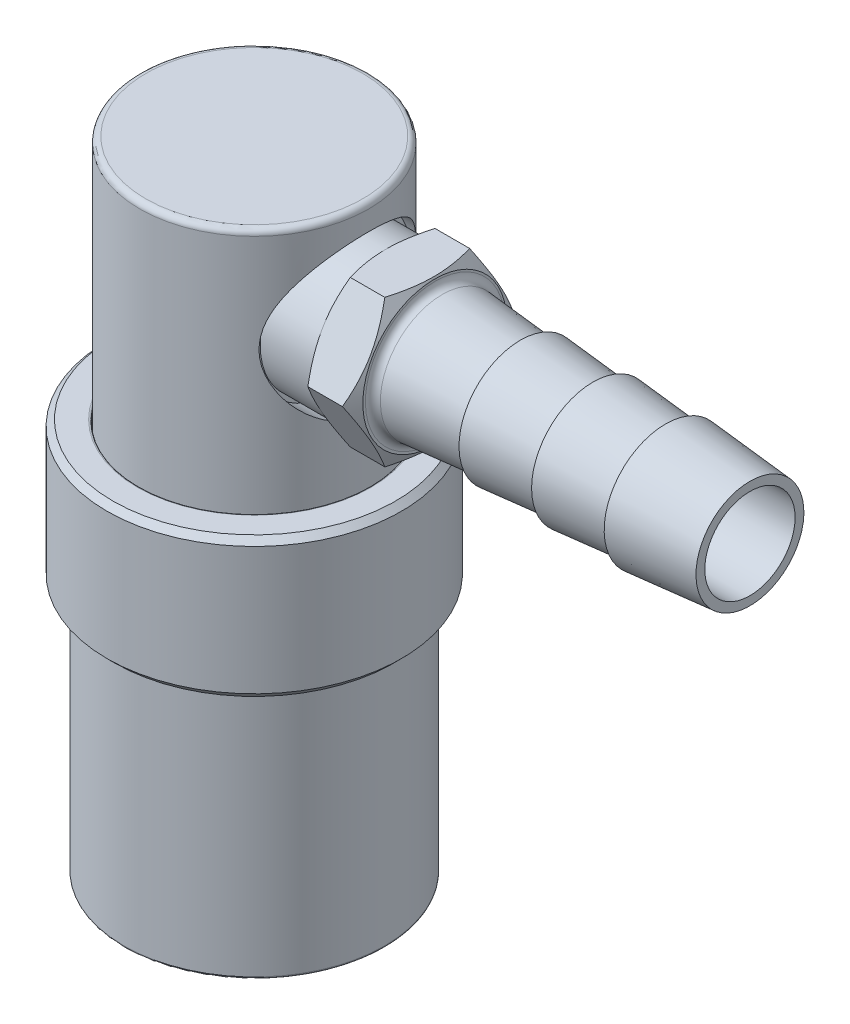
ISO-10303-21;
HEADER;
FILE_DESCRIPTION(('STEP AP214'),'2;1');
FILE_NAME('part.step','',(''),(''),'','','');
FILE_SCHEMA(('AUTOMOTIVE_DESIGN { 1 0 10303 214 1 1 1 1 }'));
ENDSEC;
DATA;
#1=APPLICATION_CONTEXT('core data for automotive mechanical design processes');
#2=APPLICATION_PROTOCOL_DEFINITION('international standard','automotive_design',2000,#1);
#3=PRODUCT_CONTEXT('',#1,'mechanical');
#4=PRODUCT('Part','Part','',(#3));
#5=PRODUCT_RELATED_PRODUCT_CATEGORY('part','',(#4));
#6=PRODUCT_DEFINITION_FORMATION('','',#4);
#7=PRODUCT_DEFINITION_CONTEXT('part definition',#1,'design');
#8=PRODUCT_DEFINITION('design','',#6,#7);
#9=PRODUCT_DEFINITION_SHAPE('','',#8);
#10=(LENGTH_UNIT() NAMED_UNIT(*) SI_UNIT(.MILLI.,.METRE.));
#11=(NAMED_UNIT(*) PLANE_ANGLE_UNIT() SI_UNIT($,.RADIAN.));
#12=(NAMED_UNIT(*) SI_UNIT($,.STERADIAN.) SOLID_ANGLE_UNIT());
#13=UNCERTAINTY_MEASURE_WITH_UNIT(LENGTH_MEASURE(1.E-05),#10,'distance_accuracy_value','');
#14=(GEOMETRIC_REPRESENTATION_CONTEXT(3) GLOBAL_UNCERTAINTY_ASSIGNED_CONTEXT((#13)) GLOBAL_UNIT_ASSIGNED_CONTEXT((#10,
#11,#12)) REPRESENTATION_CONTEXT('',''));
#15=CARTESIAN_POINT('',(0.,0.,0.));
#16=DIRECTION('',(0.,0.,1.));
#17=DIRECTION('',(1.,0.,0.));
#18=AXIS2_PLACEMENT_3D('',#15,#16,#17);
#19=CARTESIAN_POINT('',(12.204304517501,34.483774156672,0.));
#20=DIRECTION('',(1.,0.,0.));
#21=DIRECTION('',(0.,1.,0.));
#22=AXIS2_PLACEMENT_3D('',#19,#20,#21);
#23=TOROIDAL_SURFACE('',#22,4.50614882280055,0.508);
#24=CARTESIAN_POINT('',(11.696304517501,34.483774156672,0.));
#25=DIRECTION('',(1.,0.,0.));
#26=DIRECTION('',(0.,1.,0.));
#27=AXIS2_PLACEMENT_3D('',#24,#25,#26);
#28=CIRCLE('',#27,4.50614882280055);
#29=CARTESIAN_POINT('',(11.696304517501,38.9899229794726,0.));
#30=VERTEX_POINT('',#29);
#31=EDGE_CURVE('P0_E261',#30,#30,#28,.T.);
#32=ORIENTED_EDGE('',*,*,#31,.T.);
#33=EDGE_LOOP('',(#32));
#34=FACE_BOUND('',#33,.T.);
#35=CARTESIAN_POINT('',(12.160029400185,34.483774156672,0.));
#36=DIRECTION('',(1.,0.,0.));
#37=DIRECTION('',(0.,1.,0.));
#38=AXIS2_PLACEMENT_3D('',#35,#36,#37);
#39=CIRCLE('',#38,4.00008191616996);
#40=CARTESIAN_POINT('',(12.160029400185,38.483856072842,0.));
#41=VERTEX_POINT('',#40);
#42=EDGE_CURVE('P0_E550',#41,#41,#39,.T.);
#43=ORIENTED_EDGE('',*,*,#42,.F.);
#44=EDGE_LOOP('',(#43));
#45=FACE_BOUND('',#44,.T.);
#46=ADVANCED_FACE('P0_F16',(#34,#45),#23,.F.);
#47=CARTESIAN_POINT('',(17.2146712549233,34.483774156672,0.));
#48=DIRECTION('',(-1.,0.,0.));
#49=DIRECTION('',(0.,-1.,0.));
#50=AXIS2_PLACEMENT_3D('',#47,#48,#49);
#51=CONICAL_SURFACE('',#50,3.55785805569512,0.0872664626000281);
#52=ORIENTED_EDGE('',*,*,#42,.T.);
#53=EDGE_LOOP('',(#52));
#54=FACE_BOUND('',#53,.T.);
#55=CARTESIAN_POINT('',(17.2146712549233,34.483774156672,0.));
#56=DIRECTION('',(1.,0.,0.));
#57=DIRECTION('',(0.,1.,0.));
#58=AXIS2_PLACEMENT_3D('',#55,#56,#57);
#59=CIRCLE('',#58,3.55785805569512);
#60=CARTESIAN_POINT('',(17.2146712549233,38.0416322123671,0.));
#61=VERTEX_POINT('',#60);
#62=EDGE_CURVE('P0_E544',#61,#61,#59,.T.);
#63=ORIENTED_EDGE('',*,*,#62,.F.);
#64=EDGE_LOOP('',(#63));
#65=FACE_BOUND('',#64,.T.);
#66=ADVANCED_FACE('P0_F319',(#54,#65),#51,.T.);
#67=CARTESIAN_POINT('',(17.2146712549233,38.4524234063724,0.));
#68=DIRECTION('',(-1.,0.,0.));
#69=DIRECTION('',(0.,-1.,0.));
#70=AXIS2_PLACEMENT_3D('',#67,#68,#69);
#71=PLANE('',#70);
#72=ORIENTED_EDGE('',*,*,#62,.T.);
#73=EDGE_LOOP('',(#72));
#74=FACE_BOUND('',#73,.T.);
#75=CARTESIAN_POINT('',(17.2146712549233,34.483774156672,0.));
#76=DIRECTION('',(1.,0.,0.));
#77=DIRECTION('',(0.,1.,0.));
#78=AXIS2_PLACEMENT_3D('',#75,#76,#77);
#79=CIRCLE('',#78,3.96864924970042);
#80=CARTESIAN_POINT('',(17.2146712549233,38.4524234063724,0.));
#81=VERTEX_POINT('',#80);
#82=EDGE_CURVE('P0_E547',#81,#81,#79,.T.);
#83=ORIENTED_EDGE('',*,*,#82,.F.);
#84=EDGE_LOOP('',(#83));
#85=FACE_BOUND('',#84,.T.);
#86=ADVANCED_FACE('P0_F325',(#74,#85),#71,.T.);
#87=CARTESIAN_POINT('',(21.9100360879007,34.483774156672,0.));
#88=DIRECTION('',(-1.,0.,0.));
#89=DIRECTION('',(0.,-1.,0.));
#90=AXIS2_PLACEMENT_3D('',#87,#88,#89);
#91=CONICAL_SURFACE('',#90,3.55785805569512,0.0872664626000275);
#92=ORIENTED_EDGE('',*,*,#82,.T.);
#93=EDGE_LOOP('',(#92));
#94=FACE_BOUND('',#93,.T.);
#95=CARTESIAN_POINT('',(21.9100360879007,34.483774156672,0.));
#96=DIRECTION('',(1.,0.,0.));
#97=DIRECTION('',(0.,1.,0.));
#98=AXIS2_PLACEMENT_3D('',#95,#96,#97);
#99=CIRCLE('',#98,3.55785805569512);
#100=CARTESIAN_POINT('',(21.9100360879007,38.0416322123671,0.));
#101=VERTEX_POINT('',#100);
#102=EDGE_CURVE('P0_E548',#101,#101,#99,.T.);
#103=ORIENTED_EDGE('',*,*,#102,.F.);
#104=EDGE_LOOP('',(#103));
#105=FACE_BOUND('',#104,.T.);
#106=ADVANCED_FACE('P0_F424',(#94,#105),#91,.T.);
#107=CARTESIAN_POINT('',(21.9100360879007,38.452524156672,0.));
#108=DIRECTION('',(-1.,0.,0.));
#109=DIRECTION('',(0.,-1.,0.));
#110=AXIS2_PLACEMENT_3D('',#107,#108,#109);
#111=PLANE('',#110);
#112=ORIENTED_EDGE('',*,*,#102,.T.);
#113=EDGE_LOOP('',(#112));
#114=FACE_BOUND('',#113,.T.);
#115=CARTESIAN_POINT('',(21.9100360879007,34.483774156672,0.));
#116=DIRECTION('',(1.,0.,0.));
#117=DIRECTION('',(0.,1.,0.));
#118=AXIS2_PLACEMENT_3D('',#115,#116,#117);
#119=CIRCLE('',#118,3.96875);
#120=CARTESIAN_POINT('',(21.9100360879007,38.452524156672,0.));
#121=VERTEX_POINT('',#120);
#122=EDGE_CURVE('P0_E553',#121,#121,#119,.T.);
#123=ORIENTED_EDGE('',*,*,#122,.F.);
#124=EDGE_LOOP('',(#123));
#125=FACE_BOUND('',#124,.T.);
#126=ADVANCED_FACE('P0_F414',(#114,#125),#111,.T.);
#127=CARTESIAN_POINT('',(26.6065525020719,34.483774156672,0.));
#128=DIRECTION('',(-1.,0.,0.));
#129=DIRECTION('',(0.,-1.,0.));
#130=AXIS2_PLACEMENT_3D('',#127,#128,#129);
#131=CONICAL_SURFACE('',#130,3.55785805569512,0.0872664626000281);
#132=ORIENTED_EDGE('',*,*,#122,.T.);
#133=EDGE_LOOP('',(#132));
#134=FACE_BOUND('',#133,.T.);
#135=CARTESIAN_POINT('',(26.6065525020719,34.483774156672,0.));
#136=DIRECTION('',(-1.,0.,0.));
#137=DIRECTION('',(0.,0.,1.));
#138=AXIS2_PLACEMENT_3D('',#135,#136,#137);
#139=CIRCLE('',#138,3.55785805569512);
#140=CARTESIAN_POINT('',(26.6065525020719,34.483774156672,3.55785805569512));
#141=VERTEX_POINT('',#140);
#142=EDGE_CURVE('P0_E11',#141,#141,#139,.T.);
#143=ORIENTED_EDGE('',*,*,#142,.T.);
#144=EDGE_LOOP('',(#143));
#145=FACE_BOUND('',#144,.T.);
#146=ADVANCED_FACE('P0_F334',(#134,#145),#131,.T.);
#147=CARTESIAN_POINT('',(26.6065525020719,34.483774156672,-3.15011381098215));
#148=DIRECTION('',(-1.,0.,0.));
#149=DIRECTION('',(0.,0.,-1.));
#150=AXIS2_PLACEMENT_3D('',#147,#148,#149);
#151=PLANE('',#150);
#152=ORIENTED_EDGE('',*,*,#142,.F.);
#153=EDGE_LOOP('',(#152));
#154=FACE_BOUND('',#153,.T.);
#155=CARTESIAN_POINT('',(26.6065525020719,34.483774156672,0.));
#156=DIRECTION('',(1.,0.,0.));
#157=DIRECTION('',(0.,1.,0.));
#158=AXIS2_PLACEMENT_3D('',#155,#156,#157);
#159=CIRCLE('',#158,3.96875);
#160=CARTESIAN_POINT('',(26.6065525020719,38.452524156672,0.));
#161=VERTEX_POINT('',#160);
#162=EDGE_CURVE('P0_E564',#161,#161,#159,.T.);
#163=ORIENTED_EDGE('',*,*,#162,.F.);
#164=EDGE_LOOP('',(#163));
#165=FACE_BOUND('',#164,.T.);
#166=ADVANCED_FACE('P0_F313',(#154,#165),#151,.T.);
#167=CARTESIAN_POINT('',(11.696304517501,34.483774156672,-5.94411381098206));
#168=DIRECTION('',(1.,0.,0.));
#169=DIRECTION('',(0.,-1.,0.));
#170=AXIS2_PLACEMENT_3D('',#167,#168,#169);
#171=PLANE('',#170);
#172=ORIENTED_EDGE('',*,*,#31,.F.);
#173=EDGE_LOOP('',(#172));
#174=FACE_BOUND('',#173,.T.);
#175=CARTESIAN_POINT('',(11.696304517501,34.483774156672,0.0248861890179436));
#176=DIRECTION('',(-1.,0.,0.));
#177=DIRECTION('',(0.,0.,1.));
#178=AXIS2_PLACEMENT_3D('',#175,#176,#177);
#179=CIRCLE('',#178,4.64917728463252);
#180=CARTESIAN_POINT('',(11.696304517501,34.483774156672,-4.62429109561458));
#181=VERTEX_POINT('',#180);
#182=EDGE_CURVE('P0_E36',#181,#181,#179,.T.);
#183=ORIENTED_EDGE('',*,*,#182,.F.);
#184=EDGE_LOOP('',(#183));
#185=FACE_BOUND('',#184,.T.);
#186=ADVANCED_FACE('P0_F304',(#174,#185),#171,.T.);
#187=CARTESIAN_POINT('',(2.17130451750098,34.483774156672,-2.553213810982));
#188=DIRECTION('',(-1.,0.,0.));
#189=DIRECTION('',(0.,0.,-1.));
#190=AXIS2_PLACEMENT_3D('',#187,#188,#189);
#191=PLANE('',#190);
#192=CARTESIAN_POINT('',(2.171304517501,34.483774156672,1.79375057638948E-13));
#193=DIRECTION('',(-1.,0.,0.));
#194=DIRECTION('',(0.,0.,1.));
#195=AXIS2_PLACEMENT_3D('',#192,#193,#194);
#196=CIRCLE('',#195,2.921);
#197=CARTESIAN_POINT('',(2.17130451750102,34.483774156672,2.92100000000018));
#198=VERTEX_POINT('',#197);
#199=EDGE_CURVE('P0_E570',#198,#198,#196,.T.);
#200=ORIENTED_EDGE('',*,*,#199,.F.);
#201=EDGE_LOOP('',(#200));
#202=FACE_BOUND('',#201,.T.);
#203=CARTESIAN_POINT('',(2.171304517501,34.483774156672,0.0248861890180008));
#204=DIRECTION('',(1.,0.,0.));
#205=DIRECTION('',(0.,0.,1.));
#206=AXIS2_PLACEMENT_3D('',#203,#204,#205);
#207=CIRCLE('',#206,3.937);
#208=CARTESIAN_POINT('',(2.17130451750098,34.483774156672,-3.912113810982));
#209=VERTEX_POINT('',#208);
#210=EDGE_CURVE('P0_E25',#209,#209,#207,.T.);
#211=ORIENTED_EDGE('',*,*,#210,.F.);
#212=EDGE_LOOP('',(#211));
#213=FACE_BOUND('',#212,.T.);
#214=ADVANCED_FACE('P0_F302',(#202,#213),#191,.T.);
#215=CARTESIAN_POINT('',(2.552304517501,34.483774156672,0.0248861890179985));
#216=DIRECTION('',(1.,0.,0.));
#217=DIRECTION('',(0.,0.,1.));
#218=AXIS2_PLACEMENT_3D('',#215,#216,#217);
#219=CONICAL_SURFACE('',#218,4.318,0.785398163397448);
#220=ORIENTED_EDGE('',*,*,#210,.T.);
#221=DIRECTION('',(0.707106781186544,0.,-0.707106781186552));
#222=VECTOR('',#221,1.);
#223=CARTESIAN_POINT('',(2.55230451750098,34.483774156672,-4.29311381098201));
#224=LINE('',#223,#222);
#225=CARTESIAN_POINT('',(2.94092451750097,34.483774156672,-4.681733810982));
#226=VERTEX_POINT('',#225);
#227=EDGE_CURVE('P0_E172',#209,#226,#224,.T.);
#228=ORIENTED_EDGE('',*,*,#227,.T.);
#229=CARTESIAN_POINT('',(2.940924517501,34.483774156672,0.0248861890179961));
#230=DIRECTION('',(-1.,0.,0.));
#231=DIRECTION('',(0.,0.,-1.));
#232=AXIS2_PLACEMENT_3D('',#229,#230,#231);
#233=CIRCLE('',#232,4.70662);
#234=CARTESIAN_POINT('',(2.94092451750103,34.483774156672,4.731506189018));
#235=VERTEX_POINT('',#234);
#236=EDGE_CURVE('P0_E168',#226,#235,#233,.T.);
#237=ORIENTED_EDGE('',*,*,#236,.T.);
#238=CARTESIAN_POINT('',(2.940924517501,34.483774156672,0.0248861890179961));
#239=DIRECTION('',(-1.,0.,0.));
#240=DIRECTION('',(0.,0.,-1.));
#241=AXIS2_PLACEMENT_3D('',#238,#239,#240);
#242=CIRCLE('',#241,4.70662);
#243=EDGE_CURVE('P0_E173',#235,#226,#242,.T.);
#244=ORIENTED_EDGE('',*,*,#243,.T.);
#245=ORIENTED_EDGE('',*,*,#227,.F.);
#246=EDGE_LOOP('',(#220,#228,#237,#244,#245));
#247=FACE_BOUND('',#246,.T.);
#248=ADVANCED_FACE('P0_F300',(#247),#219,.T.);
#249=CARTESIAN_POINT('',(5.346304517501,34.483774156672,0.0248861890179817));
#250=DIRECTION('',(-1.,0.,0.));
#251=DIRECTION('',(0.,0.,-1.));
#252=AXIS2_PLACEMENT_3D('',#249,#250,#251);
#253=CYLINDRICAL_SURFACE('',#252,4.70662);
#254=ORIENTED_EDGE('',*,*,#243,.F.);
#255=DIRECTION('',(1.,0.,0.));
#256=VECTOR('',#255,1.);
#257=CARTESIAN_POINT('',(5.34630451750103,34.483774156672,4.73150618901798));
#258=LINE('',#257,#256);
#259=CARTESIAN_POINT('',(8.52570392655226,34.483774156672,4.73150618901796));
#260=VERTEX_POINT('',#259);
#261=EDGE_CURVE('P0_E188',#235,#260,#258,.T.);
#262=ORIENTED_EDGE('',*,*,#261,.T.);
#263=CARTESIAN_POINT('',(8.52570392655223,34.483774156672,0.0248861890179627));
#264=DIRECTION('',(-1.,0.,0.));
#265=DIRECTION('',(0.,0.,-1.));
#266=AXIS2_PLACEMENT_3D('',#263,#264,#265);
#267=CIRCLE('',#266,4.70662);
#268=CARTESIAN_POINT('',(8.5257039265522,34.483774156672,-4.68173381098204));
#269=VERTEX_POINT('',#268);
#270=EDGE_CURVE('P0_E181',#260,#269,#267,.T.);
#271=ORIENTED_EDGE('',*,*,#270,.T.);
#272=CARTESIAN_POINT('',(8.52570392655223,34.483774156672,0.0248861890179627));
#273=DIRECTION('',(-1.,0.,0.));
#274=DIRECTION('',(0.,0.,-1.));
#275=AXIS2_PLACEMENT_3D('',#272,#273,#274);
#276=CIRCLE('',#275,4.70662);
#277=EDGE_CURVE('P0_E177',#269,#260,#276,.T.);
#278=ORIENTED_EDGE('',*,*,#277,.T.);
#279=ORIENTED_EDGE('',*,*,#261,.F.);
#280=ORIENTED_EDGE('',*,*,#236,.F.);
#281=EDGE_LOOP('',(#254,#262,#271,#278,#279,#280));
#282=FACE_BOUND('',#281,.T.);
#283=ADVANCED_FACE('P0_F294',(#282),#253,.T.);
#284=CARTESIAN_POINT('',(2.17130451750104,34.483774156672,5.50948280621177));
#285=DIRECTION('',(0.,-0.5,-0.866025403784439));
#286=DIRECTION('',(-1.,0.,0.));
#287=AXIS2_PLACEMENT_3D('',#284,#285,#286);
#288=PLANE('',#287);
#289=CARTESIAN_POINT('',(11.2139749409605,39.233574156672,2.76718449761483));
#290=CARTESIAN_POINT('',(12.0056082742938,36.858674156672,4.13833365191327));
#291=CARTESIAN_POINT('',(11.2139749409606,34.483774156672,5.50948280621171));
#292=(BOUNDED_CURVE() B_SPLINE_CURVE(2,(#289,#290,#291),.UNSPECIFIED.,.F.,
.F.) B_SPLINE_CURVE_WITH_KNOTS((3,3),(0.0756877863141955,0.66089469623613),
.UNSPECIFIED.) CURVE() GEOMETRIC_REPRESENTATION_ITEM() RATIONAL_B_SPLINE_CURVE((1.0473309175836,
1.20935357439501,1.0473309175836)) REPRESENTATION_ITEM(''));
#293=CARTESIAN_POINT('',(11.2139749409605,39.233574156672,2.76718449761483));
#294=VERTEX_POINT('',#293);
#295=CARTESIAN_POINT('',(11.2139749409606,34.483774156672,5.50948280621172));
#296=VERTEX_POINT('',#295);
#297=EDGE_CURVE('P0_E125',#294,#296,#292,.T.);
#298=ORIENTED_EDGE('',*,*,#297,.F.);
#299=DIRECTION('',(1.,0.,0.));
#300=VECTOR('',#299,1.);
#301=CARTESIAN_POINT('',(2.17130451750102,39.233574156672,2.76718449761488));
#302=LINE('',#301,#300);
#303=CARTESIAN_POINT('',(8.9748689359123,39.233574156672,2.76718449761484));
#304=VERTEX_POINT('',#303);
#305=EDGE_CURVE('P0_E218',#304,#294,#302,.T.);
#306=ORIENTED_EDGE('',*,*,#305,.F.);
#307=CARTESIAN_POINT('',(8.97486893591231,34.483774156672,5.50948280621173));
#308=CARTESIAN_POINT('',(8.18323560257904,36.858674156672,4.13833365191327));
#309=CARTESIAN_POINT('',(8.97486893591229,39.233574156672,2.76718449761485));
#310=(BOUNDED_CURVE() B_SPLINE_CURVE(2,(#307,#308,#309),.UNSPECIFIED.,.F.,
.F.) B_SPLINE_CURVE_WITH_KNOTS((3,3),(0.0756877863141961,0.660894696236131),
.UNSPECIFIED.) CURVE() GEOMETRIC_REPRESENTATION_ITEM() RATIONAL_B_SPLINE_CURVE((1.0473309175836,
1.20935357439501,1.0473309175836)) REPRESENTATION_ITEM(''));
#311=CARTESIAN_POINT('',(8.97486893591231,34.483774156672,5.50948280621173));
#312=VERTEX_POINT('',#311);
#313=EDGE_CURVE('P0_E95',#312,#304,#310,.T.);
#314=ORIENTED_EDGE('',*,*,#313,.F.);
#315=DIRECTION('',(1.,0.,0.));
#316=VECTOR('',#315,1.);
#317=CARTESIAN_POINT('',(2.17130451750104,34.483774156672,5.50948280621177));
#318=LINE('',#317,#316);
#319=EDGE_CURVE('P0_E89',#312,#296,#318,.T.);
#320=ORIENTED_EDGE('',*,*,#319,.T.);
#321=EDGE_LOOP('',(#298,#306,#314,#320));
#322=FACE_BOUND('',#321,.T.);
#323=ADVANCED_FACE('P0_F276',(#322),#288,.F.);
#324=CARTESIAN_POINT('',(2.17130451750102,29.733974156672,2.76718449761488));
#325=DIRECTION('',(0.,0.5,-0.866025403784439));
#326=DIRECTION('',(0.,0.866025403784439,0.5));
#327=AXIS2_PLACEMENT_3D('',#324,#325,#326);
#328=PLANE('',#327);
#329=CARTESIAN_POINT('',(11.2139749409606,34.483774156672,5.50948280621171));
#330=CARTESIAN_POINT('',(12.0056082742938,32.108874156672,4.13833365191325));
#331=CARTESIAN_POINT('',(11.2139749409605,29.733974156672,2.76718449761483));
#332=(BOUNDED_CURVE() B_SPLINE_CURVE(2,(#329,#330,#331),.UNSPECIFIED.,.F.,
.F.) B_SPLINE_CURVE_WITH_KNOTS((3,3),(0.0756877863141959,0.66089469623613),
.UNSPECIFIED.) CURVE() GEOMETRIC_REPRESENTATION_ITEM() RATIONAL_B_SPLINE_CURVE((1.0473309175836,
1.20935357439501,1.0473309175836)) REPRESENTATION_ITEM(''));
#333=CARTESIAN_POINT('',(11.2139749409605,29.733974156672,2.76718449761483));
#334=VERTEX_POINT('',#333);
#335=EDGE_CURVE('P0_E153',#296,#334,#332,.T.);
#336=ORIENTED_EDGE('',*,*,#335,.F.);
#337=ORIENTED_EDGE('',*,*,#319,.F.);
#338=CARTESIAN_POINT('',(8.97486893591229,29.733974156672,2.76718449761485));
#339=CARTESIAN_POINT('',(8.18323560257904,32.108874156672,4.13833365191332));
#340=CARTESIAN_POINT('',(8.97486893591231,34.483774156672,5.50948280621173));
#341=(BOUNDED_CURVE() B_SPLINE_CURVE(2,(#338,#339,#340),.UNSPECIFIED.,.F.,
.F.) B_SPLINE_CURVE_WITH_KNOTS((3,3),(0.0756877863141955,0.66089469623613),
.UNSPECIFIED.) CURVE() GEOMETRIC_REPRESENTATION_ITEM() RATIONAL_B_SPLINE_CURVE((1.0473309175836,
1.20935357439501,1.0473309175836)) REPRESENTATION_ITEM(''));
#342=CARTESIAN_POINT('',(8.9748689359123,29.733974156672,2.76718449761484));
#343=VERTEX_POINT('',#342);
#344=EDGE_CURVE('P0_E82',#343,#312,#341,.T.);
#345=ORIENTED_EDGE('',*,*,#344,.F.);
#346=DIRECTION('',(1.,0.,0.));
#347=VECTOR('',#346,1.);
#348=CARTESIAN_POINT('',(2.17130451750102,29.733974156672,2.76718449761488));
#349=LINE('',#348,#347);
#350=EDGE_CURVE('P0_E86',#343,#334,#349,.T.);
#351=ORIENTED_EDGE('',*,*,#350,.T.);
#352=EDGE_LOOP('',(#336,#337,#345,#351));
#353=FACE_BOUND('',#352,.T.);
#354=ADVANCED_FACE('P0_F85',(#353),#328,.F.);
#355=CARTESIAN_POINT('',(2.17130451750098,29.733974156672,-2.71741211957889));
#356=DIRECTION('',(0.,1.,0.));
#357=DIRECTION('',(1.,0.,0.));
#358=AXIS2_PLACEMENT_3D('',#355,#356,#357);
#359=PLANE('',#358);
#360=CARTESIAN_POINT('',(11.2139749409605,29.733974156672,2.76718449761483));
#361=CARTESIAN_POINT('',(12.0056082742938,29.733974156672,0.0248861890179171));
#362=CARTESIAN_POINT('',(11.2139749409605,29.733974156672,-2.71741211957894));
#363=(BOUNDED_CURVE() B_SPLINE_CURVE(2,(#360,#361,#362),.UNSPECIFIED.,.F.,
.F.) B_SPLINE_CURVE_WITH_KNOTS((3,3),(0.0756877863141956,0.66089469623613),
.UNSPECIFIED.) CURVE() GEOMETRIC_REPRESENTATION_ITEM() RATIONAL_B_SPLINE_CURVE((1.0473309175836,
1.20935357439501,1.0473309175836)) REPRESENTATION_ITEM(''));
#364=CARTESIAN_POINT('',(11.2139749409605,29.733974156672,-2.71741211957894));
#365=VERTEX_POINT('',#364);
#366=EDGE_CURVE('P0_E103',#334,#365,#363,.T.);
#367=ORIENTED_EDGE('',*,*,#366,.F.);
#368=ORIENTED_EDGE('',*,*,#350,.F.);
#369=CARTESIAN_POINT('',(8.97486893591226,29.733974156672,-2.71741211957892));
#370=CARTESIAN_POINT('',(8.18323560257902,29.733974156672,0.0248861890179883));
#371=CARTESIAN_POINT('',(8.97486893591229,29.733974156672,2.76718449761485));
#372=(BOUNDED_CURVE() B_SPLINE_CURVE(2,(#369,#370,#371),.UNSPECIFIED.,.F.,
.F.) B_SPLINE_CURVE_WITH_KNOTS((3,3),(0.0756877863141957,0.660894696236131),
.UNSPECIFIED.) CURVE() GEOMETRIC_REPRESENTATION_ITEM() RATIONAL_B_SPLINE_CURVE((1.0473309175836,
1.20935357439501,1.0473309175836)) REPRESENTATION_ITEM(''));
#373=CARTESIAN_POINT('',(8.97486893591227,29.733974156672,-2.71741211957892));
#374=VERTEX_POINT('',#373);
#375=EDGE_CURVE('P0_E94',#374,#343,#372,.T.);
#376=ORIENTED_EDGE('',*,*,#375,.F.);
#377=DIRECTION('',(1.,0.,0.));
#378=VECTOR('',#377,1.);
#379=CARTESIAN_POINT('',(2.17130451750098,29.733974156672,-2.71741211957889));
#380=LINE('',#379,#378);
#381=EDGE_CURVE('P0_E105',#374,#365,#380,.T.);
#382=ORIENTED_EDGE('',*,*,#381,.T.);
#383=EDGE_LOOP('',(#367,#368,#376,#382));
#384=FACE_BOUND('',#383,.T.);
#385=ADVANCED_FACE('P0_F99',(#384),#359,.F.);
#386=CARTESIAN_POINT('',(2.17130451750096,34.483774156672,-5.45971042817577));
#387=DIRECTION('',(0.,0.5,0.866025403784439));
#388=DIRECTION('',(1.,0.,0.));
#389=AXIS2_PLACEMENT_3D('',#386,#387,#388);
#390=PLANE('',#389);
#391=CARTESIAN_POINT('',(11.2139749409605,29.733974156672,-2.71741211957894));
#392=CARTESIAN_POINT('',(12.0056082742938,32.108874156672,-4.08856127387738));
#393=CARTESIAN_POINT('',(11.2139749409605,34.483774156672,-5.45971042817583));
#394=(BOUNDED_CURVE() B_SPLINE_CURVE(2,(#391,#392,#393),.UNSPECIFIED.,.F.,
.F.) B_SPLINE_CURVE_WITH_KNOTS((3,3),(0.0756877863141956,0.66089469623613),
.UNSPECIFIED.) CURVE() GEOMETRIC_REPRESENTATION_ITEM() RATIONAL_B_SPLINE_CURVE((1.0473309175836,
1.20935357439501,1.0473309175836)) REPRESENTATION_ITEM(''));
#395=CARTESIAN_POINT('',(11.2139749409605,34.483774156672,-5.45971042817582));
#396=VERTEX_POINT('',#395);
#397=EDGE_CURVE('P0_E145',#365,#396,#394,.T.);
#398=ORIENTED_EDGE('',*,*,#397,.F.);
#399=ORIENTED_EDGE('',*,*,#381,.F.);
#400=CARTESIAN_POINT('',(8.97486893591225,34.483774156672,-5.45971042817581));
#401=CARTESIAN_POINT('',(8.18323560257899,32.108874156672,-4.08856127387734));
#402=CARTESIAN_POINT('',(8.97486893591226,29.733974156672,-2.71741211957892));
#403=(BOUNDED_CURVE() B_SPLINE_CURVE(2,(#400,#401,#402),.UNSPECIFIED.,.F.,
.F.) B_SPLINE_CURVE_WITH_KNOTS((3,3),(0.075687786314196,0.66089469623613),
.UNSPECIFIED.) CURVE() GEOMETRIC_REPRESENTATION_ITEM() RATIONAL_B_SPLINE_CURVE((1.0473309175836,
1.20935357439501,1.0473309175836)) REPRESENTATION_ITEM(''));
#404=CARTESIAN_POINT('',(8.97486893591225,34.483774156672,-5.45971042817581));
#405=VERTEX_POINT('',#404);
#406=EDGE_CURVE('P0_E112',#405,#374,#403,.T.);
#407=ORIENTED_EDGE('',*,*,#406,.F.);
#408=DIRECTION('',(1.,0.,0.));
#409=VECTOR('',#408,1.);
#410=CARTESIAN_POINT('',(2.17130451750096,34.483774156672,-5.45971042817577));
#411=LINE('',#410,#409);
#412=EDGE_CURVE('P0_E146',#405,#396,#411,.T.);
#413=ORIENTED_EDGE('',*,*,#412,.T.);
#414=EDGE_LOOP('',(#398,#399,#407,#413));
#415=FACE_BOUND('',#414,.T.);
#416=ADVANCED_FACE('P0_F214',(#415),#390,.F.);
#417=CARTESIAN_POINT('',(2.17130451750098,39.233574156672,-2.71741211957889));
#418=DIRECTION('',(0.,-0.5,0.866025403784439));
#419=DIRECTION('',(-1.,0.,0.));
#420=AXIS2_PLACEMENT_3D('',#417,#418,#419);
#421=PLANE('',#420);
#422=CARTESIAN_POINT('',(11.2139749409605,34.483774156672,-5.45971042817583));
#423=CARTESIAN_POINT('',(12.0056082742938,36.858674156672,-4.08856127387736));
#424=CARTESIAN_POINT('',(11.2139749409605,39.233574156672,-2.71741211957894));
#425=(BOUNDED_CURVE() B_SPLINE_CURVE(2,(#422,#423,#424),.UNSPECIFIED.,.F.,
.F.) B_SPLINE_CURVE_WITH_KNOTS((3,3),(0.0756877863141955,0.66089469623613),
.UNSPECIFIED.) CURVE() GEOMETRIC_REPRESENTATION_ITEM() RATIONAL_B_SPLINE_CURVE((1.0473309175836,
1.20935357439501,1.0473309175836)) REPRESENTATION_ITEM(''));
#426=CARTESIAN_POINT('',(11.2139749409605,39.233574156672,-2.71741211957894));
#427=VERTEX_POINT('',#426);
#428=EDGE_CURVE('P0_E137',#396,#427,#425,.T.);
#429=ORIENTED_EDGE('',*,*,#428,.F.);
#430=ORIENTED_EDGE('',*,*,#412,.F.);
#431=CARTESIAN_POINT('',(8.97486893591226,39.233574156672,-2.71741211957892));
#432=CARTESIAN_POINT('',(8.18323560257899,36.858674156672,-4.08856127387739));
#433=CARTESIAN_POINT('',(8.97486893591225,34.483774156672,-5.45971042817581));
#434=(BOUNDED_CURVE() B_SPLINE_CURVE(2,(#431,#432,#433),.UNSPECIFIED.,.F.,
.F.) B_SPLINE_CURVE_WITH_KNOTS((3,3),(0.0756877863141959,0.66089469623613),
.UNSPECIFIED.) CURVE() GEOMETRIC_REPRESENTATION_ITEM() RATIONAL_B_SPLINE_CURVE((1.0473309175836,
1.20935357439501,1.0473309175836)) REPRESENTATION_ITEM(''));
#435=CARTESIAN_POINT('',(8.97486893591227,39.233574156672,-2.71741211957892));
#436=VERTEX_POINT('',#435);
#437=EDGE_CURVE('P0_E256',#436,#405,#434,.T.);
#438=ORIENTED_EDGE('',*,*,#437,.F.);
#439=DIRECTION('',(1.,0.,0.));
#440=VECTOR('',#439,1.);
#441=CARTESIAN_POINT('',(2.17130451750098,39.233574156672,-2.71741211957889));
#442=LINE('',#441,#440);
#443=EDGE_CURVE('P0_E150',#436,#427,#442,.T.);
#444=ORIENTED_EDGE('',*,*,#443,.T.);
#445=EDGE_LOOP('',(#429,#430,#438,#444));
#446=FACE_BOUND('',#445,.T.);
#447=ADVANCED_FACE('P0_F18',(#446),#421,.F.);
#448=CARTESIAN_POINT('',(2.17130451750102,39.233574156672,2.76718449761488));
#449=DIRECTION('',(0.,-1.,0.));
#450=DIRECTION('',(1.,0.,0.));
#451=AXIS2_PLACEMENT_3D('',#448,#449,#450);
#452=PLANE('',#451);
#453=CARTESIAN_POINT('',(11.2139749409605,39.233574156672,-2.71741211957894));
#454=CARTESIAN_POINT('',(12.0056082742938,39.233574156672,0.0248861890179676));
#455=CARTESIAN_POINT('',(11.2139749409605,39.233574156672,2.76718449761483));
#456=(BOUNDED_CURVE() B_SPLINE_CURVE(2,(#453,#454,#455),.UNSPECIFIED.,.F.,
.F.) B_SPLINE_CURVE_WITH_KNOTS((3,3),(0.0756877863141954,0.66089469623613),
.UNSPECIFIED.) CURVE() GEOMETRIC_REPRESENTATION_ITEM() RATIONAL_B_SPLINE_CURVE((1.0473309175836,
1.20935357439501,1.0473309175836)) REPRESENTATION_ITEM(''));
#457=EDGE_CURVE('P0_E129',#427,#294,#456,.T.);
#458=ORIENTED_EDGE('',*,*,#457,.F.);
#459=ORIENTED_EDGE('',*,*,#443,.F.);
#460=CARTESIAN_POINT('',(8.97486893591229,39.233574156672,2.76718449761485));
#461=CARTESIAN_POINT('',(8.18323560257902,39.233574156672,0.0248861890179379));
#462=CARTESIAN_POINT('',(8.97486893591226,39.233574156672,-2.71741211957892));
#463=(BOUNDED_CURVE() B_SPLINE_CURVE(2,(#460,#461,#462),.UNSPECIFIED.,.F.,
.F.) B_SPLINE_CURVE_WITH_KNOTS((3,3),(0.0756877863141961,0.660894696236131),
.UNSPECIFIED.) CURVE() GEOMETRIC_REPRESENTATION_ITEM() RATIONAL_B_SPLINE_CURVE((1.0473309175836,
1.20935357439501,1.0473309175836)) REPRESENTATION_ITEM(''));
#464=EDGE_CURVE('P0_E192',#304,#436,#463,.T.);
#465=ORIENTED_EDGE('',*,*,#464,.F.);
#466=ORIENTED_EDGE('',*,*,#305,.T.);
#467=EDGE_LOOP('',(#458,#459,#465,#466));
#468=FACE_BOUND('',#467,.T.);
#469=ADVANCED_FACE('P0_F348',(#468),#452,.F.);
#470=CARTESIAN_POINT('',(11.315304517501,34.483774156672,0.0248861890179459));
#471=DIRECTION('',(-1.,0.,0.));
#472=DIRECTION('',(0.,0.,1.));
#473=AXIS2_PLACEMENT_3D('',#470,#471,#472);
#474=CONICAL_SURFACE('',#473,5.30908864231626,1.0471975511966);
#475=ORIENTED_EDGE('',*,*,#397,.T.);
#476=DIRECTION('',(0.5,0.,0.866025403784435));
#477=VECTOR('',#476,1.);
#478=CARTESIAN_POINT('',(11.315304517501,34.483774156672,-5.28420245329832));
#479=LINE('',#478,#477);
#480=EDGE_CURVE('P0_E138',#396,#181,#479,.T.);
#481=ORIENTED_EDGE('',*,*,#480,.T.);
#482=ORIENTED_EDGE('',*,*,#182,.T.);
#483=ORIENTED_EDGE('',*,*,#480,.F.);
#484=ORIENTED_EDGE('',*,*,#428,.T.);
#485=ORIENTED_EDGE('',*,*,#457,.T.);
#486=ORIENTED_EDGE('',*,*,#297,.T.);
#487=ORIENTED_EDGE('',*,*,#335,.T.);
#488=ORIENTED_EDGE('',*,*,#366,.T.);
#489=EDGE_LOOP('',(#475,#481,#482,#483,#484,#485,#486,#487,#488));
#490=FACE_BOUND('',#489,.T.);
#491=ADVANCED_FACE('P0_F207',(#490),#474,.T.);
#492=CARTESIAN_POINT('',(8.88792193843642,34.483774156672,0.0248861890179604));
#493=DIRECTION('',(1.,0.,0.));
#494=DIRECTION('',(0.,0.,1.));
#495=AXIS2_PLACEMENT_3D('',#492,#493,#494);
#496=CONICAL_SURFACE('',#495,5.334,1.0471975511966);
#497=ORIENTED_EDGE('',*,*,#270,.F.);
#498=ORIENTED_EDGE('',*,*,#277,.F.);
#499=DIRECTION('',(0.5,0.,-0.866025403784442));
#500=VECTOR('',#499,1.);
#501=CARTESIAN_POINT('',(8.88792193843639,34.483774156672,-5.30911381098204));
#502=LINE('',#501,#500);
#503=EDGE_CURVE('P0_E119',#269,#405,#502,.T.);
#504=ORIENTED_EDGE('',*,*,#503,.T.);
#505=ORIENTED_EDGE('',*,*,#406,.T.);
#506=ORIENTED_EDGE('',*,*,#375,.T.);
#507=ORIENTED_EDGE('',*,*,#344,.T.);
#508=ORIENTED_EDGE('',*,*,#313,.T.);
#509=ORIENTED_EDGE('',*,*,#464,.T.);
#510=ORIENTED_EDGE('',*,*,#437,.T.);
#511=ORIENTED_EDGE('',*,*,#503,.F.);
#512=EDGE_LOOP('',(#497,#498,#504,#505,#506,#507,#508,#509,#510,#511));
#513=FACE_BOUND('',#512,.T.);
#514=ADVANCED_FACE('P0_F109',(#513),#496,.T.);
#515=CARTESIAN_POINT('',(32.0671474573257,34.483774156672,0.));
#516=DIRECTION('',(-1.,0.,0.));
#517=DIRECTION('',(0.,-1.,0.));
#518=AXIS2_PLACEMENT_3D('',#515,#516,#517);
#519=CONICAL_SURFACE('',#518,3.49100984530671,0.0872664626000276);
#520=ORIENTED_EDGE('',*,*,#162,.T.);
#521=EDGE_LOOP('',(#520));
#522=FACE_BOUND('',#521,.T.);
#523=CARTESIAN_POINT('',(32.0671474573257,34.483774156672,0.));
#524=DIRECTION('',(1.,0.,0.));
#525=DIRECTION('',(0.,1.,0.));
#526=AXIS2_PLACEMENT_3D('',#523,#524,#525);
#527=CIRCLE('',#526,3.49100984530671);
#528=CARTESIAN_POINT('',(32.0671474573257,37.9747840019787,0.));
#529=VERTEX_POINT('',#528);
#530=EDGE_CURVE('P0_E567',#529,#529,#527,.T.);
#531=ORIENTED_EDGE('',*,*,#530,.F.);
#532=EDGE_LOOP('',(#531));
#533=FACE_BOUND('',#532,.T.);
#534=ADVANCED_FACE('P0_F344',(#522,#533),#519,.T.);
#535=CARTESIAN_POINT('',(32.0671474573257,34.483774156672,-3.26955306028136));
#536=DIRECTION('',(1.,0.,0.));
#537=DIRECTION('',(0.,-1.,0.));
#538=AXIS2_PLACEMENT_3D('',#535,#536,#537);
#539=PLANE('',#538);
#540=CARTESIAN_POINT('',(32.0671474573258,34.483774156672,0.));
#541=DIRECTION('',(1.,0.,0.));
#542=DIRECTION('',(0.,0.,-1.));
#543=AXIS2_PLACEMENT_3D('',#540,#541,#542);
#544=CIRCLE('',#543,2.921);
#545=CARTESIAN_POINT('',(32.0671474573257,34.483774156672,-2.921));
#546=VERTEX_POINT('',#545);
#547=EDGE_CURVE('P0_E573',#546,#546,#544,.T.);
#548=ORIENTED_EDGE('',*,*,#547,.F.);
#549=EDGE_LOOP('',(#548));
#550=FACE_BOUND('',#549,.T.);
#551=ORIENTED_EDGE('',*,*,#530,.T.);
#552=EDGE_LOOP('',(#551));
#553=FACE_BOUND('',#552,.T.);
#554=ADVANCED_FACE('P0_F340',(#550,#553),#539,.T.);
#555=CARTESIAN_POINT('',(0.317147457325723,34.483774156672,1.905E-13));
#556=DIRECTION('',(1.,0.,0.));
#557=DIRECTION('',(0.,0.,-1.));
#558=AXIS2_PLACEMENT_3D('',#555,#556,#557);
#559=CYLINDRICAL_SURFACE('',#558,2.921);
#560=ORIENTED_EDGE('',*,*,#199,.T.);
#561=EDGE_LOOP('',(#560));
#562=FACE_BOUND('',#561,.T.);
#563=ORIENTED_EDGE('',*,*,#547,.T.);
#564=EDGE_LOOP('',(#563));
#565=FACE_BOUND('',#564,.T.);
#566=ADVANCED_FACE('P0_F343',(#562,#565),#559,.F.);
#567=CLOSED_SHELL('',(#46,#66,#86,#106,#126,#146,#166,#186,#214,#248,#283,#323,#354,#385,#416,
#447,#469,#491,#514,#534,#554,#566));
#568=MANIFOLD_SOLID_BREP('P0_B1',#567);
#569=CARTESIAN_POINT('',(0.,8.40740008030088,4.9022));
#570=DIRECTION('',(0.,-1.,0.));
#571=DIRECTION('',(0.,0.,-1.));
#572=AXIS2_PLACEMENT_3D('',#569,#570,#571);
#573=PLANE('',#572);
#574=CARTESIAN_POINT('',(0.,8.40740008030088,0.));
#575=DIRECTION('',(0.,1.,0.));
#576=DIRECTION('',(1.,0.,0.));
#577=AXIS2_PLACEMENT_3D('',#574,#575,#576);
#578=CIRCLE('',#577,4.9022);
#579=CARTESIAN_POINT('',(0.,8.40740008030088,4.9022));
#580=VERTEX_POINT('',#579);
#581=CARTESIAN_POINT('',(0.,8.40740008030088,-4.9022));
#582=VERTEX_POINT('',#581);
#583=EDGE_CURVE('P1_E39',#580,#582,#578,.T.);
#584=ORIENTED_EDGE('',*,*,#583,.F.);
#585=CARTESIAN_POINT('',(0.,8.40740008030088,0.));
#586=DIRECTION('',(0.,1.,0.));
#587=DIRECTION('',(1.,0.,0.));
#588=AXIS2_PLACEMENT_3D('',#585,#586,#587);
#589=CIRCLE('',#588,4.9022);
#590=EDGE_CURVE('P1_E87',#582,#580,#589,.T.);
#591=ORIENTED_EDGE('',*,*,#590,.F.);
#592=EDGE_LOOP('',(#584,#591));
#593=FACE_BOUND('',#592,.T.);
#594=CARTESIAN_POINT('',(0.,8.40740008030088,0.));
#595=DIRECTION('',(0.,1.,0.));
#596=DIRECTION('',(1.,0.,0.));
#597=AXIS2_PLACEMENT_3D('',#594,#595,#596);
#598=CIRCLE('',#597,3.5052);
#599=CARTESIAN_POINT('',(0.,8.40740008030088,3.5052));
#600=VERTEX_POINT('',#599);
#601=CARTESIAN_POINT('',(0.,8.40740008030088,-3.5052));
#602=VERTEX_POINT('',#601);
#603=EDGE_CURVE('P1_E11',#600,#602,#598,.T.);
#604=ORIENTED_EDGE('',*,*,#603,.T.);
#605=CARTESIAN_POINT('',(0.,8.40740008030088,0.));
#606=DIRECTION('',(0.,1.,0.));
#607=DIRECTION('',(1.,0.,0.));
#608=AXIS2_PLACEMENT_3D('',#605,#606,#607);
#609=CIRCLE('',#608,3.5052);
#610=EDGE_CURVE('P1_E27',#602,#600,#609,.T.);
#611=ORIENTED_EDGE('',*,*,#610,.T.);
#612=EDGE_LOOP('',(#604,#611));
#613=FACE_BOUND('',#612,.T.);
#614=ADVANCED_FACE('P1_F16',(#593,#613),#573,.T.);
#615=CARTESIAN_POINT('',(0.,10.6299000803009,0.));
#616=DIRECTION('',(0.,1.,0.));
#617=DIRECTION('',(0.,0.,1.));
#618=AXIS2_PLACEMENT_3D('',#615,#616,#617);
#619=CYLINDRICAL_SURFACE('',#618,4.9022);
#620=CARTESIAN_POINT('',(0.,12.8524000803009,0.));
#621=DIRECTION('',(0.,1.,0.));
#622=DIRECTION('',(1.,0.,0.));
#623=AXIS2_PLACEMENT_3D('',#620,#621,#622);
#624=CIRCLE('',#623,4.9022);
#625=CARTESIAN_POINT('',(0.,12.8524000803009,4.9022));
#626=VERTEX_POINT('',#625);
#627=CARTESIAN_POINT('',(0.,12.8524000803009,-4.9022));
#628=VERTEX_POINT('',#627);
#629=EDGE_CURVE('P1_E20',#626,#628,#624,.T.);
#630=ORIENTED_EDGE('',*,*,#629,.F.);
#631=CARTESIAN_POINT('',(0.,12.8524000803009,0.));
#632=DIRECTION('',(0.,1.,0.));
#633=DIRECTION('',(1.,0.,0.));
#634=AXIS2_PLACEMENT_3D('',#631,#632,#633);
#635=CIRCLE('',#634,4.9022);
#636=EDGE_CURVE('P1_E63',#628,#626,#635,.T.);
#637=ORIENTED_EDGE('',*,*,#636,.F.);
#638=DIRECTION('',(0.,-1.,0.));
#639=VECTOR('',#638,1.);
#640=CARTESIAN_POINT('',(0.,10.6299000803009,-4.9022));
#641=LINE('',#640,#639);
#642=EDGE_CURVE('P1_E89',#628,#582,#641,.T.);
#643=ORIENTED_EDGE('',*,*,#642,.T.);
#644=ORIENTED_EDGE('',*,*,#590,.T.);
#645=ORIENTED_EDGE('',*,*,#583,.T.);
#646=ORIENTED_EDGE('',*,*,#642,.F.);
#647=EDGE_LOOP('',(#630,#637,#643,#644,#645,#646));
#648=FACE_BOUND('',#647,.T.);
#649=ADVANCED_FACE('P1_F104',(#648),#619,.T.);
#650=CARTESIAN_POINT('',(0.,12.8524000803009,3.5052));
#651=DIRECTION('',(0.,1.,0.));
#652=DIRECTION('',(1.,0.,0.));
#653=AXIS2_PLACEMENT_3D('',#650,#651,#652);
#654=PLANE('',#653);
#655=ORIENTED_EDGE('',*,*,#629,.T.);
#656=ORIENTED_EDGE('',*,*,#636,.T.);
#657=EDGE_LOOP('',(#655,#656));
#658=FACE_BOUND('',#657,.T.);
#659=CARTESIAN_POINT('',(0.,12.8524000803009,0.));
#660=DIRECTION('',(0.,1.,0.));
#661=DIRECTION('',(1.,0.,0.));
#662=AXIS2_PLACEMENT_3D('',#659,#660,#661);
#663=CIRCLE('',#662,3.5052);
#664=CARTESIAN_POINT('',(0.,12.8524000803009,3.5052));
#665=VERTEX_POINT('',#664);
#666=CARTESIAN_POINT('',(0.,12.8524000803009,-3.5052));
#667=VERTEX_POINT('',#666);
#668=EDGE_CURVE('P1_E70',#665,#667,#663,.T.);
#669=ORIENTED_EDGE('',*,*,#668,.F.);
#670=CARTESIAN_POINT('',(0.,12.8524000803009,0.));
#671=DIRECTION('',(0.,1.,0.));
#672=DIRECTION('',(1.,0.,0.));
#673=AXIS2_PLACEMENT_3D('',#670,#671,#672);
#674=CIRCLE('',#673,3.5052);
#675=EDGE_CURVE('P1_E73',#667,#665,#674,.T.);
#676=ORIENTED_EDGE('',*,*,#675,.F.);
#677=EDGE_LOOP('',(#669,#676));
#678=FACE_BOUND('',#677,.T.);
#679=ADVANCED_FACE('P1_F72',(#658,#678),#654,.T.);
#680=CARTESIAN_POINT('',(0.,10.6299000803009,0.));
#681=DIRECTION('',(0.,1.,0.));
#682=DIRECTION('',(0.,0.,1.));
#683=AXIS2_PLACEMENT_3D('',#680,#681,#682);
#684=CYLINDRICAL_SURFACE('',#683,3.5052);
#685=ORIENTED_EDGE('',*,*,#668,.T.);
#686=DIRECTION('',(0.,-1.,0.));
#687=VECTOR('',#686,1.);
#688=CARTESIAN_POINT('',(0.,10.6299000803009,-3.5052));
#689=LINE('',#688,#687);
#690=EDGE_CURVE('P1_E78',#667,#602,#689,.T.);
#691=ORIENTED_EDGE('',*,*,#690,.T.);
#692=ORIENTED_EDGE('',*,*,#603,.F.);
#693=ORIENTED_EDGE('',*,*,#610,.F.);
#694=ORIENTED_EDGE('',*,*,#690,.F.);
#695=ORIENTED_EDGE('',*,*,#675,.T.);
#696=EDGE_LOOP('',(#685,#691,#692,#693,#694,#695));
#697=FACE_BOUND('',#696,.T.);
#698=ADVANCED_FACE('P1_F18',(#697),#684,.F.);
#699=CLOSED_SHELL('',(#614,#649,#679,#698));
#700=MANIFOLD_SOLID_BREP('P1_B1',#699);
#701=CARTESIAN_POINT('',(0.,25.2095,0.));
#702=DIRECTION('',(0.,-1.,0.));
#703=DIRECTION('',(0.,0.,-1.));
#704=AXIS2_PLACEMENT_3D('',#701,#702,#703);
#705=CONICAL_SURFACE('',#704,9.3345,0.785398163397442);
#706=CARTESIAN_POINT('',(0.,25.4,0.));
#707=DIRECTION('',(0.,-1.,0.));
#708=DIRECTION('',(0.,0.,-1.));
#709=AXIS2_PLACEMENT_3D('',#706,#707,#708);
#710=CIRCLE('',#709,9.144);
#711=CARTESIAN_POINT('',(0.,25.4,9.144));
#712=VERTEX_POINT('',#711);
#713=EDGE_CURVE('P2_E11',#712,#712,#710,.T.);
#714=ORIENTED_EDGE('',*,*,#713,.T.);
#715=DIRECTION('',(0.,-0.707106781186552,0.707106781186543));
#716=VECTOR('',#715,1.);
#717=CARTESIAN_POINT('',(0.,25.2095,9.3345));
#718=LINE('',#717,#716);
#719=CARTESIAN_POINT('',(0.,25.019,9.525));
#720=VERTEX_POINT('',#719);
#721=EDGE_CURVE('P2_E26',#712,#720,#718,.T.);
#722=ORIENTED_EDGE('',*,*,#721,.T.);
#723=CARTESIAN_POINT('',(0.,25.019,0.));
#724=DIRECTION('',(0.,1.,0.));
#725=DIRECTION('',(0.,0.,-1.));
#726=AXIS2_PLACEMENT_3D('',#723,#724,#725);
#727=CIRCLE('',#726,9.525);
#728=CARTESIAN_POINT('',(0.,25.019,-9.525));
#729=VERTEX_POINT('',#728);
#730=EDGE_CURVE('P2_E46',#720,#729,#727,.T.);
#731=ORIENTED_EDGE('',*,*,#730,.T.);
#732=CARTESIAN_POINT('',(0.,25.019,0.));
#733=DIRECTION('',(0.,1.,0.));
#734=DIRECTION('',(0.,0.,-1.));
#735=AXIS2_PLACEMENT_3D('',#732,#733,#734);
#736=CIRCLE('',#735,9.525);
#737=EDGE_CURVE('P2_E277',#729,#720,#736,.T.);
#738=ORIENTED_EDGE('',*,*,#737,.T.);
#739=ORIENTED_EDGE('',*,*,#721,.F.);
#740=EDGE_LOOP('',(#714,#722,#731,#738,#739));
#741=FACE_BOUND('',#740,.T.);
#742=ADVANCED_FACE('P2_F16',(#741),#705,.T.);
#743=CARTESIAN_POINT('',(0.,20.828,0.));
#744=DIRECTION('',(0.,1.,0.));
#745=DIRECTION('',(0.,0.,1.));
#746=AXIS2_PLACEMENT_3D('',#743,#744,#745);
#747=CYLINDRICAL_SURFACE('',#746,9.525);
#748=ORIENTED_EDGE('',*,*,#730,.F.);
#749=ORIENTED_EDGE('',*,*,#737,.F.);
#750=DIRECTION('',(0.,-1.,0.));
#751=VECTOR('',#750,1.);
#752=CARTESIAN_POINT('',(0.,20.828,-9.525));
#753=LINE('',#752,#751);
#754=CARTESIAN_POINT('',(0.,16.764,-9.525));
#755=VERTEX_POINT('',#754);
#756=EDGE_CURVE('P2_E273',#729,#755,#753,.T.);
#757=ORIENTED_EDGE('',*,*,#756,.T.);
#758=CARTESIAN_POINT('',(0.,16.764,0.));
#759=DIRECTION('',(0.,-1.,0.));
#760=DIRECTION('',(0.,0.,-1.));
#761=AXIS2_PLACEMENT_3D('',#758,#759,#760);
#762=CIRCLE('',#761,9.525);
#763=CARTESIAN_POINT('',(0.,16.764,9.525));
#764=VERTEX_POINT('',#763);
#765=EDGE_CURVE('P2_E206',#764,#755,#762,.T.);
#766=ORIENTED_EDGE('',*,*,#765,.F.);
#767=CARTESIAN_POINT('',(0.,16.764,0.));
#768=DIRECTION('',(0.,-1.,0.));
#769=DIRECTION('',(0.,0.,-1.));
#770=AXIS2_PLACEMENT_3D('',#767,#768,#769);
#771=CIRCLE('',#770,9.525);
#772=EDGE_CURVE('P2_E209',#755,#764,#771,.T.);
#773=ORIENTED_EDGE('',*,*,#772,.F.);
#774=ORIENTED_EDGE('',*,*,#756,.F.);
#775=EDGE_LOOP('',(#748,#749,#757,#766,#773,#774));
#776=FACE_BOUND('',#775,.T.);
#777=ADVANCED_FACE('P2_F18',(#776),#747,.T.);
#778=CARTESIAN_POINT('',(0.,25.4,7.4549));
#779=DIRECTION('',(0.,1.,0.));
#780=DIRECTION('',(1.,0.,0.));
#781=AXIS2_PLACEMENT_3D('',#778,#779,#780);
#782=PLANE('',#781);
#783=ORIENTED_EDGE('',*,*,#713,.F.);
#784=EDGE_LOOP('',(#783));
#785=FACE_BOUND('',#784,.T.);
#786=CARTESIAN_POINT('',(0.,25.4,0.));
#787=DIRECTION('',(0.,1.,0.));
#788=DIRECTION('',(0.,0.,-1.));
#789=AXIS2_PLACEMENT_3D('',#786,#787,#788);
#790=CIRCLE('',#789,7.5819);
#791=CARTESIAN_POINT('',(0.,25.4,7.5819));
#792=VERTEX_POINT('',#791);
#793=CARTESIAN_POINT('',(0.,25.4,-7.5819));
#794=VERTEX_POINT('',#793);
#795=EDGE_CURVE('P2_E326',#792,#794,#790,.T.);
#796=ORIENTED_EDGE('',*,*,#795,.F.);
#797=CARTESIAN_POINT('',(0.,25.4,0.));
#798=DIRECTION('',(0.,1.,0.));
#799=DIRECTION('',(0.,0.,-1.));
#800=AXIS2_PLACEMENT_3D('',#797,#798,#799);
#801=CIRCLE('',#800,7.5819);
#802=EDGE_CURVE('P2_E241',#794,#792,#801,.T.);
#803=ORIENTED_EDGE('',*,*,#802,.F.);
#804=EDGE_LOOP('',(#796,#803));
#805=FACE_BOUND('',#804,.T.);
#806=ADVANCED_FACE('P2_F364',(#785,#805),#782,.T.);
#807=CARTESIAN_POINT('',(0.,6.096,0.));
#808=DIRECTION('',(0.,1.,0.));
#809=DIRECTION('',(0.,0.,1.));
#810=AXIS2_PLACEMENT_3D('',#807,#808,#809);
#811=TOROIDAL_SURFACE('',#810,6.6802,0.254);
#812=CARTESIAN_POINT('',(0.,6.096,0.));
#813=DIRECTION('',(0.,-1.,0.));
#814=DIRECTION('',(0.,0.,-1.));
#815=AXIS2_PLACEMENT_3D('',#812,#813,#814);
#816=CIRCLE('',#815,6.4262);
#817=CARTESIAN_POINT('',(0.,6.096,6.4262));
#818=VERTEX_POINT('',#817);
#819=CARTESIAN_POINT('',(0.,6.096,-6.4262));
#820=VERTEX_POINT('',#819);
#821=EDGE_CURVE('P2_E278',#818,#820,#816,.T.);
#822=ORIENTED_EDGE('',*,*,#821,.T.);
#823=CARTESIAN_POINT('',(0.,6.096,-6.6802));
#824=DIRECTION('',(-1.,0.,0.));
#825=DIRECTION('',(0.,0.,-1.));
#826=AXIS2_PLACEMENT_3D('',#823,#824,#825);
#827=CIRCLE('',#826,0.254);
#828=CARTESIAN_POINT('',(0.,6.35,-6.6802));
#829=VERTEX_POINT('',#828);
#830=EDGE_CURVE('P2_E188',#820,#829,#827,.T.);
#831=ORIENTED_EDGE('',*,*,#830,.T.);
#832=CARTESIAN_POINT('',(0.,6.35,0.));
#833=DIRECTION('',(0.,1.,0.));
#834=DIRECTION('',(0.,0.,-1.));
#835=AXIS2_PLACEMENT_3D('',#832,#833,#834);
#836=CIRCLE('',#835,6.6802);
#837=CARTESIAN_POINT('',(0.,6.35,6.6802));
#838=VERTEX_POINT('',#837);
#839=EDGE_CURVE('P2_E20',#829,#838,#836,.T.);
#840=ORIENTED_EDGE('',*,*,#839,.T.);
#841=CARTESIAN_POINT('',(0.,6.35,0.));
#842=DIRECTION('',(0.,1.,0.));
#843=DIRECTION('',(0.,0.,-1.));
#844=AXIS2_PLACEMENT_3D('',#841,#842,#843);
#845=CIRCLE('',#844,6.6802);
#846=EDGE_CURVE('P2_E187',#838,#829,#845,.T.);
#847=ORIENTED_EDGE('',*,*,#846,.T.);
#848=ORIENTED_EDGE('',*,*,#830,.F.);
#849=CARTESIAN_POINT('',(0.,6.096,0.));
#850=DIRECTION('',(0.,-1.,0.));
#851=DIRECTION('',(0.,0.,-1.));
#852=AXIS2_PLACEMENT_3D('',#849,#850,#851);
#853=CIRCLE('',#852,6.4262);
#854=EDGE_CURVE('P2_E193',#820,#818,#853,.T.);
#855=ORIENTED_EDGE('',*,*,#854,.T.);
#856=EDGE_LOOP('',(#822,#831,#840,#847,#848,#855));
#857=FACE_BOUND('',#856,.T.);
#858=ADVANCED_FACE('P2_F185',(#857),#811,.T.);
#859=CARTESIAN_POINT('',(0.,6.35,6.4262));
#860=DIRECTION('',(0.,1.,0.));
#861=DIRECTION('',(1.,0.,0.));
#862=AXIS2_PLACEMENT_3D('',#859,#860,#861);
#863=PLANE('',#862);
#864=CARTESIAN_POINT('',(0.,6.35,0.));
#865=DIRECTION('',(0.,-1.,0.));
#866=DIRECTION('',(0.,0.,-1.));
#867=AXIS2_PLACEMENT_3D('',#864,#865,#866);
#868=CIRCLE('',#867,7.2009);
#869=CARTESIAN_POINT('',(0.,6.35,7.2009));
#870=VERTEX_POINT('',#869);
#871=CARTESIAN_POINT('',(0.,6.35,-7.2009));
#872=VERTEX_POINT('',#871);
#873=EDGE_CURVE('P2_E260',#870,#872,#868,.T.);
#874=ORIENTED_EDGE('',*,*,#873,.F.);
#875=CARTESIAN_POINT('',(0.,6.35,0.));
#876=DIRECTION('',(0.,-1.,0.));
#877=DIRECTION('',(0.,0.,-1.));
#878=AXIS2_PLACEMENT_3D('',#875,#876,#877);
#879=CIRCLE('',#878,7.2009);
#880=EDGE_CURVE('P2_E265',#872,#870,#879,.T.);
#881=ORIENTED_EDGE('',*,*,#880,.F.);
#882=EDGE_LOOP('',(#874,#881));
#883=FACE_BOUND('',#882,.T.);
#884=ORIENTED_EDGE('',*,*,#846,.F.);
#885=ORIENTED_EDGE('',*,*,#839,.F.);
#886=EDGE_LOOP('',(#884,#885));
#887=FACE_BOUND('',#886,.T.);
#888=ADVANCED_FACE('P2_F191',(#883,#887),#863,.T.);
#889=CARTESIAN_POINT('',(0.,4.1402,0.));
#890=DIRECTION('',(0.,1.,0.));
#891=DIRECTION('',(0.,0.,1.));
#892=AXIS2_PLACEMENT_3D('',#889,#890,#891);
#893=CYLINDRICAL_SURFACE('',#892,6.4262);
#894=ORIENTED_EDGE('',*,*,#821,.F.);
#895=ORIENTED_EDGE('',*,*,#854,.F.);
#896=DIRECTION('',(0.,-1.,0.));
#897=VECTOR('',#896,1.);
#898=CARTESIAN_POINT('',(0.,4.1402,-6.4262));
#899=LINE('',#898,#897);
#900=CARTESIAN_POINT('',(0.,1.9304,-6.4262));
#901=VERTEX_POINT('',#900);
#902=EDGE_CURVE('P2_E200',#820,#901,#899,.T.);
#903=ORIENTED_EDGE('',*,*,#902,.T.);
#904=CARTESIAN_POINT('',(0.,1.9304,0.));
#905=DIRECTION('',(0.,1.,0.));
#906=DIRECTION('',(1.,0.,0.));
#907=AXIS2_PLACEMENT_3D('',#904,#905,#906);
#908=CIRCLE('',#907,6.4262);
#909=CARTESIAN_POINT('',(0.,1.9304,6.4262));
#910=VERTEX_POINT('',#909);
#911=EDGE_CURVE('P2_E218',#910,#901,#908,.T.);
#912=ORIENTED_EDGE('',*,*,#911,.F.);
#913=CARTESIAN_POINT('',(0.,1.9304,0.));
#914=DIRECTION('',(0.,1.,0.));
#915=DIRECTION('',(1.,0.,0.));
#916=AXIS2_PLACEMENT_3D('',#913,#914,#915);
#917=CIRCLE('',#916,6.4262);
#918=EDGE_CURVE('P2_E261',#901,#910,#917,.T.);
#919=ORIENTED_EDGE('',*,*,#918,.F.);
#920=ORIENTED_EDGE('',*,*,#902,.F.);
#921=EDGE_LOOP('',(#894,#895,#903,#912,#919,#920));
#922=FACE_BOUND('',#921,.T.);
#923=ADVANCED_FACE('P2_F375',(#922),#893,.F.);
#924=CARTESIAN_POINT('',(0.,6.604,0.));
#925=DIRECTION('',(0.,1.,0.));
#926=DIRECTION('',(0.,0.,1.));
#927=AXIS2_PLACEMENT_3D('',#924,#925,#926);
#928=TOROIDAL_SURFACE('',#927,7.2009,0.254);
#929=CARTESIAN_POINT('',(0.,6.604,0.));
#930=DIRECTION('',(0.,1.,0.));
#931=DIRECTION('',(0.,0.,-1.));
#932=AXIS2_PLACEMENT_3D('',#929,#930,#931);
#933=CIRCLE('',#932,7.4549);
#934=CARTESIAN_POINT('',(0.,6.604,7.4549));
#935=VERTEX_POINT('',#934);
#936=CARTESIAN_POINT('',(0.,6.604,-7.4549));
#937=VERTEX_POINT('',#936);
#938=EDGE_CURVE('P2_E285',#935,#937,#933,.T.);
#939=ORIENTED_EDGE('',*,*,#938,.T.);
#940=CARTESIAN_POINT('',(0.,6.604,-7.2009));
#941=DIRECTION('',(-1.,0.,0.));
#942=DIRECTION('',(0.,0.,-1.));
#943=AXIS2_PLACEMENT_3D('',#940,#941,#942);
#944=CIRCLE('',#943,0.254);
#945=EDGE_CURVE('P2_E268',#937,#872,#944,.T.);
#946=ORIENTED_EDGE('',*,*,#945,.T.);
#947=ORIENTED_EDGE('',*,*,#880,.T.);
#948=ORIENTED_EDGE('',*,*,#873,.T.);
#949=ORIENTED_EDGE('',*,*,#945,.F.);
#950=CARTESIAN_POINT('',(0.,6.604,0.));
#951=DIRECTION('',(0.,1.,0.));
#952=DIRECTION('',(0.,0.,-1.));
#953=AXIS2_PLACEMENT_3D('',#950,#951,#952);
#954=CIRCLE('',#953,7.4549);
#955=EDGE_CURVE('P2_E256',#937,#935,#954,.T.);
#956=ORIENTED_EDGE('',*,*,#955,.T.);
#957=EDGE_LOOP('',(#939,#946,#947,#948,#949,#956));
#958=FACE_BOUND('',#957,.T.);
#959=ADVANCED_FACE('P2_F379',(#958),#928,.F.);
#960=CARTESIAN_POINT('',(0.,15.875,0.));
#961=DIRECTION('',(0.,1.,0.));
#962=DIRECTION('',(0.,0.,1.));
#963=AXIS2_PLACEMENT_3D('',#960,#961,#962);
#964=CYLINDRICAL_SURFACE('',#963,7.4549);
#965=CARTESIAN_POINT('',(0.,25.273,0.));
#966=DIRECTION('',(0.,-1.,0.));
#967=DIRECTION('',(0.,0.,-1.));
#968=AXIS2_PLACEMENT_3D('',#965,#966,#967);
#969=CIRCLE('',#968,7.4549);
#970=CARTESIAN_POINT('',(0.,25.273,7.4549));
#971=VERTEX_POINT('',#970);
#972=CARTESIAN_POINT('',(0.,25.273,-7.4549));
#973=VERTEX_POINT('',#972);
#974=EDGE_CURVE('P2_E222',#971,#973,#969,.T.);
#975=ORIENTED_EDGE('',*,*,#974,.F.);
#976=CARTESIAN_POINT('',(0.,25.273,0.));
#977=DIRECTION('',(0.,-1.,0.));
#978=DIRECTION('',(0.,0.,-1.));
#979=AXIS2_PLACEMENT_3D('',#976,#977,#978);
#980=CIRCLE('',#979,7.4549);
#981=EDGE_CURVE('P2_E281',#973,#971,#980,.T.);
#982=ORIENTED_EDGE('',*,*,#981,.F.);
#983=DIRECTION('',(0.,-1.,0.));
#984=VECTOR('',#983,1.);
#985=CARTESIAN_POINT('',(0.,15.875,-7.4549));
#986=LINE('',#985,#984);
#987=EDGE_CURVE('P2_E208',#973,#937,#986,.T.);
#988=ORIENTED_EDGE('',*,*,#987,.T.);
#989=ORIENTED_EDGE('',*,*,#938,.F.);
#990=ORIENTED_EDGE('',*,*,#955,.F.);
#991=ORIENTED_EDGE('',*,*,#987,.F.);
#992=EDGE_LOOP('',(#975,#982,#988,#989,#990,#991));
#993=FACE_BOUND('',#992,.T.);
#994=ADVANCED_FACE('P2_F358',(#993),#964,.F.);
#995=CARTESIAN_POINT('',(0.,16.51,0.));
#996=DIRECTION('',(0.,1.,0.));
#997=DIRECTION('',(0.,0.,-1.));
#998=AXIS2_PLACEMENT_3D('',#995,#996,#997);
#999=CONICAL_SURFACE('',#998,9.271,0.785398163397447);
#1000=ORIENTED_EDGE('',*,*,#765,.T.);
#1001=ORIENTED_EDGE('',*,*,#772,.T.);
#1002=DIRECTION('',(0.,-0.707106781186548,-0.707106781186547));
#1003=VECTOR('',#1002,1.);
#1004=CARTESIAN_POINT('',(0.,16.51,9.271));
#1005=LINE('',#1004,#1003);
#1006=CARTESIAN_POINT('',(0.,16.256,9.017));
#1007=VERTEX_POINT('',#1006);
#1008=EDGE_CURVE('P2_E247',#764,#1007,#1005,.T.);
#1009=ORIENTED_EDGE('',*,*,#1008,.T.);
#1010=CARTESIAN_POINT('',(0.,16.256,0.));
#1011=DIRECTION('',(0.,1.,0.));
#1012=DIRECTION('',(0.,0.,-1.));
#1013=AXIS2_PLACEMENT_3D('',#1010,#1011,#1012);
#1014=CIRCLE('',#1013,9.017);
#1015=EDGE_CURVE('P2_E139',#1007,#1007,#1014,.T.);
#1016=ORIENTED_EDGE('',*,*,#1015,.T.);
#1017=ORIENTED_EDGE('',*,*,#1008,.F.);
#1018=EDGE_LOOP('',(#1000,#1001,#1009,#1016,#1017));
#1019=FACE_BOUND('',#1018,.T.);
#1020=ADVANCED_FACE('P2_F400',(#1019),#999,.T.);
#1021=CARTESIAN_POINT('',(0.,16.256,9.525));
#1022=DIRECTION('',(0.,-1.,0.));
#1023=DIRECTION('',(0.,0.,-1.));
#1024=AXIS2_PLACEMENT_3D('',#1021,#1022,#1023);
#1025=PLANE('',#1024);
#1026=ORIENTED_EDGE('',*,*,#1015,.F.);
#1027=EDGE_LOOP('',(#1026));
#1028=FACE_BOUND('',#1027,.T.);
#1029=CARTESIAN_POINT('',(0.,16.256,0.));
#1030=DIRECTION('',(0.,1.,0.));
#1031=DIRECTION('',(1.,0.,0.));
#1032=AXIS2_PLACEMENT_3D('',#1029,#1030,#1031);
#1033=CIRCLE('',#1032,8.4328);
#1034=CARTESIAN_POINT('',(0.,16.256,8.4328));
#1035=VERTEX_POINT('',#1034);
#1036=CARTESIAN_POINT('',(0.,16.256,-8.4328));
#1037=VERTEX_POINT('',#1036);
#1038=EDGE_CURVE('P2_E248',#1035,#1037,#1033,.T.);
#1039=ORIENTED_EDGE('',*,*,#1038,.T.);
#1040=CARTESIAN_POINT('',(0.,16.256,0.));
#1041=DIRECTION('',(0.,1.,0.));
#1042=DIRECTION('',(1.,0.,0.));
#1043=AXIS2_PLACEMENT_3D('',#1040,#1041,#1042);
#1044=CIRCLE('',#1043,8.4328);
#1045=EDGE_CURVE('P2_E149',#1037,#1035,#1044,.T.);
#1046=ORIENTED_EDGE('',*,*,#1045,.T.);
#1047=EDGE_LOOP('',(#1039,#1046));
#1048=FACE_BOUND('',#1047,.T.);
#1049=ADVANCED_FACE('P2_F403',(#1028,#1048),#1025,.T.);
#1050=CARTESIAN_POINT('',(0.,0.127,0.));
#1051=DIRECTION('',(0.,1.,0.));
#1052=DIRECTION('',(0.,0.,1.));
#1053=AXIS2_PLACEMENT_3D('',#1050,#1051,#1052);
#1054=TOROIDAL_SURFACE('',#1053,8.3058,0.127);
#1055=CARTESIAN_POINT('',(0.,0.127,0.));
#1056=DIRECTION('',(0.,-1.,0.));
#1057=DIRECTION('',(0.,0.,-1.));
#1058=AXIS2_PLACEMENT_3D('',#1055,#1056,#1057);
#1059=CIRCLE('',#1058,8.4328);
#1060=CARTESIAN_POINT('',(0.,0.127,8.4328));
#1061=VERTEX_POINT('',#1060);
#1062=CARTESIAN_POINT('',(0.,0.127,-8.4328));
#1063=VERTEX_POINT('',#1062);
#1064=EDGE_CURVE('P2_E295',#1061,#1063,#1059,.T.);
#1065=ORIENTED_EDGE('',*,*,#1064,.T.);
#1066=CARTESIAN_POINT('',(0.,0.127,-8.3058));
#1067=DIRECTION('',(-1.,0.,0.));
#1068=DIRECTION('',(0.,0.,-1.));
#1069=AXIS2_PLACEMENT_3D('',#1066,#1067,#1068);
#1070=CIRCLE('',#1069,0.127);
#1071=CARTESIAN_POINT('',(0.,0.,-8.3058));
#1072=VERTEX_POINT('',#1071);
#1073=EDGE_CURVE('P2_E291',#1063,#1072,#1070,.T.);
#1074=ORIENTED_EDGE('',*,*,#1073,.T.);
#1075=CARTESIAN_POINT('',(0.,0.,0.));
#1076=DIRECTION('',(0.,1.,0.));
#1077=DIRECTION('',(0.,0.,-1.));
#1078=AXIS2_PLACEMENT_3D('',#1075,#1076,#1077);
#1079=CIRCLE('',#1078,8.3058);
#1080=CARTESIAN_POINT('',(0.,0.,8.3058));
#1081=VERTEX_POINT('',#1080);
#1082=EDGE_CURVE('P2_E252',#1072,#1081,#1079,.T.);
#1083=ORIENTED_EDGE('',*,*,#1082,.T.);
#1084=CARTESIAN_POINT('',(0.,0.,0.));
#1085=DIRECTION('',(0.,1.,0.));
#1086=DIRECTION('',(0.,0.,-1.));
#1087=AXIS2_PLACEMENT_3D('',#1084,#1085,#1086);
#1088=CIRCLE('',#1087,8.3058);
#1089=EDGE_CURVE('P2_E227',#1081,#1072,#1088,.T.);
#1090=ORIENTED_EDGE('',*,*,#1089,.T.);
#1091=ORIENTED_EDGE('',*,*,#1073,.F.);
#1092=CARTESIAN_POINT('',(0.,0.127,0.));
#1093=DIRECTION('',(0.,-1.,0.));
#1094=DIRECTION('',(0.,0.,-1.));
#1095=AXIS2_PLACEMENT_3D('',#1092,#1093,#1094);
#1096=CIRCLE('',#1095,8.4328);
#1097=EDGE_CURVE('P2_E221',#1063,#1061,#1096,.T.);
#1098=ORIENTED_EDGE('',*,*,#1097,.T.);
#1099=EDGE_LOOP('',(#1065,#1074,#1083,#1090,#1091,#1098));
#1100=FACE_BOUND('',#1099,.T.);
#1101=ADVANCED_FACE('P2_F407',(#1100),#1054,.T.);
#1102=CARTESIAN_POINT('',(0.,0.,8.4328));
#1103=DIRECTION('',(0.,-1.,0.));
#1104=DIRECTION('',(0.,0.,-1.));
#1105=AXIS2_PLACEMENT_3D('',#1102,#1103,#1104);
#1106=PLANE('',#1105);
#1107=ORIENTED_EDGE('',*,*,#1089,.F.);
#1108=ORIENTED_EDGE('',*,*,#1082,.F.);
#1109=EDGE_LOOP('',(#1107,#1108));
#1110=FACE_BOUND('',#1109,.T.);
#1111=CARTESIAN_POINT('',(0.,0.,0.));
#1112=DIRECTION('',(0.,-1.,0.));
#1113=DIRECTION('',(0.,0.,-1.));
#1114=AXIS2_PLACEMENT_3D('',#1111,#1112,#1113);
#1115=CIRCLE('',#1114,7.4422);
#1116=CARTESIAN_POINT('',(0.,0.,7.4422));
#1117=VERTEX_POINT('',#1116);
#1118=CARTESIAN_POINT('',(0.,0.,-7.4422));
#1119=VERTEX_POINT('',#1118);
#1120=EDGE_CURVE('P2_E62',#1117,#1119,#1115,.T.);
#1121=ORIENTED_EDGE('',*,*,#1120,.F.);
#1122=CARTESIAN_POINT('',(0.,0.,0.));
#1123=DIRECTION('',(0.,-1.,0.));
#1124=DIRECTION('',(0.,0.,-1.));
#1125=AXIS2_PLACEMENT_3D('',#1122,#1123,#1124);
#1126=CIRCLE('',#1125,7.4422);
#1127=EDGE_CURVE('P2_E74',#1119,#1117,#1126,.T.);
#1128=ORIENTED_EDGE('',*,*,#1127,.F.);
#1129=EDGE_LOOP('',(#1121,#1128));
#1130=FACE_BOUND('',#1129,.T.);
#1131=ADVANCED_FACE('P2_F439',(#1110,#1130),#1106,.T.);
#1132=CARTESIAN_POINT('',(0.,8.128,0.));
#1133=DIRECTION('',(0.,1.,0.));
#1134=DIRECTION('',(0.,0.,1.));
#1135=AXIS2_PLACEMENT_3D('',#1132,#1133,#1134);
#1136=CYLINDRICAL_SURFACE('',#1135,8.4328);
#1137=ORIENTED_EDGE('',*,*,#1038,.F.);
#1138=ORIENTED_EDGE('',*,*,#1045,.F.);
#1139=DIRECTION('',(0.,-1.,0.));
#1140=VECTOR('',#1139,1.);
#1141=CARTESIAN_POINT('',(0.,8.128,-8.4328));
#1142=LINE('',#1141,#1140);
#1143=EDGE_CURVE('P2_E219',#1037,#1063,#1142,.T.);
#1144=ORIENTED_EDGE('',*,*,#1143,.T.);
#1145=ORIENTED_EDGE('',*,*,#1064,.F.);
#1146=ORIENTED_EDGE('',*,*,#1097,.F.);
#1147=ORIENTED_EDGE('',*,*,#1143,.F.);
#1148=EDGE_LOOP('',(#1137,#1138,#1144,#1145,#1146,#1147));
#1149=FACE_BOUND('',#1148,.T.);
#1150=ADVANCED_FACE('P2_F431',(#1149),#1136,.T.);
#1151=CARTESIAN_POINT('',(0.,25.273,0.));
#1152=DIRECTION('',(0.,1.,0.));
#1153=DIRECTION('',(0.,0.,1.));
#1154=AXIS2_PLACEMENT_3D('',#1151,#1152,#1153);
#1155=TOROIDAL_SURFACE('',#1154,7.5819,0.127);
#1156=ORIENTED_EDGE('',*,*,#974,.T.);
#1157=CARTESIAN_POINT('',(0.,25.273,-7.5819));
#1158=DIRECTION('',(-1.,0.,0.));
#1159=DIRECTION('',(0.,0.,-1.));
#1160=AXIS2_PLACEMENT_3D('',#1157,#1158,#1159);
#1161=CIRCLE('',#1160,0.127);
#1162=EDGE_CURVE('P2_E231',#973,#794,#1161,.T.);
#1163=ORIENTED_EDGE('',*,*,#1162,.T.);
#1164=ORIENTED_EDGE('',*,*,#802,.T.);
#1165=ORIENTED_EDGE('',*,*,#795,.T.);
#1166=ORIENTED_EDGE('',*,*,#1162,.F.);
#1167=ORIENTED_EDGE('',*,*,#981,.T.);
#1168=EDGE_LOOP('',(#1156,#1163,#1164,#1165,#1166,#1167));
#1169=FACE_BOUND('',#1168,.T.);
#1170=ADVANCED_FACE('P2_F361',(#1169),#1155,.T.);
#1171=CARTESIAN_POINT('',(0.,0.127,0.));
#1172=DIRECTION('',(0.,1.,0.));
#1173=DIRECTION('',(0.,0.,1.));
#1174=AXIS2_PLACEMENT_3D('',#1171,#1172,#1173);
#1175=TOROIDAL_SURFACE('',#1174,7.4422,0.127);
#1176=ORIENTED_EDGE('',*,*,#1120,.T.);
#1177=CARTESIAN_POINT('',(0.,0.127,-7.4422));
#1178=DIRECTION('',(-1.,0.,0.));
#1179=DIRECTION('',(0.,0.,-1.));
#1180=AXIS2_PLACEMENT_3D('',#1177,#1178,#1179);
#1181=CIRCLE('',#1180,0.127);
#1182=CARTESIAN_POINT('',(0.,0.127,-7.3152));
#1183=VERTEX_POINT('',#1182);
#1184=EDGE_CURVE('P2_E254',#1119,#1183,#1181,.T.);
#1185=ORIENTED_EDGE('',*,*,#1184,.T.);
#1186=CARTESIAN_POINT('',(0.,0.127,0.));
#1187=DIRECTION('',(0.,1.,0.));
#1188=DIRECTION('',(0.,0.,-1.));
#1189=AXIS2_PLACEMENT_3D('',#1186,#1187,#1188);
#1190=CIRCLE('',#1189,7.3152);
#1191=CARTESIAN_POINT('',(0.,0.127,7.3152));
#1192=VERTEX_POINT('',#1191);
#1193=EDGE_CURVE('P2_E213',#1183,#1192,#1190,.T.);
#1194=ORIENTED_EDGE('',*,*,#1193,.T.);
#1195=CARTESIAN_POINT('',(0.,0.127,0.));
#1196=DIRECTION('',(0.,1.,0.));
#1197=DIRECTION('',(0.,0.,-1.));
#1198=AXIS2_PLACEMENT_3D('',#1195,#1196,#1197);
#1199=CIRCLE('',#1198,7.3152);
#1200=EDGE_CURVE('P2_E210',#1192,#1183,#1199,.T.);
#1201=ORIENTED_EDGE('',*,*,#1200,.T.);
#1202=ORIENTED_EDGE('',*,*,#1184,.F.);
#1203=ORIENTED_EDGE('',*,*,#1127,.T.);
#1204=EDGE_LOOP('',(#1176,#1185,#1194,#1201,#1202,#1203));
#1205=FACE_BOUND('',#1204,.T.);
#1206=ADVANCED_FACE('P2_F302',(#1205),#1175,.T.);
#1207=CARTESIAN_POINT('',(0.,0.5207,0.));
#1208=DIRECTION('',(0.,1.,0.));
#1209=DIRECTION('',(0.,0.,1.));
#1210=AXIS2_PLACEMENT_3D('',#1207,#1208,#1209);
#1211=CYLINDRICAL_SURFACE('',#1210,7.3152);
#1212=CARTESIAN_POINT('',(0.,1.0414,0.));
#1213=DIRECTION('',(0.,1.,0.));
#1214=DIRECTION('',(1.,0.,0.));
#1215=AXIS2_PLACEMENT_3D('',#1212,#1213,#1214);
#1216=CIRCLE('',#1215,7.3152);
#1217=CARTESIAN_POINT('',(0.,1.0414,7.3152));
#1218=VERTEX_POINT('',#1217);
#1219=CARTESIAN_POINT('',(0.,1.0414,-7.3152));
#1220=VERTEX_POINT('',#1219);
#1221=EDGE_CURVE('P2_E271',#1218,#1220,#1216,.T.);
#1222=ORIENTED_EDGE('',*,*,#1221,.T.);
#1223=DIRECTION('',(0.,-1.,0.));
#1224=VECTOR('',#1223,1.);
#1225=CARTESIAN_POINT('',(0.,0.5207,-7.3152));
#1226=LINE('',#1225,#1224);
#1227=EDGE_CURVE('P2_E217',#1220,#1183,#1226,.T.);
#1228=ORIENTED_EDGE('',*,*,#1227,.T.);
#1229=ORIENTED_EDGE('',*,*,#1200,.F.);
#1230=ORIENTED_EDGE('',*,*,#1193,.F.);
#1231=ORIENTED_EDGE('',*,*,#1227,.F.);
#1232=CARTESIAN_POINT('',(0.,1.0414,0.));
#1233=DIRECTION('',(0.,1.,0.));
#1234=DIRECTION('',(1.,0.,0.));
#1235=AXIS2_PLACEMENT_3D('',#1232,#1233,#1234);
#1236=CIRCLE('',#1235,7.3152);
#1237=EDGE_CURVE('P2_E214',#1220,#1218,#1236,.T.);
#1238=ORIENTED_EDGE('',*,*,#1237,.T.);
#1239=EDGE_LOOP('',(#1222,#1228,#1229,#1230,#1231,#1238));
#1240=FACE_BOUND('',#1239,.T.);
#1241=ADVANCED_FACE('P2_F308',(#1240),#1211,.F.);
#1242=CARTESIAN_POINT('',(0.,1.4859,0.));
#1243=DIRECTION('',(0.,-1.,0.));
#1244=DIRECTION('',(0.,0.,1.));
#1245=AXIS2_PLACEMENT_3D('',#1242,#1243,#1244);
#1246=CONICAL_SURFACE('',#1245,6.8707,0.78539816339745);
#1247=ORIENTED_EDGE('',*,*,#911,.T.);
#1248=DIRECTION('',(0.,-0.707106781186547,-0.707106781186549));
#1249=VECTOR('',#1248,1.);
#1250=CARTESIAN_POINT('',(0.,1.4859,-6.8707));
#1251=LINE('',#1250,#1249);
#1252=EDGE_CURVE('P2_E204',#901,#1220,#1251,.T.);
#1253=ORIENTED_EDGE('',*,*,#1252,.T.);
#1254=ORIENTED_EDGE('',*,*,#1221,.F.);
#1255=ORIENTED_EDGE('',*,*,#1237,.F.);
#1256=ORIENTED_EDGE('',*,*,#1252,.F.);
#1257=ORIENTED_EDGE('',*,*,#918,.T.);
#1258=EDGE_LOOP('',(#1247,#1253,#1254,#1255,#1256,#1257));
#1259=FACE_BOUND('',#1258,.T.);
#1260=ADVANCED_FACE('P2_F313',(#1259),#1246,.F.);
#1261=CLOSED_SHELL('',(#742,#777,#806,#858,#888,#923,#959,#994,#1020,#1049,#1101,#1131,#1150,
#1170,#1206,#1241,#1260));
#1262=MANIFOLD_SOLID_BREP('P2_B1',#1261);
#1263=CARTESIAN_POINT('',(-4.09692727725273,34.5439995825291,0.));
#1264=DIRECTION('',(1.,0.,0.));
#1265=DIRECTION('',(0.,1.,0.));
#1266=AXIS2_PLACEMENT_3D('',#1263,#1264,#1265);
#1267=CONICAL_SURFACE('',#1266,2.07980581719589,1.02974425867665);
#1268=CARTESIAN_POINT('',(-2.7559,30.8766175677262,-2.26729682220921));
#1269=CARTESIAN_POINT('',(-2.7840245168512,30.9105183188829,-2.23311331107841));
#1270=CARTESIAN_POINT('',(-2.81201943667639,30.9434006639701,-2.19778727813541));
#1271=CARTESIAN_POINT('',(-2.86714742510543,31.0065179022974,-2.12535312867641));
#1272=CARTESIAN_POINT('',(-2.89428705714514,31.036783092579,-2.08827637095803));
#1273=CARTESIAN_POINT('',(-2.9343701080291,31.0803164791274,-2.0311638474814));
#1274=CARTESIAN_POINT('',(-2.94756837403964,31.0944570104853,-2.01196700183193));
#1275=CARTESIAN_POINT('',(-2.97370458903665,31.1220813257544,-1.97313089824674));
#1276=CARTESIAN_POINT('',(-2.98664354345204,31.1355681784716,-1.9534945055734));
#1277=CARTESIAN_POINT('',(-3.01224484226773,31.1618847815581,-1.91378062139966));
#1278=CARTESIAN_POINT('',(-3.02490819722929,31.1747173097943,-1.89370562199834));
#1279=CARTESIAN_POINT('',(-3.04994226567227,31.199725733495,-1.85311578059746));
#1280=CARTESIAN_POINT('',(-3.06231395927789,31.2119040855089,-1.83260305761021));
#1281=CARTESIAN_POINT('',(-3.08674836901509,31.2356044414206,-1.79113965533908));
#1282=CARTESIAN_POINT('',(-3.09881200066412,31.2471285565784,-1.77019072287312));
#1283=CARTESIAN_POINT('',(-3.12261381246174,31.2695208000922,-1.72785724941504));
#1284=CARTESIAN_POINT('',(-3.13435280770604,31.2803906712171,-1.70647408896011));
#1285=CARTESIAN_POINT('',(-3.15748870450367,31.3014748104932,-1.66327503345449));
#1286=CARTESIAN_POINT('',(-3.16888628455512,31.3116904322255,-1.64146016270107));
#1287=CARTESIAN_POINT('',(-3.1913225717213,31.3314664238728,-1.59740106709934));
#1288=CARTESIAN_POINT('',(-3.20236178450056,31.3410277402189,-1.57515752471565));
#1289=CARTESIAN_POINT('',(-3.22406440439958,31.359495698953,-1.53024505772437));
#1290=CARTESIAN_POINT('',(-3.2347281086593,31.3684028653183,-1.50757649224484));
#1291=CARTESIAN_POINT('',(-3.25566273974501,31.3855623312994,-1.46181829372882));
#1292=CARTESIAN_POINT('',(-3.2659337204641,31.3938147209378,-1.43872871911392));
#1293=CARTESIAN_POINT('',(-3.28606553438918,31.40966737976,-1.39213413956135));
#1294=CARTESIAN_POINT('',(-3.29592614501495,31.4172672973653,-1.36862891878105));
#1295=CARTESIAN_POINT('',(-3.31522085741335,31.4318068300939,-1.32120640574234));
#1296=CARTESIAN_POINT('',(-3.32465443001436,31.4387456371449,-1.29728865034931));
#1297=CARTESIAN_POINT('',(-3.34203498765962,31.4512478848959,-1.25177768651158));
#1298=CARTESIAN_POINT('',(-3.35003069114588,31.456878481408,-1.23022144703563));
#1299=CARTESIAN_POINT('',(-3.36578739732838,31.467790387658,-1.18644285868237));
#1300=CARTESIAN_POINT('',(-3.37354096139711,31.473062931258,-1.16421566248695));
#1301=CARTESIAN_POINT('',(-3.39661999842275,31.4884936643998,-1.09587740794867));
#1302=CARTESIAN_POINT('',(-3.41127948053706,31.4979203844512,-1.04937233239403));
#1303=CARTESIAN_POINT('',(-3.43928234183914,31.5153876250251,-0.953696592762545));
#1304=CARTESIAN_POINT('',(-3.45255283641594,31.5233603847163,-0.90449241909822));
#1305=CARTESIAN_POINT('',(-3.47749005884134,31.5379164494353,-0.803426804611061));
#1306=CARTESIAN_POINT('',(-3.48907550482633,31.5444345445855,-0.751535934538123));
#1307=CARTESIAN_POINT('',(-3.51033878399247,31.5560789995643,-0.645132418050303));
#1308=CARTESIAN_POINT('',(-3.51992725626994,31.561142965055,-0.590595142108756));
#1309=CARTESIAN_POINT('',(-3.53688077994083,31.5698759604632,-0.478957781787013));
#1310=CARTESIAN_POINT('',(-3.54414885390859,31.5734854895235,-0.421838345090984));
#1311=CARTESIAN_POINT('',(-3.55613338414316,31.5793080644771,-0.305124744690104));
#1312=CARTESIAN_POINT('',(-3.56074565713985,31.5814645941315,-0.245517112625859));
#1313=CARTESIAN_POINT('',(-3.56708592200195,31.5843731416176,-0.1239431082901));
#1314=CARTESIAN_POINT('',(-3.56870318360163,31.5850713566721,-0.0619696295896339));
#1315=CARTESIAN_POINT('',(-3.5687,31.5850759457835,0.));
#1316=B_SPLINE_CURVE_WITH_KNOTS('',3,(#1268,#1269,#1270,#1271,#1272,#1273,#1274,#1275,#1276,
#1277,#1278,#1279,#1280,#1281,#1282,#1283,#1284,#1285,#1286,#1287,#1288,#1289,#1290,#1291,#1292,
#1293,#1294,#1295,#1296,#1297,#1298,#1299,#1300,#1301,#1302,#1303,#1304,#1305,#1306,#1307,#1308,
#1309,#1310,#1311,#1312,#1313,#1314,#1315),.UNSPECIFIED.,.F.,.F.,(4,2,2,2,2,2,2,2,2,2,2,2,2,2,2,
2,2,2,2,2,2,2,2,4),(0.,0.167274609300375,0.332238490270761,0.413983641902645,0.495297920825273,
0.576231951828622,0.656837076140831,0.737165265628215,0.817269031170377,0.897201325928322,
0.977015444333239,1.05676491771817,1.13650340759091,1.21628459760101,1.29616208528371,
1.36716507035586,1.43952932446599,1.58843865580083,1.74311053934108,1.9037294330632,
2.07046003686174,2.24344957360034,2.42282983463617,2.60871899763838),.UNSPECIFIED.);
#1317=CARTESIAN_POINT('',(-2.7559,30.8766175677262,-2.26729682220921));
#1318=VERTEX_POINT('',#1317);
#1319=CARTESIAN_POINT('',(-3.5687,31.5850759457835,0.));
#1320=VERTEX_POINT('',#1319);
#1321=EDGE_CURVE('P3_E507',#1318,#1320,#1316,.T.);
#1322=ORIENTED_EDGE('',*,*,#1321,.F.);
#1323=CARTESIAN_POINT('',(-2.7559,34.5439995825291,0.));
#1324=DIRECTION('',(-1.,0.,0.));
#1325=DIRECTION('',(0.,1.,0.));
#1326=AXIS2_PLACEMENT_3D('',#1323,#1324,#1325);
#1327=CIRCLE('',#1326,4.31165);
#1328=CARTESIAN_POINT('',(-2.7559,30.8766175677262,2.26729682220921));
#1329=VERTEX_POINT('',#1328);
#1330=EDGE_CURVE('P3_E510',#1329,#1318,#1327,.T.);
#1331=ORIENTED_EDGE('',*,*,#1330,.F.);
#1332=CARTESIAN_POINT('',(-3.5687,31.5850759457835,0.));
#1333=CARTESIAN_POINT('',(-3.56870318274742,31.5850713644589,0.0619636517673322));
#1334=CARTESIAN_POINT('',(-3.56708623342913,31.584373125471,0.12393114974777));
#1335=CARTESIAN_POINT('',(-3.56074711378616,31.5814645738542,0.245494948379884));
#1336=CARTESIAN_POINT('',(-3.55613557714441,31.579308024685,0.305098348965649));
#1337=CARTESIAN_POINT('',(-3.54415275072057,31.5734854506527,0.421805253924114));
#1338=CARTESIAN_POINT('',(-3.53688555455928,31.5698758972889,0.478922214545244));
#1339=CARTESIAN_POINT('',(-3.5199337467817,31.5611429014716,0.590556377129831));
#1340=CARTESIAN_POINT('',(-3.51034603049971,31.5560789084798,0.645092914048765));
#1341=CARTESIAN_POINT('',(-3.48908397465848,31.5444344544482,0.751496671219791));
#1342=CARTESIAN_POINT('',(-3.47749892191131,31.5379163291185,0.803388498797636));
#1343=CARTESIAN_POINT('',(-3.45256197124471,31.5233602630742,0.904457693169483));
#1344=CARTESIAN_POINT('',(-3.43929128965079,31.5153874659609,0.953664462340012));
#1345=CARTESIAN_POINT('',(-3.41128733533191,31.4979202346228,1.04934699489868));
#1346=CARTESIAN_POINT('',(-3.39662689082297,31.4884934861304,1.09585623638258));
#1347=CARTESIAN_POINT('',(-3.37354593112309,31.4730628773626,1.16420131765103));
#1348=CARTESIAN_POINT('',(-3.36579154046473,31.4677903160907,1.18643116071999));
#1349=CARTESIAN_POINT('',(-3.35003292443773,31.4568784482,1.23021542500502));
#1350=CARTESIAN_POINT('',(-3.34203613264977,31.4512478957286,1.25177468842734));
#1351=CARTESIAN_POINT('',(-3.3246550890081,31.4387470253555,1.29728692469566));
#1352=CARTESIAN_POINT('',(-3.31522220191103,31.4318096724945,1.32120299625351));
#1353=CARTESIAN_POINT('',(-3.29592884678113,31.4172727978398,1.36862238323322));
#1354=CARTESIAN_POINT('',(-3.28606890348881,31.4096740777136,1.3921261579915));
#1355=CARTESIAN_POINT('',(-3.26593838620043,31.3938236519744,1.43871810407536));
#1356=CARTESIAN_POINT('',(-3.25566803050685,31.3855722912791,1.46180648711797));
#1357=CARTESIAN_POINT('',(-3.2347345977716,31.3684146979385,1.50756255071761));
#1358=CARTESIAN_POINT('',(-3.22407146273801,31.3595083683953,1.53023016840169));
#1359=CARTESIAN_POINT('',(-3.20236991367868,31.341041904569,1.57514098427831));
#1360=CARTESIAN_POINT('',(-3.19133119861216,31.3314812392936,1.5973838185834));
#1361=CARTESIAN_POINT('',(-3.16889582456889,31.3117063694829,1.641441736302));
#1362=CARTESIAN_POINT('',(-3.15749865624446,31.3014912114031,1.66325613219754));
#1363=CARTESIAN_POINT('',(-3.13436348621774,31.2804078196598,1.70645447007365));
#1364=CARTESIAN_POINT('',(-3.12262480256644,31.2695382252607,1.72783738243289));
#1365=CARTESIAN_POINT('',(-3.098823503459,31.2471463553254,1.77017058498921));
#1366=CARTESIAN_POINT('',(-3.08676006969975,31.235622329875,1.79111948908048));
#1367=CARTESIAN_POINT('',(-3.06232593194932,31.2119219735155,1.83258305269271));
#1368=CARTESIAN_POINT('',(-3.04995430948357,31.1997435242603,1.85309595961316));
#1369=CARTESIAN_POINT('',(-3.02492024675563,31.1747347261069,1.89368637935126));
#1370=CARTESIAN_POINT('',(-3.01225682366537,31.1619019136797,1.91376176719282));
#1371=CARTESIAN_POINT('',(-2.98665523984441,31.1355845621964,1.95347663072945));
#1372=CARTESIAN_POINT('',(-2.97371606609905,31.1220972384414,1.97311360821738));
#1373=CARTESIAN_POINT('',(-2.94757925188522,31.0944718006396,2.01195107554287));
#1374=CARTESIAN_POINT('',(-2.93438060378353,31.0803306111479,2.03114869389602));
#1375=CARTESIAN_POINT('',(-2.89429592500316,31.0367947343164,2.08826413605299));
#1376=CARTESIAN_POINT('',(-2.86715500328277,31.0065276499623,2.12534295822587));
#1377=CARTESIAN_POINT('',(-2.81202367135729,30.9434059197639,2.19778193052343));
#1378=CARTESIAN_POINT('',(-2.78402668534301,30.9105209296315,2.23311067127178));
#1379=CARTESIAN_POINT('',(-2.7559,30.8766175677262,2.26729682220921));
#1380=B_SPLINE_CURVE_WITH_KNOTS('',3,(#1332,#1333,#1334,#1335,#1336,#1337,#1338,#1339,#1340,
#1341,#1342,#1343,#1344,#1345,#1346,#1347,#1348,#1349,#1350,#1351,#1352,#1353,#1354,#1355,#1356,
#1357,#1358,#1359,#1360,#1361,#1362,#1363,#1364,#1365,#1366,#1367,#1368,#1369,#1370,#1371,#1372,
#1373,#1374,#1375,#1376,#1377,#1378,#1379),.UNSPECIFIED.,.F.,.F.,(4,2,2,2,2,2,2,2,2,2,2,2,2,2,2,
2,2,2,2,2,2,2,2,4),(0.,0.185871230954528,0.365238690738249,0.538220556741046,0.704948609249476,
0.865570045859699,1.02024952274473,1.16917143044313,1.24154381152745,1.31255612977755,
1.39242721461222,1.47220279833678,1.5519364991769,1.6316820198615,1.71149303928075,
1.79142310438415,1.87152552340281,1.95185326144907,2.03245883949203,2.11339423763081,
2.19471080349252,2.27645916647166,2.4414322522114,2.60871977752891),.UNSPECIFIED.);
#1381=EDGE_CURVE('P3_E514',#1320,#1329,#1380,.T.);
#1382=ORIENTED_EDGE('',*,*,#1381,.F.);
#1383=DIRECTION('',(-0.515038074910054,0.857167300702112,0.));
#1384=VECTOR('',#1383,1.);
#1385=CARTESIAN_POINT('',(-4.09692727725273,32.4641937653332,0.));
#1386=LINE('',#1385,#1384);
#1387=CARTESIAN_POINT('',(-5.34660068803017,34.5439995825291,0.));
#1388=VERTEX_POINT('',#1387);
#1389=EDGE_CURVE('P3_E10',#1320,#1388,#1386,.T.);
#1390=ORIENTED_EDGE('',*,*,#1389,.T.);
#1391=ORIENTED_EDGE('',*,*,#1389,.F.);
#1392=EDGE_LOOP('',(#1322,#1331,#1382,#1390,#1391));
#1393=FACE_BOUND('',#1392,.T.);
#1394=ADVANCED_FACE('P3_F15',(#1393),#1267,.F.);
#1395=CARTESIAN_POINT('',(5.1181,34.5439995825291,0.));
#1396=DIRECTION('',(-1.,0.,0.));
#1397=DIRECTION('',(0.,0.,1.));
#1398=AXIS2_PLACEMENT_3D('',#1395,#1396,#1397);
#1399=PLANE('',#1398);
#1400=CARTESIAN_POINT('',(5.1181,34.5439995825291,0.));
#1401=DIRECTION('',(-1.,0.,0.));
#1402=DIRECTION('',(0.,1.,0.));
#1403=AXIS2_PLACEMENT_3D('',#1400,#1401,#1402);
#1404=CIRCLE('',#1403,5.08);
#1405=CARTESIAN_POINT('',(5.1181,39.6239995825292,0.));
#1406=VERTEX_POINT('',#1405);
#1407=CARTESIAN_POINT('',(5.1181,29.4639995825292,0.));
#1408=VERTEX_POINT('',#1407);
#1409=EDGE_CURVE('P3_E403',#1406,#1408,#1404,.T.);
#1410=ORIENTED_EDGE('',*,*,#1409,.F.);
#1411=CARTESIAN_POINT('',(5.1181,34.5439995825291,0.));
#1412=DIRECTION('',(-1.,0.,0.));
#1413=DIRECTION('',(0.,1.,0.));
#1414=AXIS2_PLACEMENT_3D('',#1411,#1412,#1413);
#1415=CIRCLE('',#1414,5.08);
#1416=EDGE_CURVE('P3_E398',#1408,#1406,#1415,.T.);
#1417=ORIENTED_EDGE('',*,*,#1416,.F.);
#1418=EDGE_LOOP('',(#1410,#1417));
#1419=FACE_BOUND('',#1418,.T.);
#1420=CARTESIAN_POINT('',(5.1181,34.5439995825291,0.));
#1421=DIRECTION('',(-1.,0.,0.));
#1422=DIRECTION('',(0.,1.,0.));
#1423=AXIS2_PLACEMENT_3D('',#1420,#1421,#1422);
#1424=CIRCLE('',#1423,4.31165);
#1425=CARTESIAN_POINT('',(5.1181,30.2323495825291,0.));
#1426=VERTEX_POINT('',#1425);
#1427=EDGE_CURVE('P3_E26',#1426,#1426,#1424,.T.);
#1428=ORIENTED_EDGE('',*,*,#1427,.T.);
#1429=EDGE_LOOP('',(#1428));
#1430=FACE_BOUND('',#1429,.T.);
#1431=ADVANCED_FACE('P3_F385',(#1419,#1430),#1399,.F.);
#1432=CARTESIAN_POINT('',(6.2611,34.5439995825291,0.));
#1433=DIRECTION('',(-1.,0.,0.));
#1434=DIRECTION('',(0.,1.,0.));
#1435=AXIS2_PLACEMENT_3D('',#1432,#1433,#1434);
#1436=CYLINDRICAL_SURFACE('',#1435,5.08);
#1437=CARTESIAN_POINT('',(7.4041,39.6239995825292,0.));
#1438=CARTESIAN_POINT('',(7.40410036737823,39.6240000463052,-0.0426409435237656));
#1439=CARTESIAN_POINT('',(7.40373165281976,39.6234725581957,-0.0852819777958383));
#1440=CARTESIAN_POINT('',(7.40225981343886,39.6213598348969,-0.170459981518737));
#1441=CARTESIAN_POINT('',(7.4011578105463,39.6197762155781,-0.212997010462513));
#1442=CARTESIAN_POINT('',(7.39822446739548,39.6155513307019,-0.297954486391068));
#1443=CARTESIAN_POINT('',(7.39639379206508,39.6129110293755,-0.340375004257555));
#1444=CARTESIAN_POINT('',(7.39200892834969,39.6065735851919,-0.425087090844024));
#1445=CARTESIAN_POINT('',(7.3894549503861,39.6028767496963,-0.46737869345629));
#1446=CARTESIAN_POINT('',(7.38362934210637,39.5944268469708,-0.551820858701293));
#1447=CARTESIAN_POINT('',(7.38035747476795,39.5896734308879,-0.593971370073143));
#1448=CARTESIAN_POINT('',(7.37310220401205,39.5791110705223,-0.678119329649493));
#1449=CARTESIAN_POINT('',(7.3691181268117,39.5733011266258,-0.720116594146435));
#1450=CARTESIAN_POINT('',(7.36044459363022,39.560626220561,-0.803946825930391));
#1451=CARTESIAN_POINT('',(7.35575404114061,39.5537596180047,-0.845779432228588));
#1452=CARTESIAN_POINT('',(7.34567434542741,39.5389725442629,-0.929267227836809));
#1453=CARTESIAN_POINT('',(7.34028370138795,39.5310498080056,-0.970921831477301));
#1454=CARTESIAN_POINT('',(7.32304557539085,39.5056603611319,-1.0958013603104));
#1455=CARTESIAN_POINT('',(7.31017010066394,39.4866280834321,-1.17857408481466));
#1456=CARTESIAN_POINT('',(7.28171264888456,39.444365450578,-1.34327950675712));
#1457=CARTESIAN_POINT('',(7.2661100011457,39.421102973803,-1.42520032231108));
#1458=CARTESIAN_POINT('',(7.23225647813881,39.3703915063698,-1.58812962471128));
#1459=CARTESIAN_POINT('',(7.213980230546,39.3429022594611,-1.66912030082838));
#1460=CARTESIAN_POINT('',(7.17484224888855,39.2837311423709,-1.83010475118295));
#1461=CARTESIAN_POINT('',(7.15395144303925,39.252001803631,-1.91007396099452));
#1462=CARTESIAN_POINT('',(7.11066053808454,39.1859671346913,-2.06530516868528));
#1463=CARTESIAN_POINT('',(7.08833036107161,39.1517771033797,-2.14063587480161));
#1464=CARTESIAN_POINT('',(7.04178664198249,39.0800795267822,-2.2891023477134));
#1465=CARTESIAN_POINT('',(7.01757313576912,39.0425720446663,-2.36223815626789));
#1466=CARTESIAN_POINT('',(6.96742803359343,38.9642321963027,-2.50628621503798));
#1467=CARTESIAN_POINT('',(6.94149341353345,38.9233939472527,-2.57719421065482));
#1468=CARTESIAN_POINT('',(6.888064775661,38.838402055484,-2.71677477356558));
#1469=CARTESIAN_POINT('',(6.86056545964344,38.7942369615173,-2.78543833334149));
#1470=CARTESIAN_POINT('',(6.80416211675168,38.7025960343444,-2.9205241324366));
#1471=CARTESIAN_POINT('',(6.7752513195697,38.6551036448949,-2.98693230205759));
#1472=CARTESIAN_POINT('',(6.71617508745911,38.5568128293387,-3.11750878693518));
#1473=CARTESIAN_POINT('',(6.6860021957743,38.5059933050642,-3.18165782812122));
#1474=CARTESIAN_POINT('',(6.62454558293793,38.4010545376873,-3.30772622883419));
#1475=CARTESIAN_POINT('',(6.59325444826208,38.346910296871,-3.36962114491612));
#1476=CARTESIAN_POINT('',(6.52970508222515,38.2353182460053,-3.4911893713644));
#1477=CARTESIAN_POINT('',(6.49744020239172,38.177842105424,-3.55083315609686));
#1478=CARTESIAN_POINT('',(6.43176130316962,38.0590728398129,-3.66848381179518));
#1479=CARTESIAN_POINT('',(6.39833739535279,37.9977248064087,-3.72642971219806));
#1480=CARTESIAN_POINT('',(6.33184447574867,37.8733425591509,-3.83830808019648));
#1481=CARTESIAN_POINT('',(6.29877842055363,37.8103514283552,-3.89229016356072));
#1482=CARTESIAN_POINT('',(6.23326837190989,37.6826795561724,-3.99634667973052));
#1483=CARTESIAN_POINT('',(6.20082236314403,37.6180370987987,-4.04646678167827));
#1484=CARTESIAN_POINT('',(6.13679358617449,37.4870699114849,-4.14291784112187));
#1485=CARTESIAN_POINT('',(6.10520507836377,37.4207781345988,-4.18928970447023));
#1486=CARTESIAN_POINT('',(6.04311392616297,37.2865170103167,-4.27836244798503));
#1487=CARTESIAN_POINT('',(6.01260304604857,37.2185750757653,-4.32109888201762));
#1488=CARTESIAN_POINT('',(5.95286860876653,37.0810204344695,-4.40302144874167));
#1489=CARTESIAN_POINT('',(5.9236356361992,37.0114294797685,-4.44223721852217));
#1490=CARTESIAN_POINT('',(5.86664380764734,36.8705791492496,-4.51723251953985));
#1491=CARTESIAN_POINT('',(5.83887562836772,36.7993359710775,-4.55303537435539));
#1492=CARTESIAN_POINT('',(5.78496618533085,36.6551994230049,-4.62133592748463));
#1493=CARTESIAN_POINT('',(5.75881705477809,36.5823168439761,-4.65385019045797));
#1494=CARTESIAN_POINT('',(5.706170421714,36.4285256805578,-4.71828189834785));
#1495=CARTESIAN_POINT('',(5.67982269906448,36.3474515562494,-4.74992798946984));
#1496=CARTESIAN_POINT('',(5.6302791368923,36.1850031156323,-4.80854387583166));
#1497=CARTESIAN_POINT('',(5.6070237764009,36.1036806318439,-4.83560609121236));
#1498=CARTESIAN_POINT('',(5.57447145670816,35.980883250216,-4.87301055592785));
#1499=CARTESIAN_POINT('',(5.56408447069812,35.9401498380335,-4.88486335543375));
#1500=CARTESIAN_POINT('',(5.54415425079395,35.8586207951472,-4.90747138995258));
#1501=CARTESIAN_POINT('',(5.53460383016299,35.8178295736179,-4.918236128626));
#1502=CARTESIAN_POINT('',(5.51636493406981,35.736187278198,-4.93868411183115));
#1503=CARTESIAN_POINT('',(5.50766958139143,35.6953399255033,-4.94837608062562));
#1504=CARTESIAN_POINT('',(5.49115677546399,35.6135856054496,-4.96669356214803));
#1505=CARTESIAN_POINT('',(5.4833328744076,35.5726817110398,-4.97532696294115));
#1506=CARTESIAN_POINT('',(5.46857704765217,35.4908150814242,-4.99154096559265));
#1507=CARTESIAN_POINT('',(5.46163921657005,35.4498547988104,-4.99912856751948));
#1508=CARTESIAN_POINT('',(5.44866768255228,35.3678759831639,-5.01326328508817));
#1509=CARTESIAN_POINT('',(5.44262872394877,35.3268593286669,-5.01981646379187));
#1510=CARTESIAN_POINT('',(5.4314652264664,35.2447683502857,-5.0318932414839));
#1511=CARTESIAN_POINT('',(5.4263361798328,35.2036953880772,-5.03742192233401));
#1512=CARTESIAN_POINT('',(5.41700096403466,35.1214923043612,-5.0474591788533));
#1513=CARTESIAN_POINT('',(5.41279112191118,35.0803630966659,-5.05197181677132));
#1514=CARTESIAN_POINT('',(5.40530099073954,34.9980479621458,-5.05998498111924));
#1515=CARTESIAN_POINT('',(5.40201793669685,34.9568625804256,-5.06348851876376));
#1516=CARTESIAN_POINT('',(5.39638625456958,34.8744354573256,-5.06949002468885));
#1517=CARTESIAN_POINT('',(5.39403582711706,34.8331939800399,-5.07198992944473));
#1518=CARTESIAN_POINT('',(5.39027270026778,34.7506549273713,-5.07598902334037));
#1519=CARTESIAN_POINT('',(5.38885920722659,34.7093574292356,-5.07748905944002));
#1520=CARTESIAN_POINT('',(5.38697096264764,34.6267065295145,-5.07949235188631));
#1521=CARTESIAN_POINT('',(5.38649644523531,34.5853531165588,-5.07999535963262));
#1522=CARTESIAN_POINT('',(5.38648769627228,34.5026781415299,-5.08000463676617));
#1523=CARTESIAN_POINT('',(5.38695273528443,34.4613565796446,-5.07951167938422));
#1524=CARTESIAN_POINT('',(5.38882387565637,34.3787651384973,-5.07752655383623));
#1525=CARTESIAN_POINT('',(5.39022983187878,34.3374952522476,-5.07603453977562));
#1526=CARTESIAN_POINT('',(5.39397881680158,34.2550071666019,-5.07205055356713));
#1527=CARTESIAN_POINT('',(5.3963227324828,34.2137890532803,-5.06955763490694));
#1528=CARTESIAN_POINT('',(5.40194257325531,34.1314043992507,-5.06356891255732));
#1529=CARTESIAN_POINT('',(5.4052203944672,34.0902381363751,-5.06007106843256));
#1530=CARTESIAN_POINT('',(5.41270117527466,34.0079569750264,-5.05206817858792));
#1531=CARTESIAN_POINT('',(5.41690699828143,33.966842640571,-5.04756001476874));
#1532=CARTESIAN_POINT('',(5.42623530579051,33.8846650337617,-5.0375305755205));
#1533=CARTESIAN_POINT('',(5.43136156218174,33.8436026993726,-5.03200512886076));
#1534=CARTESIAN_POINT('',(5.44252059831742,33.76152870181,-5.01993368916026));
#1535=CARTESIAN_POINT('',(5.44855798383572,33.7205184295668,-5.0133825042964));
#1536=CARTESIAN_POINT('',(5.46152748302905,33.6385480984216,-4.99925063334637));
#1537=CARTESIAN_POINT('',(5.46846494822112,33.5975899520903,-4.99166377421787));
#1538=CARTESIAN_POINT('',(5.48322114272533,33.5157233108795,-4.97545010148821));
#1539=CARTESIAN_POINT('',(5.49104586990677,33.4748173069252,-4.96681617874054));
#1540=CARTESIAN_POINT('',(5.507561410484,33.3930544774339,-4.94849648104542));
#1541=CARTESIAN_POINT('',(5.51625875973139,33.3522007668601,-4.93880271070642));
#1542=CARTESIAN_POINT('',(5.53450272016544,33.270541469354,-4.91834991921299));
#1543=CARTESIAN_POINT('',(5.54405629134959,33.2297396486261,-4.90758206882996));
#1544=CARTESIAN_POINT('',(5.56399383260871,33.1481850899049,-4.88496661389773));
#1545=CARTESIAN_POINT('',(5.57438506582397,33.1074368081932,-4.87310940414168));
#1546=CARTESIAN_POINT('',(5.60695347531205,32.9845821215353,-4.8356877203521));
#1547=CARTESIAN_POINT('',(5.63022106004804,32.9032175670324,-4.80861199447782));
#1548=CARTESIAN_POINT('',(5.67979149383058,32.7406666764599,-4.74996551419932));
#1549=CARTESIAN_POINT('',(5.70615428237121,32.6595325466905,-4.71830164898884));
#1550=CARTESIAN_POINT('',(5.75880462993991,32.5057076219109,-4.65386539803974));
#1551=CARTESIAN_POINT('',(5.78494036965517,32.4328490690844,-4.62136806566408));
#1552=CARTESIAN_POINT('',(5.83882801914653,32.2887542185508,-4.55309626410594));
#1553=CARTESIAN_POINT('',(5.86658796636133,32.2175289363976,-4.5173048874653));
#1554=CARTESIAN_POINT('',(5.9235668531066,32.0767068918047,-4.44232884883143));
#1555=CARTESIAN_POINT('',(5.95279525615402,32.0071265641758,-4.40312052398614));
#1556=CARTESIAN_POINT('',(6.0125242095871,31.8695859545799,-4.3212085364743));
#1557=CARTESIAN_POINT('',(6.04303428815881,31.8016476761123,-4.2784748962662));
#1558=CARTESIAN_POINT('',(6.10512714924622,31.6673865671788,-4.18940330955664));
#1559=CARTESIAN_POINT('',(6.13671824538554,31.6010914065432,-4.14302947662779));
#1560=CARTESIAN_POINT('',(6.20075520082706,31.4701101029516,-4.04656982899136));
#1561=CARTESIAN_POINT('',(6.2332068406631,31.4054571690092,-3.99644278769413));
#1562=CARTESIAN_POINT('',(6.29873090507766,31.2777572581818,-3.89236728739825));
#1563=CARTESIAN_POINT('',(6.3318053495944,31.2147488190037,-3.83837285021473));
#1564=CARTESIAN_POINT('',(6.3983169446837,31.0903238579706,-3.72646520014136));
#1565=CARTESIAN_POINT('',(6.43175109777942,31.028950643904,-3.66850209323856));
#1566=CARTESIAN_POINT('',(6.49742751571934,30.9101742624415,-3.55085588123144));
#1567=CARTESIAN_POINT('',(6.52967999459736,30.8527143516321,-3.49123578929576));
#1568=CARTESIAN_POINT('',(6.59320959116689,30.7411505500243,-3.36970851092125));
#1569=CARTESIAN_POINT('',(6.62449327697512,30.6870185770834,-3.30783058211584));
#1570=CARTESIAN_POINT('',(6.68593908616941,30.5820990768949,-3.18179020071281));
#1571=CARTESIAN_POINT('',(6.7161085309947,30.531286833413,-3.11765191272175));
#1572=CARTESIAN_POINT('',(6.77518154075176,30.4330055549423,-2.98709048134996));
#1573=CARTESIAN_POINT('',(6.80409245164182,30.3855157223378,-2.92068633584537));
#1574=CARTESIAN_POINT('',(6.86049908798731,30.2938748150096,-2.78560190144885));
#1575=CARTESIAN_POINT('',(6.88800145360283,30.24970750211,-2.71693541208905));
#1576=CARTESIAN_POINT('',(6.94143863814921,30.1647059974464,-2.57734207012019));
#1577=CARTESIAN_POINT('',(6.96737860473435,30.1238606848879,-2.50642396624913));
#1578=CARTESIAN_POINT('',(7.01753622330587,30.045501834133,-2.36234841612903));
#1579=CARTESIAN_POINT('',(7.04175672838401,30.0079827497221,-2.28919498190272));
#1580=CARTESIAN_POINT('',(7.08831543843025,29.936255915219,-2.14068625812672));
#1581=CARTESIAN_POINT('',(7.11065341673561,29.9020485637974,-2.06533070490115));
#1582=CARTESIAN_POINT('',(7.15394736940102,29.8359977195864,-1.91008856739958));
#1583=CARTESIAN_POINT('',(7.17483452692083,29.8042676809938,-1.83013435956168));
#1584=CARTESIAN_POINT('',(7.21396730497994,29.745095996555,-1.66917559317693));
#1585=CARTESIAN_POINT('',(7.23224188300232,29.717607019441,-1.58819552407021));
#1586=CARTESIAN_POINT('',(7.26609361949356,29.6668956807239,-1.42528345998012));
#1587=CARTESIAN_POINT('',(7.28169603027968,29.643633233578,-1.34336919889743));
#1588=CARTESIAN_POINT('',(7.31015417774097,29.6013705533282,-1.17867267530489));
#1589=CARTESIAN_POINT('',(7.3230304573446,29.58233838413,-1.09590222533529));
#1590=CARTESIAN_POINT('',(7.34027012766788,29.5569492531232,-0.971024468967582));
#1591=CARTESIAN_POINT('',(7.34566142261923,29.5490265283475,-0.92936940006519));
#1592=CARTESIAN_POINT('',(7.35574253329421,29.534239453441,-0.845879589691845));
#1593=CARTESIAN_POINT('',(7.36043383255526,29.5273728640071,-0.804045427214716));
#1594=CARTESIAN_POINT('',(7.36910891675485,29.5146979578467,-0.720210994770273));
#1595=CARTESIAN_POINT('',(7.37309378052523,29.5088880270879,-0.678211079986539));
#1596=CARTESIAN_POINT('',(7.3803506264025,29.498325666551,-0.594056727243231));
#1597=CARTESIAN_POINT('',(7.38362326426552,29.4935722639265,-0.551902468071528));
#1598=CARTESIAN_POINT('',(7.38945035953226,29.4851223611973,-0.467451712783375));
#1599=CARTESIAN_POINT('',(7.39200503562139,29.4814255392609,-0.425155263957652));
#1600=CARTESIAN_POINT('',(7.39639118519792,29.4750880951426,-0.340432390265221));
#1601=CARTESIAN_POINT('',(7.39822242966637,29.4724478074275,-0.298005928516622));
#1602=CARTESIAN_POINT('',(7.40115674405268,29.4682229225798,-0.213035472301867));
#1603=CARTESIAN_POINT('',(7.4022591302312,29.4666393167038,-0.170491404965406));
#1604=CARTESIAN_POINT('',(7.40373151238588,29.4645265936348,-0.0852982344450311));
#1605=CARTESIAN_POINT('',(7.40410036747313,29.4639991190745,-0.0426490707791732));
#1606=CARTESIAN_POINT('',(7.4041,29.4639995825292,0.));
#1607=B_SPLINE_CURVE_WITH_KNOTS('',3,(#1437,#1438,#1439,#1440,#1441,#1442,#1443,#1444,#1445,
#1446,#1447,#1448,#1449,#1450,#1451,#1452,#1453,#1454,#1455,#1456,#1457,#1458,#1459,#1460,#1461,
#1462,#1463,#1464,#1465,#1466,#1467,#1468,#1469,#1470,#1471,#1472,#1473,#1474,#1475,#1476,#1477,
#1478,#1479,#1480,#1481,#1482,#1483,#1484,#1485,#1486,#1487,#1488,#1489,#1490,#1491,#1492,#1493,
#1494,#1495,#1496,#1497,#1498,#1499,#1500,#1501,#1502,#1503,#1504,#1505,#1506,#1507,#1508,#1509,
#1510,#1511,#1512,#1513,#1514,#1515,#1516,#1517,#1518,#1519,#1520,#1521,#1522,#1523,#1524,#1525,
#1526,#1527,#1528,#1529,#1530,#1531,#1532,#1533,#1534,#1535,#1536,#1537,#1538,#1539,#1540,#1541,
#1542,#1543,#1544,#1545,#1546,#1547,#1548,#1549,#1550,#1551,#1552,#1553,#1554,#1555,#1556,#1557,
#1558,#1559,#1560,#1561,#1562,#1563,#1564,#1565,#1566,#1567,#1568,#1569,#1570,#1571,#1572,#1573,
#1574,#1575,#1576,#1577,#1578,#1579,#1580,#1581,#1582,#1583,#1584,#1585,#1586,#1587,#1588,#1589,
#1590,#1591,#1592,#1593,#1594,#1595,#1596,#1597,#1598,#1599,#1600,#1601,#1602,#1603,#1604,#1605,
#1606),.UNSPECIFIED.,.F.,.F.,(4,2,2,2,2,2,2,2,2,2,2,2,2,2,2,2,2,2,2,2,2,2,2,2,2,2,2,2,2,2,2,2,2,
2,2,2,2,2,2,2,2,2,2,2,2,2,2,2,2,2,2,2,2,2,2,2,2,2,2,2,2,2,2,2,2,2,2,2,2,2,2,2,2,2,2,2,2,2,2,2,2,
2,2,2,4),(0.,0.127918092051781,0.255640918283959,0.383247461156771,0.510816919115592,
0.638428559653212,0.76616157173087,0.8940949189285,1.02230719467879,1.27985213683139,
1.53944124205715,1.80167634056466,2.0671412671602,2.32408964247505,2.58103312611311,
2.83844068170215,3.09677874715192,3.35650874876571,3.61808474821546,3.88195127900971,
4.14854141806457,4.42074875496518,4.6885710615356,4.952468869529,5.21292354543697,
5.47043578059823,5.72552360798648,5.97871995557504,6.2305697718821,6.50323164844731,
6.76948565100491,6.90049722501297,7.03024213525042,7.1588393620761,7.28641109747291,
7.41308250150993,7.53898141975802,7.6642380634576,7.78898465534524,7.91335504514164,
8.03748429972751,8.16150827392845,8.28556316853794,8.40952178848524,8.53346129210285,
8.65751827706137,8.78182895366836,8.90652870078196,9.03175163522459,9.15763020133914,
9.28429478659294,9.4118733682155,9.54049119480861,9.67027050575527,9.80133029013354,
10.0677220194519,10.3405761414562,10.5923311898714,10.8454593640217,11.1005060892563,
11.3580045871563,11.6184730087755,11.8824120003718,12.1503027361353,12.4226054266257,
12.6891028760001,12.9529028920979,13.2144388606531,13.474155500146,13.7325069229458,
13.9899544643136,14.2469643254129,14.5040050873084,14.7694275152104,15.031631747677,
15.2912020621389,15.5487406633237,15.6769545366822,15.8048926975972,15.932633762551,
16.0602567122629,16.1878407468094,16.3154651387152,16.4432090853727,16.5711515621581),.UNSPECIFIED.);
#1608=CARTESIAN_POINT('',(7.4041,39.6239995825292,0.));
#1609=VERTEX_POINT('',#1608);
#1610=CARTESIAN_POINT('',(7.4041,29.4639995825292,0.));
#1611=VERTEX_POINT('',#1610);
#1612=EDGE_CURVE('P3_E285',#1609,#1611,#1607,.T.);
#1613=ORIENTED_EDGE('',*,*,#1612,.F.);
#1614=CARTESIAN_POINT('',(7.4041,29.4639995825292,0.));
#1615=CARTESIAN_POINT('',(7.40410036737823,29.4639991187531,0.0426409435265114));
#1616=CARTESIAN_POINT('',(7.40373165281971,29.4645266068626,0.0852819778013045));
#1617=CARTESIAN_POINT('',(7.40225981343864,29.4666393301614,0.170459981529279));
#1618=CARTESIAN_POINT('',(7.40115781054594,29.4682229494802,0.21299701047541));
#1619=CARTESIAN_POINT('',(7.39822446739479,29.4724478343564,0.29795448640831));
#1620=CARTESIAN_POINT('',(7.39639379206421,29.4750881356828,0.340375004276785));
#1621=CARTESIAN_POINT('',(7.39200892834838,29.4814255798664,0.425087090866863));
#1622=CARTESIAN_POINT('',(7.38945495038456,29.485122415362,0.46737869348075));
#1623=CARTESIAN_POINT('',(7.38362934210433,29.4935723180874,0.551820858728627));
#1624=CARTESIAN_POINT('',(7.38035747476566,29.4983257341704,0.593971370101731));
#1625=CARTESIAN_POINT('',(7.37310220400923,29.508888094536,0.678119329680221));
#1626=CARTESIAN_POINT('',(7.36911812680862,29.5146980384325,0.72011659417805));
#1627=CARTESIAN_POINT('',(7.36044459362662,29.5273729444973,0.803946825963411));
#1628=CARTESIAN_POINT('',(7.35575404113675,29.5342395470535,0.845779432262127));
#1629=CARTESIAN_POINT('',(7.34567434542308,29.5490266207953,0.92926722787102));
#1630=CARTESIAN_POINT('',(7.34028370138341,29.5569493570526,0.970921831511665));
#1631=CARTESIAN_POINT('',(7.32304557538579,29.5823388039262,1.09580136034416));
#1632=CARTESIAN_POINT('',(7.31017010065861,29.6013710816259,1.17857408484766));
#1633=CARTESIAN_POINT('',(7.281712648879,29.6436337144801,1.34327950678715));
#1634=CARTESIAN_POINT('',(7.26611000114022,29.666896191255,1.42520032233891));
#1635=CARTESIAN_POINT('',(7.23225647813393,29.7176076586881,1.58812962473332));
#1636=CARTESIAN_POINT('',(7.21398023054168,29.7450969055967,1.66912030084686));
#1637=CARTESIAN_POINT('',(7.17484224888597,29.8042680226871,1.83010475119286));
#1638=CARTESIAN_POINT('',(7.15395144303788,29.8359973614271,1.91007396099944));
#1639=CARTESIAN_POINT('',(7.11066053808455,29.9020320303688,2.06530516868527));
#1640=CARTESIAN_POINT('',(7.08833036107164,29.9362220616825,2.14063587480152));
#1641=CARTESIAN_POINT('',(7.04178664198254,30.0079196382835,2.28910234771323));
#1642=CARTESIAN_POINT('',(7.01757313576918,30.0454271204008,2.36223815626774));
#1643=CARTESIAN_POINT('',(6.96742803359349,30.1237669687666,2.50628621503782));
#1644=CARTESIAN_POINT('',(6.94149341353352,30.1646052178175,2.57719421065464));
#1645=CARTESIAN_POINT('',(6.88806477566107,30.2495971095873,2.71677477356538));
#1646=CARTESIAN_POINT('',(6.86056545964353,30.2937622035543,2.78543833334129));
#1647=CARTESIAN_POINT('',(6.80416211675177,30.3854031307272,2.92052413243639));
#1648=CARTESIAN_POINT('',(6.7752513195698,30.4328955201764,2.98693230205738));
#1649=CARTESIAN_POINT('',(6.71617508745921,30.5311863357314,3.11750878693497));
#1650=CARTESIAN_POINT('',(6.6860021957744,30.582005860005,3.18165782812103));
#1651=CARTESIAN_POINT('',(6.62454558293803,30.6869446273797,3.30772622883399));
#1652=CARTESIAN_POINT('',(6.59325444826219,30.7410888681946,3.36962114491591));
#1653=CARTESIAN_POINT('',(6.52970508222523,30.8526809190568,3.49118937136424));
#1654=CARTESIAN_POINT('',(6.49744020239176,30.910157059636,3.55083315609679));
#1655=CARTESIAN_POINT('',(6.43176130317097,31.0289263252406,3.66848381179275));
#1656=CARTESIAN_POINT('',(6.39833739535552,31.0902743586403,3.72642971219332));
#1657=CARTESIAN_POINT('',(6.33184447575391,31.2146566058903,3.8383080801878));
#1658=CARTESIAN_POINT('',(6.29877842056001,31.2776477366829,3.89229016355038));
#1659=CARTESIAN_POINT('',(6.23326837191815,31.4053196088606,3.99634667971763));
#1660=CARTESIAN_POINT('',(6.20082236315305,31.4699620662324,4.04646678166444));
#1661=CARTESIAN_POINT('',(6.13679358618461,31.6009292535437,4.14291784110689));
#1662=CARTESIAN_POINT('',(6.10520507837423,31.6672210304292,4.18928970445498));
#1663=CARTESIAN_POINT('',(6.04311392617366,31.8014821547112,4.27836244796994));
#1664=CARTESIAN_POINT('',(6.01260304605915,31.8694240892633,4.32109888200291));
#1665=CARTESIAN_POINT('',(5.95286860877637,32.0069787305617,4.40302144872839));
#1666=CARTESIAN_POINT('',(5.92363563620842,32.0765696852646,4.44223721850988));
#1667=CARTESIAN_POINT('',(5.86664380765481,32.2174200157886,4.51723251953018));
#1668=CARTESIAN_POINT('',(5.83887562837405,32.288663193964,4.55303537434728));
#1669=CARTESIAN_POINT('',(5.7849661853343,32.4327997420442,4.62133592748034));
#1670=CARTESIAN_POINT('',(5.75881705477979,32.5056823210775,4.65385019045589));
#1671=CARTESIAN_POINT('',(5.70617042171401,32.6594734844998,4.71828189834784));
#1672=CARTESIAN_POINT('',(5.6798226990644,32.7405476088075,4.74992798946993));
#1673=CARTESIAN_POINT('',(5.63027913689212,32.9029960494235,4.80854387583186));
#1674=CARTESIAN_POINT('',(5.60702377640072,32.9843185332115,4.83560609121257));
#1675=CARTESIAN_POINT('',(5.57447145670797,33.1071159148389,4.87301055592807));
#1676=CARTESIAN_POINT('',(5.56408447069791,33.1478493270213,4.88486335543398));
#1677=CARTESIAN_POINT('',(5.54415425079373,33.2293783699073,4.90747138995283));
#1678=CARTESIAN_POINT('',(5.53460383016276,33.2701695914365,4.91823612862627));
#1679=CARTESIAN_POINT('',(5.51636493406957,33.3518118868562,4.93868411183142));
#1680=CARTESIAN_POINT('',(5.50766958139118,33.3926592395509,4.94837608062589));
#1681=CARTESIAN_POINT('',(5.49115677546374,33.4744135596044,4.96669356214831));
#1682=CARTESIAN_POINT('',(5.48333287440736,33.5153174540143,4.97532696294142));
#1683=CARTESIAN_POINT('',(5.46857704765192,33.5971840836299,4.99154096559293));
#1684=CARTESIAN_POINT('',(5.4616392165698,33.6381443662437,4.99912856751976));
#1685=CARTESIAN_POINT('',(5.44866768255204,33.7201231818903,5.01326328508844));
#1686=CARTESIAN_POINT('',(5.44262872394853,33.7611398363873,5.01981646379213));
#1687=CARTESIAN_POINT('',(5.43146522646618,33.8432308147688,5.03189324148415));
#1688=CARTESIAN_POINT('',(5.42633617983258,33.8843037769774,5.03742192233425));
#1689=CARTESIAN_POINT('',(5.41700096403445,33.9665068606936,5.04745917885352));
#1690=CARTESIAN_POINT('',(5.41279112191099,34.0076360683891,5.05197181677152));
#1691=CARTESIAN_POINT('',(5.40530099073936,34.0899512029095,5.05998498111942));
#1692=CARTESIAN_POINT('',(5.40201793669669,34.1311365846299,5.06348851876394));
#1693=CARTESIAN_POINT('',(5.39638625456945,34.2135637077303,5.069490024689));
#1694=CARTESIAN_POINT('',(5.39403582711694,34.2548051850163,5.07198992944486));
#1695=CARTESIAN_POINT('',(5.3902727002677,34.3373442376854,5.07598902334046));
#1696=CARTESIAN_POINT('',(5.38885920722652,34.3786417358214,5.07748905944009));
#1697=CARTESIAN_POINT('',(5.3869709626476,34.461292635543,5.07949235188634));
#1698=CARTESIAN_POINT('',(5.3864964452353,34.5026460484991,5.07999535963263));
#1699=CARTESIAN_POINT('',(5.38648769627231,34.5853210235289,5.08000463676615));
#1700=CARTESIAN_POINT('',(5.38695273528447,34.6266425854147,5.07951167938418));
#1701=CARTESIAN_POINT('',(5.38882387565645,34.7092340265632,5.07752655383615));
#1702=CARTESIAN_POINT('',(5.39022983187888,34.7505039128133,5.07603453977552));
#1703=CARTESIAN_POINT('',(5.39397881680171,34.83299199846,5.07205055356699));
#1704=CARTESIAN_POINT('',(5.39632273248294,34.874210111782,5.06955763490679));
#1705=CARTESIAN_POINT('',(5.40194257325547,34.9565947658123,5.06356891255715));
#1706=CARTESIAN_POINT('',(5.40522039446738,34.9977610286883,5.06007106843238));
#1707=CARTESIAN_POINT('',(5.41270117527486,35.0800421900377,5.0520681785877));
#1708=CARTESIAN_POINT('',(5.41690699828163,35.1211565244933,5.04756001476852));
#1709=CARTESIAN_POINT('',(5.42623530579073,35.203334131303,5.03753057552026));
#1710=CARTESIAN_POINT('',(5.43136156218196,35.2443964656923,5.03200512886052));
#1711=CARTESIAN_POINT('',(5.44252059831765,35.3264704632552,5.01993368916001));
#1712=CARTESIAN_POINT('',(5.44855798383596,35.3674807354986,5.01338250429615));
#1713=CARTESIAN_POINT('',(5.46152748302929,35.4494510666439,4.99925063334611));
#1714=CARTESIAN_POINT('',(5.46846494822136,35.4904092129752,4.99166377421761));
#1715=CARTESIAN_POINT('',(5.48322114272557,35.572275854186,4.97545010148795));
#1716=CARTESIAN_POINT('',(5.49104586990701,35.6131818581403,4.96681617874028));
#1717=CARTESIAN_POINT('',(5.50756141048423,35.6949446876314,4.94849648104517));
#1718=CARTESIAN_POINT('',(5.51625875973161,35.7357983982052,4.93880271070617));
#1719=CARTESIAN_POINT('',(5.53450272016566,35.8174576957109,4.91834991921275));
#1720=CARTESIAN_POINT('',(5.5440562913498,35.8582595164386,4.90758206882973));
#1721=CARTESIAN_POINT('',(5.5639938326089,35.9398140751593,4.88496661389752));
#1722=CARTESIAN_POINT('',(5.57438506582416,35.9805623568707,4.87310940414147));
#1723=CARTESIAN_POINT('',(5.60695347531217,36.1034170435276,4.83568772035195));
#1724=CARTESIAN_POINT('',(5.63022106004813,36.1847815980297,4.80861199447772));
#1725=CARTESIAN_POINT('',(5.67979149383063,36.3473324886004,4.74996551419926));
#1726=CARTESIAN_POINT('',(5.70615428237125,36.4284666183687,4.71830164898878));
#1727=CARTESIAN_POINT('',(5.75880462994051,36.582291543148,4.653865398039));
#1728=CARTESIAN_POINT('',(5.78494036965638,36.6551500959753,4.62136806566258));
#1729=CARTESIAN_POINT('',(5.83882801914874,36.7992449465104,4.55309626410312));
#1730=CARTESIAN_POINT('',(5.86658796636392,36.8704702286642,4.51730488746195));
#1731=CARTESIAN_POINT('',(5.92356685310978,37.011292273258,4.4423288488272));
#1732=CARTESIAN_POINT('',(5.95279525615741,37.0808726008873,4.40312052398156));
#1733=CARTESIAN_POINT('',(6.01252420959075,37.2184132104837,4.32120853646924));
#1734=CARTESIAN_POINT('',(6.04303428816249,37.2863514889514,4.27847489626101));
#1735=CARTESIAN_POINT('',(6.10512714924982,37.4206125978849,4.1894033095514));
#1736=CARTESIAN_POINT('',(6.13671824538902,37.4869077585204,4.14302947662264));
#1737=CARTESIAN_POINT('',(6.20075520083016,37.6178890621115,4.04656982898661));
#1738=CARTESIAN_POINT('',(6.23320684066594,37.6825419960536,3.99644278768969));
#1739=CARTESIAN_POINT('',(6.29873090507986,37.81024190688,3.89236728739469));
#1740=CARTESIAN_POINT('',(6.33180534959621,37.8732503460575,3.83837285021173));
#1741=CARTESIAN_POINT('',(6.39831694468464,37.9976753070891,3.72646520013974));
#1742=CARTESIAN_POINT('',(6.43175109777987,38.0590485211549,3.66850209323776));
#1743=CARTESIAN_POINT('',(6.49742751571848,38.177824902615,3.55085588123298));
#1744=CARTESIAN_POINT('',(6.52967999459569,38.2352848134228,3.49123578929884));
#1745=CARTESIAN_POINT('',(6.59320959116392,38.346848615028,3.36970851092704));
#1746=CARTESIAN_POINT('',(6.62449327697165,38.4009805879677,3.30783058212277));
#1747=CARTESIAN_POINT('',(6.68593908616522,38.5059000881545,3.18179020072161));
#1748=CARTESIAN_POINT('',(6.71610853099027,38.5567123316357,3.11765191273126));
#1749=CARTESIAN_POINT('',(6.77518154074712,38.6549936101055,2.98709048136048));
#1750=CARTESIAN_POINT('',(6.80409245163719,38.7024834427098,2.92068633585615));
#1751=CARTESIAN_POINT('',(6.8604990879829,38.794124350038,2.78560190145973));
#1752=CARTESIAN_POINT('',(6.88800145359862,38.8382916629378,2.71693541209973));
#1753=CARTESIAN_POINT('',(6.94143863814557,38.9232931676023,2.57734207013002));
#1754=CARTESIAN_POINT('',(6.96737860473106,38.9641384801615,2.50642396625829));
#1755=CARTESIAN_POINT('',(7.01753622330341,39.0424973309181,2.36234841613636));
#1756=CARTESIAN_POINT('',(7.04175672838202,39.0800164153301,2.28919498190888));
#1757=CARTESIAN_POINT('',(7.08831543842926,39.1517432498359,2.14068625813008));
#1758=CARTESIAN_POINT('',(7.11065341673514,39.1859506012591,2.06533070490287));
#1759=CARTESIAN_POINT('',(7.15394736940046,39.2520014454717,1.9100885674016));
#1760=CARTESIAN_POINT('',(7.17483452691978,39.2837314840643,1.83013435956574));
#1761=CARTESIAN_POINT('',(7.21396730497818,39.3429031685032,1.66917559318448));
#1762=CARTESIAN_POINT('',(7.23224188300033,39.3703921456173,1.58819552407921));
#1763=CARTESIAN_POINT('',(7.26609361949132,39.4211034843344,1.42528345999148));
#1764=CARTESIAN_POINT('',(7.28169603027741,39.4443659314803,1.34336919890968));
#1765=CARTESIAN_POINT('',(7.31015417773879,39.4866286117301,1.17867267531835));
#1766=CARTESIAN_POINT('',(7.32303045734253,39.5056607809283,1.09590222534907));
#1767=CARTESIAN_POINT('',(7.34027012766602,39.5310499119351,0.971024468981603));
#1768=CARTESIAN_POINT('',(7.34566142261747,39.5389726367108,0.929369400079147));
#1769=CARTESIAN_POINT('',(7.35574253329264,39.5537597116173,0.845879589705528));
#1770=CARTESIAN_POINT('',(7.36043383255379,39.5606263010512,0.804045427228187));
#1771=CARTESIAN_POINT('',(7.36910891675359,39.5733012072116,0.720210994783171));
#1772=CARTESIAN_POINT('',(7.37309378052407,39.5791111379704,0.678211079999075));
#1773=CARTESIAN_POINT('',(7.38035062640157,39.5896734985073,0.594056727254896));
#1774=CARTESIAN_POINT('',(7.38362326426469,39.5944269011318,0.551902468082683));
#1775=CARTESIAN_POINT('',(7.38945035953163,39.602876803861,0.46745171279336));
#1776=CARTESIAN_POINT('',(7.39200503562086,39.6065736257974,0.425155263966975));
#1777=CARTESIAN_POINT('',(7.39639118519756,39.6129110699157,0.340432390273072));
#1778=CARTESIAN_POINT('',(7.39822242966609,39.6155513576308,0.298005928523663));
#1779=CARTESIAN_POINT('',(7.40115674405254,39.6197762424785,0.213035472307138));
#1780=CARTESIAN_POINT('',(7.40225913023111,39.6213598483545,0.170491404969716));
#1781=CARTESIAN_POINT('',(7.40373151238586,39.6234725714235,0.0852982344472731));
#1782=CARTESIAN_POINT('',(7.40410036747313,39.6240000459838,0.0426490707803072));
#1783=CARTESIAN_POINT('',(7.4041,39.6239995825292,0.));
#1784=B_SPLINE_CURVE_WITH_KNOTS('',3,(#1614,#1615,#1616,#1617,#1618,#1619,#1620,#1621,#1622,
#1623,#1624,#1625,#1626,#1627,#1628,#1629,#1630,#1631,#1632,#1633,#1634,#1635,#1636,#1637,#1638,
#1639,#1640,#1641,#1642,#1643,#1644,#1645,#1646,#1647,#1648,#1649,#1650,#1651,#1652,#1653,#1654,
#1655,#1656,#1657,#1658,#1659,#1660,#1661,#1662,#1663,#1664,#1665,#1666,#1667,#1668,#1669,#1670,
#1671,#1672,#1673,#1674,#1675,#1676,#1677,#1678,#1679,#1680,#1681,#1682,#1683,#1684,#1685,#1686,
#1687,#1688,#1689,#1690,#1691,#1692,#1693,#1694,#1695,#1696,#1697,#1698,#1699,#1700,#1701,#1702,
#1703,#1704,#1705,#1706,#1707,#1708,#1709,#1710,#1711,#1712,#1713,#1714,#1715,#1716,#1717,#1718,
#1719,#1720,#1721,#1722,#1723,#1724,#1725,#1726,#1727,#1728,#1729,#1730,#1731,#1732,#1733,#1734,
#1735,#1736,#1737,#1738,#1739,#1740,#1741,#1742,#1743,#1744,#1745,#1746,#1747,#1748,#1749,#1750,
#1751,#1752,#1753,#1754,#1755,#1756,#1757,#1758,#1759,#1760,#1761,#1762,#1763,#1764,#1765,#1766,
#1767,#1768,#1769,#1770,#1771,#1772,#1773,#1774,#1775,#1776,#1777,#1778,#1779,#1780,#1781,#1782,
#1783),.UNSPECIFIED.,.F.,.F.,(4,2,2,2,2,2,2,2,2,2,2,2,2,2,2,2,2,2,2,2,2,2,2,2,2,2,2,2,2,2,2,2,2,
2,2,2,2,2,2,2,2,2,2,2,2,2,2,2,2,2,2,2,2,2,2,2,2,2,2,2,2,2,2,2,2,2,2,2,2,2,2,2,2,2,2,2,2,2,2,2,2,
2,2,2,4),(0.,0.127918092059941,0.255640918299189,0.383247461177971,0.510816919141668,
0.638428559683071,0.766161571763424,0.894094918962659,1.02230719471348,1.27985213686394,
1.53944124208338,1.80167634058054,2.06714126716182,2.32408964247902,2.58103312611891,
2.83844068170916,3.09677874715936,3.35650874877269,3.61808474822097,3.88195127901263,
4.14854141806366,4.42074875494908,4.68857106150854,4.9524688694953,5.21292354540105,
5.47043578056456,5.72552360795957,5.97871995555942,6.23056977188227,6.50323164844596,
6.76948565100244,6.90049722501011,7.03024213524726,7.15883936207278,7.28641109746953,
7.41308250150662,7.53898141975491,7.6642380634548,7.7889846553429,7.91335504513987,
8.03748429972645,8.16150827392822,8.28556316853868,8.40952178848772,8.53346129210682,
8.65751827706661,8.78182895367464,8.90652870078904,9.03175163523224,9.15763020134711,
9.28429478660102,9.41187336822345,9.54049119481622,9.67027050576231,9.80133029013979,
10.0677220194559,10.3405761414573,10.5923311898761,10.8454593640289,11.1005060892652,
11.3580045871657,11.6184730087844,11.882412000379,12.1503027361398,12.4226054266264,
12.6891028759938,12.9529028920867,13.2144388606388,13.4741555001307,13.7325069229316,
13.9899544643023,14.2469643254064,14.5040050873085,14.7694275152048,15.0316317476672,
15.2912020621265,15.5487406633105,15.6769545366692,15.8048926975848,15.9326337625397,
16.0602567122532,16.1878407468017,16.3154651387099,16.4432090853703,16.571151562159),.UNSPECIFIED.);
#1785=EDGE_CURVE('P3_E369',#1611,#1609,#1784,.T.);
#1786=ORIENTED_EDGE('',*,*,#1785,.F.);
#1787=DIRECTION('',(-1.,0.,0.));
#1788=VECTOR('',#1787,1.);
#1789=CARTESIAN_POINT('',(6.2611,29.4639995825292,0.));
#1790=LINE('',#1789,#1788);
#1791=EDGE_CURVE('P3_E317',#1611,#1408,#1790,.T.);
#1792=ORIENTED_EDGE('',*,*,#1791,.T.);
#1793=ORIENTED_EDGE('',*,*,#1416,.T.);
#1794=ORIENTED_EDGE('',*,*,#1409,.T.);
#1795=ORIENTED_EDGE('',*,*,#1791,.F.);
#1796=EDGE_LOOP('',(#1613,#1786,#1792,#1793,#1794,#1795));
#1797=FACE_BOUND('',#1796,.T.);
#1798=ADVANCED_FACE('P3_F375',(#1797),#1436,.F.);
#1799=CARTESIAN_POINT('',(2.3241,34.5439995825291,0.));
#1800=DIRECTION('',(-1.,0.,0.));
#1801=DIRECTION('',(0.,1.,0.));
#1802=AXIS2_PLACEMENT_3D('',#1799,#1800,#1801);
#1803=CYLINDRICAL_SURFACE('',#1802,4.31165);
#1804=ORIENTED_EDGE('',*,*,#1427,.F.);
#1805=DIRECTION('',(-1.,0.,0.));
#1806=VECTOR('',#1805,1.);
#1807=CARTESIAN_POINT('',(2.3241,30.2323495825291,0.));
#1808=LINE('',#1807,#1806);
#1809=CARTESIAN_POINT('',(3.5687,30.2323495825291,0.));
#1810=VERTEX_POINT('',#1809);
#1811=EDGE_CURVE('P3_E410',#1426,#1810,#1808,.T.);
#1812=ORIENTED_EDGE('',*,*,#1811,.T.);
#1813=CARTESIAN_POINT('',(1.39704245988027,31.7499999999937,3.2838836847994));
#1814=CARTESIAN_POINT('',(1.4502829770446,31.7232022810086,3.26122670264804));
#1815=CARTESIAN_POINT('',(1.50260858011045,31.6955835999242,3.23744540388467));
#1816=CARTESIAN_POINT('',(1.58601233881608,31.6500557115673,3.19709948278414));
#1817=CARTESIAN_POINT('',(1.61759611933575,31.63245270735,3.18123391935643));
#1818=CARTESIAN_POINT('',(1.68420043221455,31.5947431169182,3.14653333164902));
#1819=CARTESIAN_POINT('',(1.7191410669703,31.574605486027,3.12757870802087));
#1820=CARTESIAN_POINT('',(1.79221354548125,31.5318087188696,3.08634823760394));
#1821=CARTESIAN_POINT('',(1.83025554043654,31.5091236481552,3.06394001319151));
#1822=CARTESIAN_POINT('',(1.90924076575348,31.4612260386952,3.01542397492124));
#1823=CARTESIAN_POINT('',(1.9500827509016,31.4359923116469,2.98917218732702));
#1824=CARTESIAN_POINT('',(2.03432827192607,31.3830098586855,2.93256468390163));
#1825=CARTESIAN_POINT('',(2.07761775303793,31.355245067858,2.90205420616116));
#1826=CARTESIAN_POINT('',(2.16631911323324,31.2971224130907,2.83654312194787));
#1827=CARTESIAN_POINT('',(2.2115989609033,31.266744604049,2.80138124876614));
#1828=CARTESIAN_POINT('',(2.29363464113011,31.2107398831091,2.73444987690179));
#1829=CARTESIAN_POINT('',(2.33063233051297,31.1850992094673,2.70298770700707));
#1830=CARTESIAN_POINT('',(2.40180468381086,31.1353520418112,2.63990699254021));
#1831=CARTESIAN_POINT('',(2.43603126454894,31.1112287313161,2.60836034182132));
#1832=CARTESIAN_POINT('',(2.50174149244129,31.0644446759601,2.54536488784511));
#1833=CARTESIAN_POINT('',(2.53327820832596,31.0417688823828,2.51398259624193));
#1834=CARTESIAN_POINT('',(2.5937348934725,30.9978997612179,2.45152043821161));
#1835=CARTESIAN_POINT('',(2.62270696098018,30.9766888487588,2.4205033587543));
#1836=CARTESIAN_POINT('',(2.6781566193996,30.935746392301,2.35896617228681));
#1837=CARTESIAN_POINT('',(2.70468539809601,30.9159955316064,2.32850504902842));
#1838=CARTESIAN_POINT('',(2.75537728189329,30.8779776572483,2.26825460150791));
#1839=CARTESIAN_POINT('',(2.77959016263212,30.8596888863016,2.23852089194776));
#1840=CARTESIAN_POINT('',(2.82577924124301,30.8245931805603,2.17988578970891));
#1841=CARTESIAN_POINT('',(2.84780355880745,30.8077619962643,2.15103685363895));
#1842=CARTESIAN_POINT('',(2.88974931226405,30.7755989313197,2.09431011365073));
#1843=CARTESIAN_POINT('',(2.90971662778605,30.7602386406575,2.06648231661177));
#1844=CARTESIAN_POINT('',(2.95640040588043,30.7242366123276,1.99939020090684));
#1845=CARTESIAN_POINT('',(2.98280209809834,30.7038030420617,1.9597939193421));
#1846=CARTESIAN_POINT('',(3.03354460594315,30.6643195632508,1.88026499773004));
#1847=CARTESIAN_POINT('',(3.05792044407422,30.6452478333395,1.84036551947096));
#1848=CARTESIAN_POINT('',(3.10466177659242,30.608506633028,1.76033726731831));
#1849=CARTESIAN_POINT('',(3.12706251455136,30.5908139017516,1.72023978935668));
#1850=CARTESIAN_POINT('',(3.16990234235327,30.5568273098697,1.63992594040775));
#1851=CARTESIAN_POINT('',(3.1903769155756,30.5405092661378,1.59973874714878));
#1852=CARTESIAN_POINT('',(3.22941907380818,30.5092737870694,1.51934758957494));
#1853=CARTESIAN_POINT('',(3.24802219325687,30.4943311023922,1.47917071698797));
#1854=CARTESIAN_POINT('',(3.283379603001,30.4658488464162,1.39889645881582));
#1855=CARTESIAN_POINT('',(3.3001693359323,30.4522829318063,1.35882404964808));
#1856=CARTESIAN_POINT('',(3.33196097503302,30.4265491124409,1.27885060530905));
#1857=CARTESIAN_POINT('',(3.34699809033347,30.4143539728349,1.2389723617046));
#1858=CARTESIAN_POINT('',(3.37535035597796,30.3913851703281,1.15946700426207));
#1859=CARTESIAN_POINT('',(3.38870027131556,30.3805826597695,1.11986062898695));
#1860=CARTESIAN_POINT('',(3.41552241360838,30.3588765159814,1.03537841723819));
#1861=CARTESIAN_POINT('',(3.42883395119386,30.3481026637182,0.990418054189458));
#1862=CARTESIAN_POINT('',(3.45357620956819,30.3279905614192,0.900325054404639));
#1863=CARTESIAN_POINT('',(3.46502917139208,30.31863543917,0.85520229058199));
#1864=CARTESIAN_POINT('',(3.48607728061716,30.3013843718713,0.764858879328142));
#1865=CARTESIAN_POINT('',(3.49569369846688,30.2934717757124,0.719646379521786));
#1866=CARTESIAN_POINT('',(3.51309250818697,30.2790988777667,0.629203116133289));
#1867=CARTESIAN_POINT('',(3.52089505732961,30.2726226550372,0.583978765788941));
#1868=CARTESIAN_POINT('',(3.53469360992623,30.2611234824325,0.493586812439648));
#1869=CARTESIAN_POINT('',(3.54070848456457,30.2560853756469,0.448424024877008));
#1870=CARTESIAN_POINT('',(3.55096206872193,30.2474611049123,0.358228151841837));
#1871=CARTESIAN_POINT('',(3.55521820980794,30.2438607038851,0.313198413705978));
#1872=CARTESIAN_POINT('',(3.56198680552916,30.2381112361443,0.223338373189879));
#1873=CARTESIAN_POINT('',(3.5645151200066,30.2359489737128,0.178510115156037));
#1874=CARTESIAN_POINT('',(3.56786543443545,30.2330737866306,0.0891211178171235));
#1875=CARTESIAN_POINT('',(3.5687015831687,30.2323488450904,0.0445612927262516));
#1876=CARTESIAN_POINT('',(3.5687,30.2323495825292,0.));
#1877=B_SPLINE_CURVE_WITH_KNOTS('',3,(#1813,#1814,#1815,#1816,#1817,#1818,#1819,#1820,#1821,
#1822,#1823,#1824,#1825,#1826,#1827,#1828,#1829,#1830,#1831,#1832,#1833,#1834,#1835,#1836,#1837,
#1838,#1839,#1840,#1841,#1842,#1843,#1844,#1845,#1846,#1847,#1848,#1849,#1850,#1851,#1852,#1853,
#1854,#1855,#1856,#1857,#1858,#1859,#1860,#1861,#1862,#1863,#1864,#1865,#1866,#1867,#1868,#1869,
#1870,#1871,#1872,#1873,#1874,#1875,#1876),.UNSPECIFIED.,.F.,.F.,(4,2,2,2,2,2,2,2,2,2,2,2,2,2,2,
2,2,2,2,2,2,2,2,2,2,2,2,2,2,2,2,4),(0.,0.191244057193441,0.309685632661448,0.443346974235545,
0.592233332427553,0.756348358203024,0.935694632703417,1.13027398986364,1.29499684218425,
1.45224423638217,1.60202334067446,1.74434246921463,1.87921133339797,2.00664136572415,
2.12664614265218,2.23924194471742,2.39457286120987,2.54602015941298,2.69363884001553,
2.83748829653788,2.9776327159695,3.11414151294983,3.24708979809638,3.37655888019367,
3.52083775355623,3.66323723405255,3.80387145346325,3.94285889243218,4.08032228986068,
4.21638850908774,4.35118835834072,4.48485636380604),.UNSPECIFIED.);
#1878=CARTESIAN_POINT('',(1.39704245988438,31.75,3.28388368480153));
#1879=VERTEX_POINT('',#1878);
#1880=EDGE_CURVE('P3_E622',#1879,#1810,#1877,.T.);
#1881=ORIENTED_EDGE('',*,*,#1880,.F.);
#1882=DIRECTION('',(1.,0.,0.));
#1883=VECTOR('',#1882,1.);
#1884=CARTESIAN_POINT('',(2.3241,31.75,3.28388368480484));
#1885=LINE('',#1884,#1883);
#1886=CARTESIAN_POINT('',(-1.39704245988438,31.75,3.28388368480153));
#1887=VERTEX_POINT('',#1886);
#1888=EDGE_CURVE('P3_E526',#1887,#1879,#1885,.T.);
#1889=ORIENTED_EDGE('',*,*,#1888,.F.);
#1890=CARTESIAN_POINT('',(-2.7559,30.8766175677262,2.26729682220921));
#1891=CARTESIAN_POINT('',(-2.72135511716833,30.9026551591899,2.30927998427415));
#1892=CARTESIAN_POINT('',(-2.68600448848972,30.9291771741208,2.35029843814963));
#1893=CARTESIAN_POINT('',(-2.6062407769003,30.9884718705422,2.4387251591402));
#1894=CARTESIAN_POINT('',(-2.56146514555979,31.0214031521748,2.48570110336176));
#1895=CARTESIAN_POINT('',(-2.4896411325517,31.073334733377,2.55707620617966));
#1896=CARTESIAN_POINT('',(-2.46336803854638,31.0921538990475,2.58239519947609));
#1897=CARTESIAN_POINT('',(-2.4080920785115,31.131378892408,2.63405597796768));
#1898=CARTESIAN_POINT('',(-2.37903349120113,31.1517966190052,2.66032927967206));
#1899=CARTESIAN_POINT('',(-2.31803787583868,31.1942057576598,2.71368289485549));
#1900=CARTESIAN_POINT('',(-2.28604251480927,31.2162064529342,2.74068911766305));
#1901=CARTESIAN_POINT('',(-2.21904995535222,31.2618270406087,2.79525058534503));
#1902=CARTESIAN_POINT('',(-2.18399399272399,31.2854579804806,2.82272446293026));
#1903=CARTESIAN_POINT('',(-2.11173851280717,31.3334534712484,2.87720211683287));
#1904=CARTESIAN_POINT('',(-2.07450628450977,31.3578174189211,2.9041630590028));
#1905=CARTESIAN_POINT('',(-2.00128545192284,31.404791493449,2.95505267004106));
#1906=CARTESIAN_POINT('',(-1.96536459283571,31.4274160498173,2.97906553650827));
#1907=CARTESIAN_POINT('',(-1.89500981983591,31.4709622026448,3.02426656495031));
#1908=CARTESIAN_POINT('',(-1.86063639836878,31.4918967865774,3.04553631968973));
#1909=CARTESIAN_POINT('',(-1.79356436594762,31.532041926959,3.08547534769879));
#1910=CARTESIAN_POINT('',(-1.76092138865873,31.5512688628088,3.10422186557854));
#1911=CARTESIAN_POINT('',(-1.6695716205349,31.6041941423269,3.15477510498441));
#1912=CARTESIAN_POINT('',(-1.61013389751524,31.6376457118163,3.18553370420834));
#1913=CARTESIAN_POINT('',(-1.49950717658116,31.6974726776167,3.23885363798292));
#1914=CARTESIAN_POINT('',(-1.44867577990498,31.7240689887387,3.26191138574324));
#1915=CARTESIAN_POINT('',(-1.39704245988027,31.7499999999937,3.2838836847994));
#1916=B_SPLINE_CURVE_WITH_KNOTS('',3,(#1890,#1891,#1892,#1893,#1894,#1895,#1896,#1897,#1898,
#1899,#1900,#1901,#1902,#1903,#1904,#1905,#1906,#1907,#1908,#1909,#1910,#1911,#1912,#1913,#1914,
#1915),.UNSPECIFIED.,.F.,.F.,(4,2,2,2,2,2,2,2,2,2,2,2,4),(0.,0.180832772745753,
0.399053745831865,0.522205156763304,0.654714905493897,0.79658486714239,0.947816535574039,
1.10386434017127,1.25015763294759,1.38669919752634,1.51349250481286,1.73783373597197,
1.92325999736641),.UNSPECIFIED.);
#1917=EDGE_CURVE('P3_E523',#1329,#1887,#1916,.T.);
#1918=ORIENTED_EDGE('',*,*,#1917,.F.);
#1919=ORIENTED_EDGE('',*,*,#1330,.T.);
#1920=CARTESIAN_POINT('',(-1.39704245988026,31.7499999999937,-3.2838836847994));
#1921=CARTESIAN_POINT('',(-1.44867490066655,31.7240694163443,-3.26191175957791));
#1922=CARTESIAN_POINT('',(-1.49950543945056,31.6974735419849,-3.23885442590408));
#1923=CARTESIAN_POINT('',(-1.61013106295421,31.6376471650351,-3.1855351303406));
#1924=CARTESIAN_POINT('',(-1.66956853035,31.604195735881,-3.15477673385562));
#1925=CARTESIAN_POINT('',(-1.76091814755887,31.5512705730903,-3.10422370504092));
#1926=CARTESIAN_POINT('',(-1.79356121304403,31.5320436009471,-3.0854771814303));
#1927=CARTESIAN_POINT('',(-1.86063355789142,31.491898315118,-3.04553805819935));
#1928=CARTESIAN_POINT('',(-1.89500720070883,31.4709636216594,-3.02426820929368));
#1929=CARTESIAN_POINT('',(-1.96536254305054,31.4274171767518,-2.97906689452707));
#1930=CARTESIAN_POINT('',(-2.00128374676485,31.4047924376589,-2.95505383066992));
#1931=CARTESIAN_POINT('',(-2.07450538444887,31.3578179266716,-2.90416371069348));
#1932=CARTESIAN_POINT('',(-2.11173806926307,31.3334537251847,-2.87720245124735));
#1933=CARTESIAN_POINT('',(-2.18399455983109,31.2854576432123,-2.82272403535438));
#1934=CARTESIAN_POINT('',(-2.21905107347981,31.2618263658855,-2.79524970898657));
#1935=CARTESIAN_POINT('',(-2.28604454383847,31.216205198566,-2.74068743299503));
#1936=CARTESIAN_POINT('',(-2.31804027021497,31.1942042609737,-2.71368085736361));
#1937=CARTESIAN_POINT('',(-2.37903644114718,31.151794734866,-2.66032664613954));
#1938=CARTESIAN_POINT('',(-2.40809522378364,31.1313768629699,-2.63405310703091));
#1939=CARTESIAN_POINT('',(-2.46337141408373,31.0921516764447,-2.58239198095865));
#1940=CARTESIAN_POINT('',(-2.48964454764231,31.0733324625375,-2.55707288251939));
#1941=CARTESIAN_POINT('',(-2.56146825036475,31.0214010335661,-2.485697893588));
#1942=CARTESIAN_POINT('',(-2.60624354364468,30.9884699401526,-2.43872219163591));
#1943=CARTESIAN_POINT('',(-2.68600608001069,30.9291760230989,-2.35029659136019));
#1944=CARTESIAN_POINT('',(-2.7213558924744,30.9026545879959,-2.30927904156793));
#1945=CARTESIAN_POINT('',(-2.7559,30.8766175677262,-2.26729682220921));
#1946=B_SPLINE_CURVE_WITH_KNOTS('',3,(#1920,#1921,#1922,#1923,#1924,#1925,#1926,#1927,#1928,
#1929,#1930,#1931,#1932,#1933,#1934,#1935,#1936,#1937,#1938,#1939,#1940,#1941,#1942,#1943,#1944,
#1945),.UNSPECIFIED.,.F.,.F.,(4,2,2,2,2,2,2,2,2,2,2,2,4),(0.,0.18542312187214,0.409763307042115,
0.536556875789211,0.673099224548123,0.819393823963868,0.975443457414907,1.12667748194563,
1.26854912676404,1.4010598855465,1.52421163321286,1.74243125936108,1.9232599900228),.UNSPECIFIED.);
#1947=CARTESIAN_POINT('',(-1.39704245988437,31.75,-3.28388368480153));
#1948=VERTEX_POINT('',#1947);
#1949=EDGE_CURVE('P3_E242',#1948,#1318,#1946,.T.);
#1950=ORIENTED_EDGE('',*,*,#1949,.F.);
#1951=DIRECTION('',(-1.,0.,0.));
#1952=VECTOR('',#1951,1.);
#1953=CARTESIAN_POINT('',(2.3241,31.75,-3.28388368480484));
#1954=LINE('',#1953,#1952);
#1955=CARTESIAN_POINT('',(1.39704245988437,31.75,-3.28388368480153));
#1956=VERTEX_POINT('',#1955);
#1957=EDGE_CURVE('P3_E308',#1956,#1948,#1954,.T.);
#1958=ORIENTED_EDGE('',*,*,#1957,.F.);
#1959=CARTESIAN_POINT('',(3.5687,30.2323495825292,0.));
#1960=CARTESIAN_POINT('',(3.56870158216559,30.2323488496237,-0.0445509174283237));
#1961=CARTESIAN_POINT('',(3.56786582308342,30.2330738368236,-0.0891003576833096));
#1962=CARTESIAN_POINT('',(3.56451695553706,30.2359490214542,-0.178471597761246));
#1963=CARTESIAN_POINT('',(3.56198958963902,30.2381113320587,-0.223292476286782));
#1964=CARTESIAN_POINT('',(3.55522322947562,30.2438608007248,-0.313140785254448));
#1965=CARTESIAN_POINT('',(3.55096826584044,30.2474612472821,-0.358166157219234));
#1966=CARTESIAN_POINT('',(3.54071703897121,30.2560855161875,-0.448356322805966));
#1967=CARTESIAN_POINT('',(3.53470323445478,30.2611236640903,-0.493517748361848));
#1968=CARTESIAN_POINT('',(3.52090648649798,30.2726228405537,-0.583909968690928));
#1969=CARTESIAN_POINT('',(3.51310456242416,30.2790991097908,-0.629135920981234));
#1970=CARTESIAN_POINT('',(3.4957063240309,30.2934719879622,-0.719585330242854));
#1971=CARTESIAN_POINT('',(3.48608974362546,30.3013845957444,-0.764802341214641));
#1972=CARTESIAN_POINT('',(3.46504030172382,30.3186357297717,-0.855157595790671));
#1973=CARTESIAN_POINT('',(3.45358606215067,30.3279909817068,-0.900287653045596));
#1974=CARTESIAN_POINT('',(3.42883986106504,30.3481028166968,-0.99039807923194));
#1975=CARTESIAN_POINT('',(3.41552555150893,30.3588763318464,-1.03536853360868));
#1976=CARTESIAN_POINT('',(3.38870623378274,30.380575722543,-1.11984184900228));
#1977=CARTESIAN_POINT('',(3.37536290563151,30.3913709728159,-1.15942976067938));
#1978=CARTESIAN_POINT('',(3.34702324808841,30.4143274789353,-1.23890391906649));
#1979=CARTESIAN_POINT('',(3.33199199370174,30.4265177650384,-1.27876931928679));
#1980=CARTESIAN_POINT('',(3.30021091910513,30.4522436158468,-1.3587227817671));
#1981=CARTESIAN_POINT('',(3.28342572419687,30.4658065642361,-1.39878794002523));
#1982=CARTESIAN_POINT('',(3.24807568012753,30.4942847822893,-1.47905317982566));
#1983=CARTESIAN_POINT('',(3.22947521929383,30.5092265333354,-1.51922816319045));
#1984=CARTESIAN_POINT('',(3.19043609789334,30.540462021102,-1.59962079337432));
#1985=CARTESIAN_POINT('',(3.16996173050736,30.5567811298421,-1.63981121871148));
#1986=CARTESIAN_POINT('',(3.12711945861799,30.5907717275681,-1.72013649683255));
#1987=CARTESIAN_POINT('',(3.10471589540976,30.6084675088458,-1.76024203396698));
#1988=CARTESIAN_POINT('',(3.05796551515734,30.6452167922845,-1.84029098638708));
#1989=CARTESIAN_POINT('',(3.03358327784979,30.6642936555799,-1.88020295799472));
#1990=CARTESIAN_POINT('',(2.98282391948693,30.703789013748,-1.95976118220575));
#1991=CARTESIAN_POINT('',(2.95641159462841,30.7242294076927,-1.99937412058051));
#1992=CARTESIAN_POINT('',(2.9097251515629,30.7602310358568,-2.06647006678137));
#1993=CARTESIAN_POINT('',(2.8897666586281,30.775583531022,-2.09428593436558));
#1994=CARTESIAN_POINT('',(2.84783675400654,30.8077333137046,-2.15099272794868));
#1995=CARTESIAN_POINT('',(2.82581940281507,30.824559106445,-2.17983355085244));
#1996=CARTESIAN_POINT('',(2.77964212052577,30.8596460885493,-2.23845626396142));
#1997=CARTESIAN_POINT('',(2.75543399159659,30.8779315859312,-2.26818560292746));
#1998=CARTESIAN_POINT('',(2.70474919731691,30.9159450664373,-2.32843090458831));
#1999=CARTESIAN_POINT('',(2.67822266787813,30.9356948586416,-2.35889114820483));
#2000=CARTESIAN_POINT('',(2.62277477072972,30.9766373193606,-2.42042991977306));
#2001=CARTESIAN_POINT('',(2.59380211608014,30.9978493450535,-2.45144935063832));
#2002=CARTESIAN_POINT('',(2.53334118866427,31.0417228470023,-2.51391924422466));
#2003=CARTESIAN_POINT('',(2.50180070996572,31.0644019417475,-2.54530679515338));
#2004=CARTESIAN_POINT('',(2.43607955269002,31.111194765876,-2.60831543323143));
#2005=CARTESIAN_POINT('',(2.4018456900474,31.1353235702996,-2.63986987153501));
#2006=CARTESIAN_POINT('',(2.33065502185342,31.185083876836,-2.70296840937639));
#2007=CARTESIAN_POINT('',(2.29364618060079,31.2107322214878,-2.73444046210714));
#2008=CARTESIAN_POINT('',(2.21159593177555,31.2667464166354,-2.80138372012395));
#2009=CARTESIAN_POINT('',(2.16631292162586,31.2971260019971,-2.83654792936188));
#2010=CARTESIAN_POINT('',(2.07760594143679,31.3552517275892,-2.90206271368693));
#2011=CARTESIAN_POINT('',(2.03431403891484,31.3830178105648,-2.93257460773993));
#2012=CARTESIAN_POINT('',(1.95006448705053,31.4360023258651,-2.98918412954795));
#2013=CARTESIAN_POINT('',(1.90922092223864,31.4612368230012,-3.01543656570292));
#2014=CARTESIAN_POINT('',(1.83023344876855,31.5091354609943,-3.06395321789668));
#2015=CARTESIAN_POINT('',(1.79219080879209,31.5318207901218,-3.08636144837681));
#2016=CARTESIAN_POINT('',(1.71911801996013,31.5746175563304,-3.12759136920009));
#2017=CARTESIAN_POINT('',(1.6841777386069,31.594754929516,-3.14654547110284));
#2018=CARTESIAN_POINT('',(1.61757516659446,31.6324634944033,-3.18124455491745));
#2019=CARTESIAN_POINT('',(1.58599278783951,31.6500657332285,-3.19710916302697));
#2020=CARTESIAN_POINT('',(1.50259632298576,31.6955896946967,-3.2374509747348));
#2021=CARTESIAN_POINT('',(1.45027676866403,31.7232052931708,-3.26122934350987));
#2022=CARTESIAN_POINT('',(1.39704245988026,31.7499999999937,-3.2838836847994));
#2023=B_SPLINE_CURVE_WITH_KNOTS('',3,(#1959,#1960,#1961,#1962,#1963,#1964,#1965,#1966,#1967,
#1968,#1969,#1970,#1971,#1972,#1973,#1974,#1975,#1976,#1977,#1978,#1979,#1980,#1981,#1982,#1983,
#1984,#1985,#1986,#1987,#1988,#1989,#1990,#1991,#1992,#1993,#1994,#1995,#1996,#1997,#1998,#1999,
#2000,#2001,#2002,#2003,#2004,#2005,#2006,#2007,#2008,#2009,#2010,#2011,#2012,#2013,#2014,#2015,
#2016,#2017,#2018,#2019,#2020,#2021,#2022),.UNSPECIFIED.,.F.,.F.,(4,2,2,2,2,2,2,2,2,2,2,2,2,2,2,
2,2,2,2,2,2,2,2,2,2,2,2,2,2,2,2,4),(0.,0.133636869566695,0.268414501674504,0.404467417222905,
0.541926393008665,0.680918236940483,0.821565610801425,0.963986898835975,1.10829611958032,
1.23770284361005,1.37060649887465,1.50708848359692,1.6472239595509,1.79108236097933,
1.93872786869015,2.09021984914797,2.24561325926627,2.35815889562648,2.47812781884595,
2.60553633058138,2.7403980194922,2.8827243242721,3.03252495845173,3.18980823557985,
3.35458132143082,3.54917358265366,3.72852907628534,3.89264963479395,4.04153783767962,
4.17519733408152,4.29363337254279,4.48485527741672),.UNSPECIFIED.);
#2024=EDGE_CURVE('P3_E587',#1810,#1956,#2023,.T.);
#2025=ORIENTED_EDGE('',*,*,#2024,.F.);
#2026=ORIENTED_EDGE('',*,*,#1811,.F.);
#2027=EDGE_LOOP('',(#1804,#1812,#1881,#1889,#1918,#1919,#1950,#1958,#2025,#2026));
#2028=FACE_BOUND('',#2027,.T.);
#2029=ADVANCED_FACE('P3_F384',(#2028),#1803,.F.);
#2030=CARTESIAN_POINT('',(0.,31.75,3.5687));
#2031=DIRECTION('',(0.,-1.,0.));
#2032=DIRECTION('',(0.,0.,-1.));
#2033=AXIS2_PLACEMENT_3D('',#2030,#2031,#2032);
#2034=PLANE('',#2033);
#2035=ORIENTED_EDGE('',*,*,#1888,.T.);
#2036=CARTESIAN_POINT('',(0.,31.75,0.));
#2037=DIRECTION('',(0.,1.,0.));
#2038=DIRECTION('',(1.,0.,0.));
#2039=AXIS2_PLACEMENT_3D('',#2036,#2037,#2038);
#2040=CIRCLE('',#2039,3.5687);
#2041=EDGE_CURVE('P3_E674',#1887,#1879,#2040,.T.);
#2042=ORIENTED_EDGE('',*,*,#2041,.F.);
#2043=EDGE_LOOP('',(#2035,#2042));
#2044=FACE_BOUND('',#2043,.T.);
#2045=ADVANCED_FACE('P3_F550',(#2044),#2034,.T.);
#2046=CARTESIAN_POINT('',(0.,31.75,3.5687));
#2047=DIRECTION('',(0.,-1.,0.));
#2048=DIRECTION('',(0.,0.,-1.));
#2049=AXIS2_PLACEMENT_3D('',#2046,#2047,#2048);
#2050=PLANE('',#2049);
#2051=ORIENTED_EDGE('',*,*,#1957,.T.);
#2052=CARTESIAN_POINT('',(0.,31.75,0.));
#2053=DIRECTION('',(0.,1.,0.));
#2054=DIRECTION('',(1.,0.,0.));
#2055=AXIS2_PLACEMENT_3D('',#2052,#2053,#2054);
#2056=CIRCLE('',#2055,3.5687);
#2057=CARTESIAN_POINT('',(0.,31.75,-3.5687));
#2058=VERTEX_POINT('',#2057);
#2059=EDGE_CURVE('P3_E419',#2058,#1948,#2056,.T.);
#2060=ORIENTED_EDGE('',*,*,#2059,.F.);
#2061=CARTESIAN_POINT('',(0.,31.75,0.));
#2062=DIRECTION('',(0.,1.,0.));
#2063=DIRECTION('',(1.,0.,0.));
#2064=AXIS2_PLACEMENT_3D('',#2061,#2062,#2063);
#2065=CIRCLE('',#2064,3.5687);
#2066=EDGE_CURVE('P3_E418',#1956,#2058,#2065,.T.);
#2067=ORIENTED_EDGE('',*,*,#2066,.F.);
#2068=EDGE_LOOP('',(#2051,#2060,#2067));
#2069=FACE_BOUND('',#2068,.T.);
#2070=ADVANCED_FACE('P3_F17',(#2069),#2050,.T.);
#2071=CARTESIAN_POINT('',(0.,0.3937,0.));
#2072=DIRECTION('',(0.,-1.,0.));
#2073=DIRECTION('',(0.,0.,-1.));
#2074=AXIS2_PLACEMENT_3D('',#2071,#2072,#2073);
#2075=CONICAL_SURFACE('',#2074,5.1689,0.785398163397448);
#2076=CARTESIAN_POINT('',(0.,0.,0.));
#2077=DIRECTION('',(0.,-1.,0.));
#2078=DIRECTION('',(0.,0.,-1.));
#2079=AXIS2_PLACEMENT_3D('',#2076,#2077,#2078);
#2080=CIRCLE('',#2079,5.5626);
#2081=CARTESIAN_POINT('',(0.,0.,5.5626));
#2082=VERTEX_POINT('',#2081);
#2083=EDGE_CURVE('P3_E304',#2082,#2082,#2080,.T.);
#2084=ORIENTED_EDGE('',*,*,#2083,.T.);
#2085=DIRECTION('',(0.,0.707106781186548,-0.707106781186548));
#2086=VECTOR('',#2085,1.);
#2087=CARTESIAN_POINT('',(0.,0.3937,5.1689));
#2088=LINE('',#2087,#2086);
#2089=CARTESIAN_POINT('',(0.,0.7874,4.7752));
#2090=VERTEX_POINT('',#2089);
#2091=EDGE_CURVE('P3_E238',#2082,#2090,#2088,.T.);
#2092=ORIENTED_EDGE('',*,*,#2091,.T.);
#2093=CARTESIAN_POINT('',(0.,0.7874,0.));
#2094=DIRECTION('',(0.,1.,0.));
#2095=DIRECTION('',(0.,0.,-1.));
#2096=AXIS2_PLACEMENT_3D('',#2093,#2094,#2095);
#2097=CIRCLE('',#2096,4.7752);
#2098=CARTESIAN_POINT('',(0.,0.7874,-4.7752));
#2099=VERTEX_POINT('',#2098);
#2100=EDGE_CURVE('P3_E234',#2090,#2099,#2097,.T.);
#2101=ORIENTED_EDGE('',*,*,#2100,.T.);
#2102=CARTESIAN_POINT('',(0.,0.7874,0.));
#2103=DIRECTION('',(0.,1.,0.));
#2104=DIRECTION('',(0.,0.,-1.));
#2105=AXIS2_PLACEMENT_3D('',#2102,#2103,#2104);
#2106=CIRCLE('',#2105,4.7752);
#2107=EDGE_CURVE('P3_E205',#2099,#2090,#2106,.T.);
#2108=ORIENTED_EDGE('',*,*,#2107,.T.);
#2109=ORIENTED_EDGE('',*,*,#2091,.F.);
#2110=EDGE_LOOP('',(#2084,#2092,#2101,#2108,#2109));
#2111=FACE_BOUND('',#2110,.T.);
#2112=ADVANCED_FACE('P3_F474',(#2111),#2075,.F.);
#2113=CARTESIAN_POINT('',(0.,4.05954416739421,0.));
#2114=DIRECTION('',(0.,1.,0.));
#2115=DIRECTION('',(0.,0.,1.));
#2116=AXIS2_PLACEMENT_3D('',#2113,#2114,#2115);
#2117=CYLINDRICAL_SURFACE('',#2116,4.7752);
#2118=CARTESIAN_POINT('',(0.,8.11908833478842,0.));
#2119=DIRECTION('',(0.,1.,0.));
#2120=DIRECTION('',(1.,0.,0.));
#2121=AXIS2_PLACEMENT_3D('',#2118,#2119,#2120);
#2122=CIRCLE('',#2121,4.7752);
#2123=CARTESIAN_POINT('',(0.,8.11908833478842,4.7752));
#2124=VERTEX_POINT('',#2123);
#2125=CARTESIAN_POINT('',(0.,8.11908833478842,-4.7752));
#2126=VERTEX_POINT('',#2125);
#2127=EDGE_CURVE('P3_E194',#2124,#2126,#2122,.T.);
#2128=ORIENTED_EDGE('',*,*,#2127,.T.);
#2129=DIRECTION('',(0.,-1.,0.));
#2130=VECTOR('',#2129,1.);
#2131=CARTESIAN_POINT('',(0.,4.05954416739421,-4.7752));
#2132=LINE('',#2131,#2130);
#2133=EDGE_CURVE('P3_E206',#2126,#2099,#2132,.T.);
#2134=ORIENTED_EDGE('',*,*,#2133,.T.);
#2135=ORIENTED_EDGE('',*,*,#2100,.F.);
#2136=ORIENTED_EDGE('',*,*,#2107,.F.);
#2137=ORIENTED_EDGE('',*,*,#2133,.F.);
#2138=CARTESIAN_POINT('',(0.,8.11908833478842,0.));
#2139=DIRECTION('',(0.,1.,0.));
#2140=DIRECTION('',(1.,0.,0.));
#2141=AXIS2_PLACEMENT_3D('',#2138,#2139,#2140);
#2142=CIRCLE('',#2141,4.7752);
#2143=EDGE_CURVE('P3_E199',#2126,#2124,#2142,.T.);
#2144=ORIENTED_EDGE('',*,*,#2143,.T.);
#2145=EDGE_LOOP('',(#2128,#2134,#2135,#2136,#2137,#2144));
#2146=FACE_BOUND('',#2145,.T.);
#2147=ADVANCED_FACE('P3_F208',(#2146),#2117,.F.);
#2148=CARTESIAN_POINT('',(0.,0.,6.35));
#2149=DIRECTION('',(0.,-1.,0.));
#2150=DIRECTION('',(0.,0.,-1.));
#2151=AXIS2_PLACEMENT_3D('',#2148,#2149,#2150);
#2152=PLANE('',#2151);
#2153=CARTESIAN_POINT('',(0.,0.,0.));
#2154=DIRECTION('',(0.,1.,0.));
#2155=DIRECTION('',(1.,0.,0.));
#2156=AXIS2_PLACEMENT_3D('',#2153,#2154,#2155);
#2157=CIRCLE('',#2156,6.35);
#2158=CARTESIAN_POINT('',(0.,0.,6.35));
#2159=VERTEX_POINT('',#2158);
#2160=CARTESIAN_POINT('',(0.,0.,-6.35));
#2161=VERTEX_POINT('',#2160);
#2162=EDGE_CURVE('P3_E143',#2159,#2161,#2157,.T.);
#2163=ORIENTED_EDGE('',*,*,#2162,.F.);
#2164=CARTESIAN_POINT('',(0.,0.,0.));
#2165=DIRECTION('',(0.,1.,0.));
#2166=DIRECTION('',(1.,0.,0.));
#2167=AXIS2_PLACEMENT_3D('',#2164,#2165,#2166);
#2168=CIRCLE('',#2167,6.35);
#2169=EDGE_CURVE('P3_E297',#2161,#2159,#2168,.T.);
#2170=ORIENTED_EDGE('',*,*,#2169,.F.);
#2171=EDGE_LOOP('',(#2163,#2170));
#2172=FACE_BOUND('',#2171,.T.);
#2173=ORIENTED_EDGE('',*,*,#2083,.F.);
#2174=EDGE_LOOP('',(#2173));
#2175=FACE_BOUND('',#2174,.T.);
#2176=ADVANCED_FACE('P3_F485',(#2172,#2175),#2152,.T.);
#2177=CARTESIAN_POINT('',(0.,40.894,0.));
#2178=DIRECTION('',(0.,1.,0.));
#2179=DIRECTION('',(0.,0.,1.));
#2180=AXIS2_PLACEMENT_3D('',#2177,#2178,#2179);
#2181=TOROIDAL_SURFACE('',#2180,7.0231,0.381);
#2182=CARTESIAN_POINT('',(0.,41.275,0.));
#2183=DIRECTION('',(0.,-1.,0.));
#2184=DIRECTION('',(0.,0.,-1.));
#2185=AXIS2_PLACEMENT_3D('',#2182,#2183,#2184);
#2186=CIRCLE('',#2185,7.0231);
#2187=CARTESIAN_POINT('',(0.,41.275,7.0231));
#2188=VERTEX_POINT('',#2187);
#2189=CARTESIAN_POINT('',(0.,41.275,-7.0231));
#2190=VERTEX_POINT('',#2189);
#2191=EDGE_CURVE('P3_E211',#2188,#2190,#2186,.T.);
#2192=ORIENTED_EDGE('',*,*,#2191,.T.);
#2193=CARTESIAN_POINT('',(0.,40.894,-7.0231));
#2194=DIRECTION('',(-1.,0.,0.));
#2195=DIRECTION('',(0.,0.,-1.));
#2196=AXIS2_PLACEMENT_3D('',#2193,#2194,#2195);
#2197=CIRCLE('',#2196,0.381);
#2198=CARTESIAN_POINT('',(0.,40.894,-7.4041));
#2199=VERTEX_POINT('',#2198);
#2200=EDGE_CURVE('P3_E158',#2190,#2199,#2197,.T.);
#2201=ORIENTED_EDGE('',*,*,#2200,.T.);
#2202=CARTESIAN_POINT('',(0.,40.894,0.));
#2203=DIRECTION('',(0.,1.,0.));
#2204=DIRECTION('',(0.,0.,-1.));
#2205=AXIS2_PLACEMENT_3D('',#2202,#2203,#2204);
#2206=CIRCLE('',#2205,7.4041);
#2207=CARTESIAN_POINT('',(0.,40.894,7.4041));
#2208=VERTEX_POINT('',#2207);
#2209=EDGE_CURVE('P3_E274',#2199,#2208,#2206,.T.);
#2210=ORIENTED_EDGE('',*,*,#2209,.T.);
#2211=CARTESIAN_POINT('',(0.,40.894,0.));
#2212=DIRECTION('',(0.,1.,0.));
#2213=DIRECTION('',(0.,0.,-1.));
#2214=AXIS2_PLACEMENT_3D('',#2211,#2212,#2213);
#2215=CIRCLE('',#2214,7.4041);
#2216=EDGE_CURVE('P3_E271',#2208,#2199,#2215,.T.);
#2217=ORIENTED_EDGE('',*,*,#2216,.T.);
#2218=ORIENTED_EDGE('',*,*,#2200,.F.);
#2219=CARTESIAN_POINT('',(0.,41.275,0.));
#2220=DIRECTION('',(0.,-1.,0.));
#2221=DIRECTION('',(0.,0.,-1.));
#2222=AXIS2_PLACEMENT_3D('',#2219,#2220,#2221);
#2223=CIRCLE('',#2222,7.0231);
#2224=EDGE_CURVE('P3_E275',#2190,#2188,#2223,.T.);
#2225=ORIENTED_EDGE('',*,*,#2224,.T.);
#2226=EDGE_LOOP('',(#2192,#2201,#2210,#2217,#2218,#2225));
#2227=FACE_BOUND('',#2226,.T.);
#2228=ADVANCED_FACE('P3_F348',(#2227),#2181,.T.);
#2229=CARTESIAN_POINT('',(0.,28.2575,0.));
#2230=DIRECTION('',(0.,1.,0.));
#2231=DIRECTION('',(0.,0.,1.));
#2232=AXIS2_PLACEMENT_3D('',#2229,#2230,#2231);
#2233=CYLINDRICAL_SURFACE('',#2232,7.4041);
#2234=DIRECTION('',(0.,-1.,0.));
#2235=VECTOR('',#2234,1.);
#2236=CARTESIAN_POINT('',(0.,28.2575,-7.4041));
#2237=LINE('',#2236,#2235);
#2238=CARTESIAN_POINT('',(0.,28.4479996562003,-7.4041));
#2239=VERTEX_POINT('',#2238);
#2240=EDGE_CURVE('P3_E318',#2199,#2239,#2237,.T.);
#2241=ORIENTED_EDGE('',*,*,#2240,.T.);
#2242=ORIENTED_EDGE('',*,*,#2240,.F.);
#2243=ORIENTED_EDGE('',*,*,#2216,.F.);
#2244=ORIENTED_EDGE('',*,*,#2209,.F.);
#2245=EDGE_LOOP('',(#2241,#2242,#2243,#2244));
#2246=FACE_BOUND('',#2245,.T.);
#2247=DIRECTION('',(0.,-1.,0.));
#2248=VECTOR('',#2247,1.);
#2249=CARTESIAN_POINT('',(0.,28.2575,-7.4041));
#2250=LINE('',#2249,#2248);
#2251=CARTESIAN_POINT('',(0.,25.1459996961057,-7.4041));
#2252=VERTEX_POINT('',#2251);
#2253=CARTESIAN_POINT('',(0.,15.24,-7.4041));
#2254=VERTEX_POINT('',#2253);
#2255=EDGE_CURVE('P3_E39',#2252,#2254,#2250,.T.);
#2256=ORIENTED_EDGE('',*,*,#2255,.F.);
#2257=ORIENTED_EDGE('',*,*,#2255,.T.);
#2258=CARTESIAN_POINT('',(0.,15.24,0.));
#2259=DIRECTION('',(0.,1.,0.));
#2260=DIRECTION('',(1.,0.,0.));
#2261=AXIS2_PLACEMENT_3D('',#2258,#2259,#2260);
#2262=CIRCLE('',#2261,7.4041);
#2263=CARTESIAN_POINT('',(0.,15.24,7.4041));
#2264=VERTEX_POINT('',#2263);
#2265=EDGE_CURVE('P3_E284',#2254,#2264,#2262,.T.);
#2266=ORIENTED_EDGE('',*,*,#2265,.T.);
#2267=CARTESIAN_POINT('',(0.,15.24,0.));
#2268=DIRECTION('',(0.,1.,0.));
#2269=DIRECTION('',(1.,0.,0.));
#2270=AXIS2_PLACEMENT_3D('',#2267,#2268,#2269);
#2271=CIRCLE('',#2270,7.4041);
#2272=EDGE_CURVE('P3_E281',#2264,#2254,#2271,.T.);
#2273=ORIENTED_EDGE('',*,*,#2272,.T.);
#2274=EDGE_LOOP('',(#2256,#2257,#2266,#2273));
#2275=FACE_BOUND('',#2274,.T.);
#2276=ORIENTED_EDGE('',*,*,#1612,.T.);
#2277=ORIENTED_EDGE('',*,*,#1785,.T.);
#2278=EDGE_LOOP('',(#2276,#2277));
#2279=FACE_BOUND('',#2278,.T.);
#2280=ADVANCED_FACE('P3_F337',(#2246,#2275,#2279),#2233,.T.);
#2281=CARTESIAN_POINT('',(0.,41.275,0.));
#2282=DIRECTION('',(0.,1.,0.));
#2283=DIRECTION('',(1.,0.,0.));
#2284=AXIS2_PLACEMENT_3D('',#2281,#2282,#2283);
#2285=PLANE('',#2284);
#2286=ORIENTED_EDGE('',*,*,#2191,.F.);
#2287=ORIENTED_EDGE('',*,*,#2224,.F.);
#2288=EDGE_LOOP('',(#2286,#2287));
#2289=FACE_BOUND('',#2288,.T.);
#2290=ADVANCED_FACE('P3_F347',(#2289),#2285,.T.);
#2291=CARTESIAN_POINT('',(0.,22.3012,0.));
#2292=DIRECTION('',(0.,1.,0.));
#2293=DIRECTION('',(0.,0.,1.));
#2294=AXIS2_PLACEMENT_3D('',#2291,#2292,#2293);
#2295=CYLINDRICAL_SURFACE('',#2294,3.5687);
#2296=ORIENTED_EDGE('',*,*,#1321,.T.);
#2297=ORIENTED_EDGE('',*,*,#1381,.T.);
#2298=ORIENTED_EDGE('',*,*,#1917,.T.);
#2299=ORIENTED_EDGE('',*,*,#2041,.T.);
#2300=ORIENTED_EDGE('',*,*,#1880,.T.);
#2301=ORIENTED_EDGE('',*,*,#2024,.T.);
#2302=ORIENTED_EDGE('',*,*,#2066,.T.);
#2303=DIRECTION('',(0.,-1.,0.));
#2304=VECTOR('',#2303,1.);
#2305=CARTESIAN_POINT('',(0.,22.3012,-3.5687));
#2306=LINE('',#2305,#2304);
#2307=CARTESIAN_POINT('',(0.,12.8524,-3.5687));
#2308=VERTEX_POINT('',#2307);
#2309=EDGE_CURVE('P3_E415',#2058,#2308,#2306,.T.);
#2310=ORIENTED_EDGE('',*,*,#2309,.T.);
#2311=CARTESIAN_POINT('',(0.,12.8524,0.));
#2312=DIRECTION('',(0.,1.,0.));
#2313=DIRECTION('',(1.,0.,0.));
#2314=AXIS2_PLACEMENT_3D('',#2311,#2312,#2313);
#2315=CIRCLE('',#2314,3.5687);
#2316=CARTESIAN_POINT('',(0.,12.8524,3.5687));
#2317=VERTEX_POINT('',#2316);
#2318=EDGE_CURVE('P3_E226',#2317,#2308,#2315,.T.);
#2319=ORIENTED_EDGE('',*,*,#2318,.F.);
#2320=CARTESIAN_POINT('',(0.,12.8524,0.));
#2321=DIRECTION('',(0.,1.,0.));
#2322=DIRECTION('',(1.,0.,0.));
#2323=AXIS2_PLACEMENT_3D('',#2320,#2321,#2322);
#2324=CIRCLE('',#2323,3.5687);
#2325=EDGE_CURVE('P3_E222',#2308,#2317,#2324,.T.);
#2326=ORIENTED_EDGE('',*,*,#2325,.F.);
#2327=ORIENTED_EDGE('',*,*,#2309,.F.);
#2328=ORIENTED_EDGE('',*,*,#2059,.T.);
#2329=ORIENTED_EDGE('',*,*,#1949,.T.);
#2330=EDGE_LOOP('',(#2296,#2297,#2298,#2299,#2300,#2301,#2302,#2310,#2319,#2326,#2327,#2328,#2329));
#2331=FACE_BOUND('',#2330,.T.);
#2332=ADVANCED_FACE('P3_F530',(#2331),#2295,.F.);
#2333=CARTESIAN_POINT('',(0.,12.8524,5.0546));
#2334=DIRECTION('',(0.,-1.,0.));
#2335=DIRECTION('',(0.,0.,-1.));
#2336=AXIS2_PLACEMENT_3D('',#2333,#2334,#2335);
#2337=PLANE('',#2336);
#2338=CARTESIAN_POINT('',(0.,12.8524,0.));
#2339=DIRECTION('',(0.,1.,0.));
#2340=DIRECTION('',(1.,0.,0.));
#2341=AXIS2_PLACEMENT_3D('',#2338,#2339,#2340);
#2342=CIRCLE('',#2341,5.0546);
#2343=CARTESIAN_POINT('',(0.,12.8524,5.0546));
#2344=VERTEX_POINT('',#2343);
#2345=CARTESIAN_POINT('',(0.,12.8524,-5.0546));
#2346=VERTEX_POINT('',#2345);
#2347=EDGE_CURVE('P3_E227',#2344,#2346,#2342,.T.);
#2348=ORIENTED_EDGE('',*,*,#2347,.F.);
#2349=CARTESIAN_POINT('',(0.,12.8524,0.));
#2350=DIRECTION('',(0.,1.,0.));
#2351=DIRECTION('',(1.,0.,0.));
#2352=AXIS2_PLACEMENT_3D('',#2349,#2350,#2351);
#2353=CIRCLE('',#2352,5.0546);
#2354=EDGE_CURVE('P3_E243',#2346,#2344,#2353,.T.);
#2355=ORIENTED_EDGE('',*,*,#2354,.F.);
#2356=EDGE_LOOP('',(#2348,#2355));
#2357=FACE_BOUND('',#2356,.T.);
#2358=ORIENTED_EDGE('',*,*,#2318,.T.);
#2359=ORIENTED_EDGE('',*,*,#2325,.T.);
#2360=EDGE_LOOP('',(#2358,#2359));
#2361=FACE_BOUND('',#2360,.T.);
#2362=ADVANCED_FACE('P3_F352',(#2357,#2361),#2337,.T.);
#2363=CARTESIAN_POINT('',(0.,12.2174,0.));
#2364=DIRECTION('',(0.,1.,0.));
#2365=DIRECTION('',(0.,0.,1.));
#2366=AXIS2_PLACEMENT_3D('',#2363,#2364,#2365);
#2367=CYLINDRICAL_SURFACE('',#2366,5.0546);
#2368=ORIENTED_EDGE('',*,*,#2347,.T.);
#2369=DIRECTION('',(0.,-1.,0.));
#2370=VECTOR('',#2369,1.);
#2371=CARTESIAN_POINT('',(0.,12.2174,-5.0546));
#2372=LINE('',#2371,#2370);
#2373=CARTESIAN_POINT('',(0.,11.5824,-5.0546));
#2374=VERTEX_POINT('',#2373);
#2375=EDGE_CURVE('P3_E247',#2346,#2374,#2372,.T.);
#2376=ORIENTED_EDGE('',*,*,#2375,.T.);
#2377=CARTESIAN_POINT('',(0.,11.5824,0.));
#2378=DIRECTION('',(0.,1.,0.));
#2379=DIRECTION('',(1.,0.,0.));
#2380=AXIS2_PLACEMENT_3D('',#2377,#2378,#2379);
#2381=CIRCLE('',#2380,5.0546);
#2382=CARTESIAN_POINT('',(0.,11.5824,5.0546));
#2383=VERTEX_POINT('',#2382);
#2384=EDGE_CURVE('P3_E248',#2383,#2374,#2381,.T.);
#2385=ORIENTED_EDGE('',*,*,#2384,.F.);
#2386=CARTESIAN_POINT('',(0.,11.5824,0.));
#2387=DIRECTION('',(0.,1.,0.));
#2388=DIRECTION('',(1.,0.,0.));
#2389=AXIS2_PLACEMENT_3D('',#2386,#2387,#2388);
#2390=CIRCLE('',#2389,5.0546);
#2391=EDGE_CURVE('P3_E228',#2374,#2383,#2390,.T.);
#2392=ORIENTED_EDGE('',*,*,#2391,.F.);
#2393=ORIENTED_EDGE('',*,*,#2375,.F.);
#2394=ORIENTED_EDGE('',*,*,#2354,.T.);
#2395=EDGE_LOOP('',(#2368,#2376,#2385,#2392,#2393,#2394));
#2396=FACE_BOUND('',#2395,.T.);
#2397=ADVANCED_FACE('P3_F446',(#2396),#2367,.F.);
#2398=CARTESIAN_POINT('',(0.,11.4650824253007,0.));
#2399=DIRECTION('',(0.,-1.,0.));
#2400=DIRECTION('',(0.,0.,1.));
#2401=AXIS2_PLACEMENT_3D('',#2398,#2399,#2400);
#2402=CONICAL_SURFACE('',#2401,5.2578,1.04719755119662);
#2403=ORIENTED_EDGE('',*,*,#2384,.T.);
#2404=DIRECTION('',(0.,-0.499999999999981,-0.86602540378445));
#2405=VECTOR('',#2404,1.);
#2406=CARTESIAN_POINT('',(0.,11.4650824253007,-5.2578));
#2407=LINE('',#2406,#2405);
#2408=CARTESIAN_POINT('',(0.,11.3477648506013,-5.461));
#2409=VERTEX_POINT('',#2408);
#2410=EDGE_CURVE('P3_E232',#2374,#2409,#2407,.T.);
#2411=ORIENTED_EDGE('',*,*,#2410,.T.);
#2412=CARTESIAN_POINT('',(0.,11.3477648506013,0.));
#2413=DIRECTION('',(0.,1.,0.));
#2414=DIRECTION('',(1.,0.,0.));
#2415=AXIS2_PLACEMENT_3D('',#2412,#2413,#2414);
#2416=CIRCLE('',#2415,5.461);
#2417=CARTESIAN_POINT('',(0.,11.3477648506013,5.461));
#2418=VERTEX_POINT('',#2417);
#2419=EDGE_CURVE('P3_E233',#2418,#2409,#2416,.T.);
#2420=ORIENTED_EDGE('',*,*,#2419,.F.);
#2421=CARTESIAN_POINT('',(0.,11.3477648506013,0.));
#2422=DIRECTION('',(0.,1.,0.));
#2423=DIRECTION('',(1.,0.,0.));
#2424=AXIS2_PLACEMENT_3D('',#2421,#2422,#2423);
#2425=CIRCLE('',#2424,5.461);
#2426=EDGE_CURVE('P3_E288',#2409,#2418,#2425,.T.);
#2427=ORIENTED_EDGE('',*,*,#2426,.F.);
#2428=ORIENTED_EDGE('',*,*,#2410,.F.);
#2429=ORIENTED_EDGE('',*,*,#2391,.T.);
#2430=EDGE_LOOP('',(#2403,#2411,#2420,#2427,#2428,#2429));
#2431=FACE_BOUND('',#2430,.T.);
#2432=ADVANCED_FACE('P3_F441',(#2431),#2402,.F.);
#2433=CARTESIAN_POINT('',(0.,10.3952648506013,0.));
#2434=DIRECTION('',(0.,1.,0.));
#2435=DIRECTION('',(0.,0.,1.));
#2436=AXIS2_PLACEMENT_3D('',#2433,#2434,#2435);
#2437=CYLINDRICAL_SURFACE('',#2436,5.461);
#2438=ORIENTED_EDGE('',*,*,#2419,.T.);
#2439=DIRECTION('',(0.,-1.,0.));
#2440=VECTOR('',#2439,1.);
#2441=CARTESIAN_POINT('',(0.,10.3952648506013,-5.461));
#2442=LINE('',#2441,#2440);
#2443=CARTESIAN_POINT('',(0.,9.44276485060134,-5.461));
#2444=VERTEX_POINT('',#2443);
#2445=EDGE_CURVE('P3_E292',#2409,#2444,#2442,.T.);
#2446=ORIENTED_EDGE('',*,*,#2445,.T.);
#2447=CARTESIAN_POINT('',(0.,9.44276485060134,0.));
#2448=DIRECTION('',(0.,1.,0.));
#2449=DIRECTION('',(1.,0.,0.));
#2450=AXIS2_PLACEMENT_3D('',#2447,#2448,#2449);
#2451=CIRCLE('',#2450,5.461);
#2452=CARTESIAN_POINT('',(0.,9.44276485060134,5.461));
#2453=VERTEX_POINT('',#2452);
#2454=EDGE_CURVE('P3_E293',#2453,#2444,#2451,.T.);
#2455=ORIENTED_EDGE('',*,*,#2454,.F.);
#2456=CARTESIAN_POINT('',(0.,9.44276485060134,0.));
#2457=DIRECTION('',(0.,1.,0.));
#2458=DIRECTION('',(1.,0.,0.));
#2459=AXIS2_PLACEMENT_3D('',#2456,#2457,#2458);
#2460=CIRCLE('',#2459,5.461);
#2461=EDGE_CURVE('P3_E265',#2444,#2453,#2460,.T.);
#2462=ORIENTED_EDGE('',*,*,#2461,.F.);
#2463=ORIENTED_EDGE('',*,*,#2445,.F.);
#2464=ORIENTED_EDGE('',*,*,#2426,.T.);
#2465=EDGE_LOOP('',(#2438,#2446,#2455,#2462,#2463,#2464));
#2466=FACE_BOUND('',#2465,.T.);
#2467=ADVANCED_FACE('P3_F448',(#2466),#2437,.F.);
#2468=CARTESIAN_POINT('',(0.,9.325447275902,0.));
#2469=DIRECTION('',(0.,1.,0.));
#2470=DIRECTION('',(0.,0.,1.));
#2471=AXIS2_PLACEMENT_3D('',#2468,#2469,#2470);
#2472=CONICAL_SURFACE('',#2471,5.2578,1.04719755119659);
#2473=ORIENTED_EDGE('',*,*,#2454,.T.);
#2474=DIRECTION('',(0.,-0.500000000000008,0.866025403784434));
#2475=VECTOR('',#2474,1.);
#2476=CARTESIAN_POINT('',(0.,9.325447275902,-5.2578));
#2477=LINE('',#2476,#2475);
#2478=CARTESIAN_POINT('',(0.,9.20812970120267,-5.0546));
#2479=VERTEX_POINT('',#2478);
#2480=EDGE_CURVE('P3_E269',#2444,#2479,#2477,.T.);
#2481=ORIENTED_EDGE('',*,*,#2480,.T.);
#2482=CARTESIAN_POINT('',(0.,9.20812970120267,0.));
#2483=DIRECTION('',(0.,1.,0.));
#2484=DIRECTION('',(1.,0.,0.));
#2485=AXIS2_PLACEMENT_3D('',#2482,#2483,#2484);
#2486=CIRCLE('',#2485,5.0546);
#2487=CARTESIAN_POINT('',(0.,9.20812970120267,5.0546));
#2488=VERTEX_POINT('',#2487);
#2489=EDGE_CURVE('P3_E270',#2488,#2479,#2486,.T.);
#2490=ORIENTED_EDGE('',*,*,#2489,.F.);
#2491=CARTESIAN_POINT('',(0.,9.20812970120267,0.));
#2492=DIRECTION('',(0.,1.,0.));
#2493=DIRECTION('',(1.,0.,0.));
#2494=AXIS2_PLACEMENT_3D('',#2491,#2492,#2493);
#2495=CIRCLE('',#2494,5.0546);
#2496=EDGE_CURVE('P3_E279',#2479,#2488,#2495,.T.);
#2497=ORIENTED_EDGE('',*,*,#2496,.F.);
#2498=ORIENTED_EDGE('',*,*,#2480,.F.);
#2499=ORIENTED_EDGE('',*,*,#2461,.T.);
#2500=EDGE_LOOP('',(#2473,#2481,#2490,#2497,#2498,#2499));
#2501=FACE_BOUND('',#2500,.T.);
#2502=ADVANCED_FACE('P3_F454',(#2501),#2472,.F.);
#2503=CARTESIAN_POINT('',(0.,8.74426485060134,0.));
#2504=DIRECTION('',(0.,1.,0.));
#2505=DIRECTION('',(0.,0.,1.));
#2506=AXIS2_PLACEMENT_3D('',#2503,#2504,#2505);
#2507=CYLINDRICAL_SURFACE('',#2506,5.0546);
#2508=ORIENTED_EDGE('',*,*,#2489,.T.);
#2509=DIRECTION('',(0.,-1.,0.));
#2510=VECTOR('',#2509,1.);
#2511=CARTESIAN_POINT('',(0.,8.74426485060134,-5.0546));
#2512=LINE('',#2511,#2510);
#2513=CARTESIAN_POINT('',(0.,8.2804,-5.0546));
#2514=VERTEX_POINT('',#2513);
#2515=EDGE_CURVE('P3_E276',#2479,#2514,#2512,.T.);
#2516=ORIENTED_EDGE('',*,*,#2515,.T.);
#2517=CARTESIAN_POINT('',(0.,8.2804,0.));
#2518=DIRECTION('',(0.,1.,0.));
#2519=DIRECTION('',(1.,0.,0.));
#2520=AXIS2_PLACEMENT_3D('',#2517,#2518,#2519);
#2521=CIRCLE('',#2520,5.0546);
#2522=CARTESIAN_POINT('',(0.,8.2804,5.0546));
#2523=VERTEX_POINT('',#2522);
#2524=EDGE_CURVE('P3_E301',#2523,#2514,#2521,.T.);
#2525=ORIENTED_EDGE('',*,*,#2524,.F.);
#2526=CARTESIAN_POINT('',(0.,8.2804,0.));
#2527=DIRECTION('',(0.,1.,0.));
#2528=DIRECTION('',(1.,0.,0.));
#2529=AXIS2_PLACEMENT_3D('',#2526,#2527,#2528);
#2530=CIRCLE('',#2529,5.0546);
#2531=EDGE_CURVE('P3_E249',#2514,#2523,#2530,.T.);
#2532=ORIENTED_EDGE('',*,*,#2531,.F.);
#2533=ORIENTED_EDGE('',*,*,#2515,.F.);
#2534=ORIENTED_EDGE('',*,*,#2496,.T.);
#2535=EDGE_LOOP('',(#2508,#2516,#2525,#2532,#2533,#2534));
#2536=FACE_BOUND('',#2535,.T.);
#2537=ADVANCED_FACE('P3_F386',(#2536),#2507,.F.);
#2538=CARTESIAN_POINT('',(0.,8.19974416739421,0.));
#2539=DIRECTION('',(0.,1.,0.));
#2540=DIRECTION('',(0.,0.,1.));
#2541=AXIS2_PLACEMENT_3D('',#2538,#2539,#2540);
#2542=CONICAL_SURFACE('',#2541,4.9149,1.04719755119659);
#2543=ORIENTED_EDGE('',*,*,#2524,.T.);
#2544=DIRECTION('',(0.,-0.5,0.866025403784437));
#2545=VECTOR('',#2544,1.);
#2546=CARTESIAN_POINT('',(0.,8.19974416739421,-4.9149));
#2547=LINE('',#2546,#2545);
#2548=EDGE_CURVE('P3_E201',#2514,#2126,#2547,.T.);
#2549=ORIENTED_EDGE('',*,*,#2548,.T.);
#2550=ORIENTED_EDGE('',*,*,#2127,.F.);
#2551=ORIENTED_EDGE('',*,*,#2143,.F.);
#2552=ORIENTED_EDGE('',*,*,#2548,.F.);
#2553=ORIENTED_EDGE('',*,*,#2531,.T.);
#2554=EDGE_LOOP('',(#2543,#2549,#2550,#2551,#2552,#2553));
#2555=FACE_BOUND('',#2554,.T.);
#2556=ADVANCED_FACE('P3_F197',(#2555),#2542,.F.);
#2557=CARTESIAN_POINT('',(0.,7.62,0.));
#2558=DIRECTION('',(0.,1.,0.));
#2559=DIRECTION('',(0.,0.,1.));
#2560=AXIS2_PLACEMENT_3D('',#2557,#2558,#2559);
#2561=CYLINDRICAL_SURFACE('',#2560,6.35);
#2562=CARTESIAN_POINT('',(0.,15.24,0.));
#2563=DIRECTION('',(0.,1.,0.));
#2564=DIRECTION('',(1.,0.,0.));
#2565=AXIS2_PLACEMENT_3D('',#2562,#2563,#2564);
#2566=CIRCLE('',#2565,6.35);
#2567=CARTESIAN_POINT('',(0.,15.24,6.35));
#2568=VERTEX_POINT('',#2567);
#2569=CARTESIAN_POINT('',(0.,15.24,-6.35));
#2570=VERTEX_POINT('',#2569);
#2571=EDGE_CURVE('P3_E254',#2568,#2570,#2566,.T.);
#2572=ORIENTED_EDGE('',*,*,#2571,.F.);
#2573=CARTESIAN_POINT('',(0.,15.24,0.));
#2574=DIRECTION('',(0.,1.,0.));
#2575=DIRECTION('',(1.,0.,0.));
#2576=AXIS2_PLACEMENT_3D('',#2573,#2574,#2575);
#2577=CIRCLE('',#2576,6.35);
#2578=EDGE_CURVE('P3_E258',#2570,#2568,#2577,.T.);
#2579=ORIENTED_EDGE('',*,*,#2578,.F.);
#2580=DIRECTION('',(0.,-1.,0.));
#2581=VECTOR('',#2580,1.);
#2582=CARTESIAN_POINT('',(0.,7.62,-6.35));
#2583=LINE('',#2582,#2581);
#2584=EDGE_CURVE('P3_E253',#2570,#2161,#2583,.T.);
#2585=ORIENTED_EDGE('',*,*,#2584,.T.);
#2586=ORIENTED_EDGE('',*,*,#2169,.T.);
#2587=ORIENTED_EDGE('',*,*,#2162,.T.);
#2588=ORIENTED_EDGE('',*,*,#2584,.F.);
#2589=EDGE_LOOP('',(#2572,#2579,#2585,#2586,#2587,#2588));
#2590=FACE_BOUND('',#2589,.T.);
#2591=ADVANCED_FACE('P3_F835',(#2590),#2561,.T.);
#2592=CARTESIAN_POINT('',(0.,15.24,7.4041));
#2593=DIRECTION('',(0.,-1.,0.));
#2594=DIRECTION('',(0.,0.,-1.));
#2595=AXIS2_PLACEMENT_3D('',#2592,#2593,#2594);
#2596=PLANE('',#2595);
#2597=ORIENTED_EDGE('',*,*,#2272,.F.);
#2598=ORIENTED_EDGE('',*,*,#2265,.F.);
#2599=EDGE_LOOP('',(#2597,#2598));
#2600=FACE_BOUND('',#2599,.T.);
#2601=ORIENTED_EDGE('',*,*,#2571,.T.);
#2602=ORIENTED_EDGE('',*,*,#2578,.T.);
#2603=EDGE_LOOP('',(#2601,#2602));
#2604=FACE_BOUND('',#2603,.T.);
#2605=ADVANCED_FACE('P3_F847',(#2600,#2604),#2596,.T.);
#2606=CLOSED_SHELL('',(#1394,#1431,#1798,#2029,#2045,#2070,#2112,#2147,#2176,#2228,#2280,#2290,
#2332,#2362,#2397,#2432,#2467,#2502,#2537,#2556,#2591,#2605));
#2607=MANIFOLD_SOLID_BREP('P3_B1',#2606);
#2608=ADVANCED_BREP_SHAPE_REPRESENTATION('',(#18,#568,#700,#1262,#2607),#14);
#2609=SHAPE_DEFINITION_REPRESENTATION(#9,#2608);
ENDSEC;
END-ISO-10303-21;
